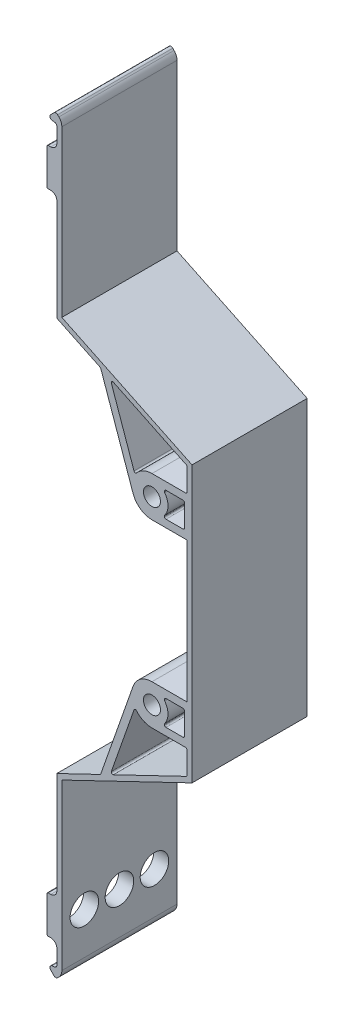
ISO-10303-21;
HEADER;
FILE_DESCRIPTION(('STEP AP214'),'2;1');
FILE_NAME('part.step','',(''),(''),'','','');
FILE_SCHEMA(('AUTOMOTIVE_DESIGN { 1 0 10303 214 1 1 1 1 }'));
ENDSEC;
DATA;
#1=APPLICATION_CONTEXT('core data for automotive mechanical design processes');
#2=APPLICATION_PROTOCOL_DEFINITION('international standard','automotive_design',2000,#1);
#3=PRODUCT_CONTEXT('',#1,'mechanical');
#4=PRODUCT('Part','Part','',(#3));
#5=PRODUCT_RELATED_PRODUCT_CATEGORY('part','',(#4));
#6=PRODUCT_DEFINITION_FORMATION('','',#4);
#7=PRODUCT_DEFINITION_CONTEXT('part definition',#1,'design');
#8=PRODUCT_DEFINITION('design','',#6,#7);
#9=PRODUCT_DEFINITION_SHAPE('','',#8);
#10=(LENGTH_UNIT() NAMED_UNIT(*) SI_UNIT(.MILLI.,.METRE.));
#11=(NAMED_UNIT(*) PLANE_ANGLE_UNIT() SI_UNIT($,.RADIAN.));
#12=(NAMED_UNIT(*) SI_UNIT($,.STERADIAN.) SOLID_ANGLE_UNIT());
#13=UNCERTAINTY_MEASURE_WITH_UNIT(LENGTH_MEASURE(1.E-05),#10,'distance_accuracy_value','');
#14=(GEOMETRIC_REPRESENTATION_CONTEXT(3) GLOBAL_UNCERTAINTY_ASSIGNED_CONTEXT((#13)) GLOBAL_UNIT_ASSIGNED_CONTEXT((#10,
#11,#12)) REPRESENTATION_CONTEXT('',''));
#15=CARTESIAN_POINT('',(0.,0.,0.));
#16=DIRECTION('',(0.,0.,1.));
#17=DIRECTION('',(1.,0.,0.));
#18=AXIS2_PLACEMENT_3D('',#15,#16,#17);
#19=CARTESIAN_POINT('',(93.9999999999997,-5.89861214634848E-13,23.));
#20=DIRECTION('',(-1.,0.,0.));
#21=DIRECTION('',(0.,-1.,0.));
#22=AXIS2_PLACEMENT_3D('',#19,#20,#21);
#23=PLANE('',#22);
#24=DIRECTION('',(0.,1.,0.));
#25=VECTOR('',#24,1.);
#26=CARTESIAN_POINT('',(93.9999999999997,-5.89861214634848E-13,0.));
#27=LINE('',#26,#25);
#28=CARTESIAN_POINT('',(94.0000000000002,69.5796236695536,0.));
#29=VERTEX_POINT('',#28);
#30=CARTESIAN_POINT('',(94.0000000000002,72.5445662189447,0.));
#31=VERTEX_POINT('',#30);
#32=EDGE_CURVE('E815',#29,#31,#27,.T.);
#33=ORIENTED_EDGE('',*,*,#32,.F.);
#34=DIRECTION('',(0.,0.,1.));
#35=VECTOR('',#34,1.);
#36=CARTESIAN_POINT('',(94.0000000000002,69.5796236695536,23.));
#37=LINE('',#36,#35);
#38=CARTESIAN_POINT('',(94.0000000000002,69.5796236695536,23.));
#39=VERTEX_POINT('',#38);
#40=EDGE_CURVE('E1144',#29,#39,#37,.T.);
#41=ORIENTED_EDGE('',*,*,#40,.T.);
#42=DIRECTION('',(0.,1.,0.));
#43=VECTOR('',#42,1.);
#44=CARTESIAN_POINT('',(93.9999999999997,-5.89861214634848E-13,23.));
#45=LINE('',#44,#43);
#46=CARTESIAN_POINT('',(94.0000000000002,72.5445662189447,23.));
#47=VERTEX_POINT('',#46);
#48=EDGE_CURVE('E709',#39,#47,#45,.T.);
#49=ORIENTED_EDGE('',*,*,#48,.T.);
#50=DIRECTION('',(0.,0.,-1.));
#51=VECTOR('',#50,1.);
#52=CARTESIAN_POINT('',(94.0000000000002,72.5445662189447,23.));
#53=LINE('',#52,#51);
#54=EDGE_CURVE('E843',#47,#31,#53,.T.);
#55=ORIENTED_EDGE('',*,*,#54,.T.);
#56=EDGE_LOOP('',(#33,#41,#49,#55));
#57=FACE_BOUND('',#56,.T.);
#58=ADVANCED_FACE('F43',(#57),#23,.T.);
#59=CARTESIAN_POINT('',(93.9999999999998,1.96620404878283E-13,23.));
#60=DIRECTION('',(1.,0.,0.));
#61=DIRECTION('',(0.,1.,0.));
#62=AXIS2_PLACEMENT_3D('',#59,#60,#61);
#63=PLANE('',#62);
#64=DIRECTION('',(0.,-1.,0.));
#65=VECTOR('',#64,1.);
#66=CARTESIAN_POINT('',(93.9999999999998,1.96620404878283E-13,0.));
#67=LINE('',#66,#65);
#68=CARTESIAN_POINT('',(93.9999999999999,-39.3712021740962,0.));
#69=VERTEX_POINT('',#68);
#70=CARTESIAN_POINT('',(94.,-59.6796236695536,0.));
#71=VERTEX_POINT('',#70);
#72=EDGE_CURVE('E764',#69,#71,#67,.T.);
#73=ORIENTED_EDGE('',*,*,#72,.T.);
#74=DIRECTION('',(0.,0.,-1.));
#75=VECTOR('',#74,1.);
#76=CARTESIAN_POINT('',(94.,-59.6796236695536,23.));
#77=LINE('',#76,#75);
#78=CARTESIAN_POINT('',(94.,-59.6796236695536,23.));
#79=VERTEX_POINT('',#78);
#80=EDGE_CURVE('E1103',#71,#79,#77,.F.);
#81=ORIENTED_EDGE('',*,*,#80,.T.);
#82=DIRECTION('',(0.,-1.,0.));
#83=VECTOR('',#82,1.);
#84=CARTESIAN_POINT('',(93.9999999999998,1.96620404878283E-13,23.));
#85=LINE('',#84,#83);
#86=CARTESIAN_POINT('',(93.9999999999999,-39.3712021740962,23.));
#87=VERTEX_POINT('',#86);
#88=EDGE_CURVE('E661',#87,#79,#85,.T.);
#89=ORIENTED_EDGE('',*,*,#88,.F.);
#90=DIRECTION('',(0.,0.,-1.));
#91=VECTOR('',#90,1.);
#92=CARTESIAN_POINT('',(93.9999999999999,-39.3712021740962,23.));
#93=LINE('',#92,#91);
#94=EDGE_CURVE('E894',#87,#69,#93,.T.);
#95=ORIENTED_EDGE('',*,*,#94,.T.);
#96=EDGE_LOOP('',(#73,#81,#89,#95));
#97=FACE_BOUND('',#96,.T.);
#98=ADVANCED_FACE('F1361',(#97),#63,.F.);
#99=CARTESIAN_POINT('',(94.,-69.5796236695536,23.));
#100=VERTEX_POINT('',#99);
#101=CARTESIAN_POINT('',(94.,-72.5445662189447,23.));
#102=VERTEX_POINT('',#101);
#103=EDGE_CURVE('E659',#100,#102,#85,.T.);
#104=ORIENTED_EDGE('',*,*,#103,.F.);
#105=DIRECTION('',(0.,0.,1.));
#106=VECTOR('',#105,1.);
#107=CARTESIAN_POINT('',(94.,-69.5796236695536,0.));
#108=LINE('',#107,#106);
#109=CARTESIAN_POINT('',(94.,-69.5796236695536,0.));
#110=VERTEX_POINT('',#109);
#111=EDGE_CURVE('E1108',#100,#110,#108,.F.);
#112=ORIENTED_EDGE('',*,*,#111,.T.);
#113=CARTESIAN_POINT('',(94.,-72.5445662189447,0.));
#114=VERTEX_POINT('',#113);
#115=EDGE_CURVE('E762',#110,#114,#67,.T.);
#116=ORIENTED_EDGE('',*,*,#115,.T.);
#117=DIRECTION('',(0.,0.,-1.));
#118=VECTOR('',#117,1.);
#119=CARTESIAN_POINT('',(94.,-72.5445662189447,23.));
#120=LINE('',#119,#118);
#121=EDGE_CURVE('E891',#102,#114,#120,.T.);
#122=ORIENTED_EDGE('',*,*,#121,.F.);
#123=EDGE_LOOP('',(#104,#112,#116,#122));
#124=FACE_BOUND('',#123,.T.);
#125=ADVANCED_FACE('F1368',(#124),#63,.F.);
#126=CARTESIAN_POINT('',(0.,0.,23.));
#127=DIRECTION('',(0.,0.,1.));
#128=DIRECTION('',(1.,0.,0.));
#129=AXIS2_PLACEMENT_3D('',#126,#127,#128);
#130=PLANE('',#129);
#131=DIRECTION('',(1.,0.,0.));
#132=VECTOR('',#131,1.);
#133=CARTESIAN_POINT('',(0.,15.5000000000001,23.));
#134=LINE('',#133,#132);
#135=CARTESIAN_POINT('',(115.8,15.5000000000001,23.));
#136=VERTEX_POINT('',#135);
#137=CARTESIAN_POINT('',(119.2,15.5000000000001,23.));
#138=VERTEX_POINT('',#137);
#139=EDGE_CURVE('E1254',#136,#138,#134,.T.);
#140=ORIENTED_EDGE('',*,*,#139,.F.);
#141=CARTESIAN_POINT('',(115.8,15.8000000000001,23.));
#142=DIRECTION('',(0.,0.,1.));
#143=DIRECTION('',(1.,0.,0.));
#144=AXIS2_PLACEMENT_3D('',#141,#142,#143);
#145=CIRCLE('',#144,0.3);
#146=CARTESIAN_POINT('',(115.5,15.8000000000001,23.));
#147=VERTEX_POINT('',#146);
#148=EDGE_CURVE('E1076',#136,#147,#145,.F.);
#149=ORIENTED_EDGE('',*,*,#148,.T.);
#150=DIRECTION('',(0.,1.,0.));
#151=VECTOR('',#150,1.);
#152=CARTESIAN_POINT('',(115.5,0.,23.));
#153=LINE('',#152,#151);
#154=CARTESIAN_POINT('',(115.5,15.9000000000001,23.));
#155=VERTEX_POINT('',#154);
#156=EDGE_CURVE('E1249',#147,#155,#153,.T.);
#157=ORIENTED_EDGE('',*,*,#156,.T.);
#158=CARTESIAN_POINT('',(115.8,15.9000000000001,23.));
#159=DIRECTION('',(0.,0.,1.));
#160=DIRECTION('',(1.,0.,0.));
#161=AXIS2_PLACEMENT_3D('',#158,#159,#160);
#162=CIRCLE('',#161,0.3);
#163=CARTESIAN_POINT('',(115.56,16.0800000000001,23.));
#164=VERTEX_POINT('',#163);
#165=EDGE_CURVE('E1060',#155,#164,#162,.F.);
#166=ORIENTED_EDGE('',*,*,#165,.T.);
#167=CARTESIAN_POINT('',(113.,18.0000000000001,23.));
#168=DIRECTION('',(0.,0.,1.));
#169=DIRECTION('',(1.,0.,0.));
#170=AXIS2_PLACEMENT_3D('',#167,#168,#169);
#171=CIRCLE('',#170,3.2);
#172=CARTESIAN_POINT('',(115.56,19.9200000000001,23.));
#173=VERTEX_POINT('',#172);
#174=EDGE_CURVE('E1246',#164,#173,#171,.T.);
#175=ORIENTED_EDGE('',*,*,#174,.T.);
#176=CARTESIAN_POINT('',(115.8,20.1000000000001,23.));
#177=DIRECTION('',(0.,0.,1.));
#178=DIRECTION('',(1.,0.,0.));
#179=AXIS2_PLACEMENT_3D('',#176,#177,#178);
#180=CIRCLE('',#179,0.3);
#181=CARTESIAN_POINT('',(115.5,20.1000000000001,23.));
#182=VERTEX_POINT('',#181);
#183=EDGE_CURVE('E1064',#173,#182,#180,.F.);
#184=ORIENTED_EDGE('',*,*,#183,.T.);
#185=CARTESIAN_POINT('',(115.5,20.2000000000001,23.));
#186=VERTEX_POINT('',#185);
#187=EDGE_CURVE('E1250',#182,#186,#153,.T.);
#188=ORIENTED_EDGE('',*,*,#187,.T.);
#189=CARTESIAN_POINT('',(115.8,20.2000000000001,23.));
#190=DIRECTION('',(0.,0.,1.));
#191=DIRECTION('',(1.,0.,0.));
#192=AXIS2_PLACEMENT_3D('',#189,#190,#191);
#193=CIRCLE('',#192,0.3);
#194=CARTESIAN_POINT('',(115.8,20.5000000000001,23.));
#195=VERTEX_POINT('',#194);
#196=EDGE_CURVE('E1068',#186,#195,#193,.F.);
#197=ORIENTED_EDGE('',*,*,#196,.T.);
#198=DIRECTION('',(1.,0.,0.));
#199=VECTOR('',#198,1.);
#200=CARTESIAN_POINT('',(0.,20.5000000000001,23.));
#201=LINE('',#200,#199);
#202=CARTESIAN_POINT('',(119.2,20.5000000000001,23.));
#203=VERTEX_POINT('',#202);
#204=EDGE_CURVE('E1253',#195,#203,#201,.T.);
#205=ORIENTED_EDGE('',*,*,#204,.T.);
#206=CARTESIAN_POINT('',(119.2,20.2000000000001,23.));
#207=DIRECTION('',(0.,0.,1.));
#208=DIRECTION('',(1.,0.,0.));
#209=AXIS2_PLACEMENT_3D('',#206,#207,#208);
#210=CIRCLE('',#209,0.3);
#211=CARTESIAN_POINT('',(119.5,20.2000000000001,23.));
#212=VERTEX_POINT('',#211);
#213=EDGE_CURVE('E1080',#203,#212,#210,.F.);
#214=ORIENTED_EDGE('',*,*,#213,.T.);
#215=DIRECTION('',(0.,1.,0.));
#216=VECTOR('',#215,1.);
#217=CARTESIAN_POINT('',(119.5,0.,23.));
#218=LINE('',#217,#216);
#219=CARTESIAN_POINT('',(119.5,15.8000000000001,23.));
#220=VERTEX_POINT('',#219);
#221=EDGE_CURVE('E1257',#220,#212,#218,.T.);
#222=ORIENTED_EDGE('',*,*,#221,.F.);
#223=CARTESIAN_POINT('',(119.2,15.8000000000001,23.));
#224=DIRECTION('',(0.,0.,1.));
#225=DIRECTION('',(1.,0.,0.));
#226=AXIS2_PLACEMENT_3D('',#223,#224,#225);
#227=CIRCLE('',#226,0.3);
#228=EDGE_CURVE('E1072',#220,#138,#227,.F.);
#229=ORIENTED_EDGE('',*,*,#228,.T.);
#230=EDGE_LOOP('',(#140,#149,#157,#166,#175,#184,#188,#197,#205,#214,#222,#229));
#231=FACE_BOUND('',#230,.T.);
#232=CARTESIAN_POINT('',(113.,18.0000000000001,23.));
#233=DIRECTION('',(0.,0.,1.));
#234=DIRECTION('',(1.,0.,0.));
#235=AXIS2_PLACEMENT_3D('',#232,#233,#234);
#236=CIRCLE('',#235,1.7);
#237=CARTESIAN_POINT('',(114.7,18.0000000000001,23.));
#238=VERTEX_POINT('',#237);
#239=EDGE_CURVE('E732',#238,#238,#236,.T.);
#240=ORIENTED_EDGE('',*,*,#239,.F.);
#241=EDGE_LOOP('',(#240));
#242=FACE_BOUND('',#241,.T.);
#243=CARTESIAN_POINT('',(113.,-18.0000000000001,23.));
#244=DIRECTION('',(0.,0.,1.));
#245=DIRECTION('',(1.,0.,0.));
#246=AXIS2_PLACEMENT_3D('',#243,#244,#245);
#247=CIRCLE('',#246,1.7);
#248=CARTESIAN_POINT('',(114.7,-18.0000000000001,23.));
#249=VERTEX_POINT('',#248);
#250=EDGE_CURVE('E729',#249,#249,#247,.F.);
#251=ORIENTED_EDGE('',*,*,#250,.T.);
#252=EDGE_LOOP('',(#251));
#253=FACE_BOUND('',#252,.T.);
#254=CARTESIAN_POINT('',(113.,18.0000000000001,23.));
#255=DIRECTION('',(0.,0.,1.));
#256=DIRECTION('',(1.,0.,0.));
#257=AXIS2_PLACEMENT_3D('',#254,#255,#256);
#258=CIRCLE('',#257,4.00000000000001);
#259=CARTESIAN_POINT('',(113.,22.0000000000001,23.));
#260=VERTEX_POINT('',#259);
#261=CARTESIAN_POINT('',(109.931540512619,20.5660390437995,23.));
#262=VERTEX_POINT('',#261);
#263=EDGE_CURVE('E624',#260,#262,#258,.T.);
#264=ORIENTED_EDGE('',*,*,#263,.T.);
#265=CARTESIAN_POINT('',(109.701406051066,20.7584919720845,23.));
#266=DIRECTION('',(0.,0.,1.));
#267=DIRECTION('',(1.,0.,0.));
#268=AXIS2_PLACEMENT_3D('',#265,#266,#267);
#269=CIRCLE('',#268,0.3);
#270=CARTESIAN_POINT('',(109.418305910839,20.6592230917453,23.));
#271=VERTEX_POINT('',#270);
#272=EDGE_CURVE('E1090',#262,#271,#269,.F.);
#273=ORIENTED_EDGE('',*,*,#272,.T.);
#274=DIRECTION('',(-0.330896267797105,0.943667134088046,0.));
#275=VECTOR('',#274,1.);
#276=CARTESIAN_POINT('',(103.888804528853,36.4285418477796,23.));
#277=LINE('',#276,#275);
#278=CARTESIAN_POINT('',(104.892488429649,33.5661840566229,23.));
#279=VERTEX_POINT('',#278);
#280=EDGE_CURVE('E717',#271,#279,#277,.T.);
#281=ORIENTED_EDGE('',*,*,#280,.T.);
#282=CARTESIAN_POINT('',(105.175588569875,33.665452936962,23.));
#283=DIRECTION('',(0.,0.,1.));
#284=DIRECTION('',(1.,0.,0.));
#285=AXIS2_PLACEMENT_3D('',#282,#283,#284);
#286=CIRCLE('',#285,0.3);
#287=CARTESIAN_POINT('',(105.305576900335,33.9358286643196,23.));
#288=VERTEX_POINT('',#287);
#289=EDGE_CURVE('E1098',#279,#288,#286,.F.);
#290=ORIENTED_EDGE('',*,*,#289,.T.);
#291=DIRECTION('',(-0.901252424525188,0.433294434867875,0.));
#292=VECTOR('',#291,1.);
#293=CARTESIAN_POINT('',(33.0226983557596,68.6872125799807,23.));
#294=LINE('',#293,#292);
#295=CARTESIAN_POINT('',(119.829988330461,26.9529385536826,23.));
#296=VERTEX_POINT('',#295);
#297=EDGE_CURVE('E714',#296,#288,#294,.T.);
#298=ORIENTED_EDGE('',*,*,#297,.F.);
#299=CARTESIAN_POINT('',(119.7,26.682562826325,23.));
#300=DIRECTION('',(0.,0.,1.));
#301=DIRECTION('',(1.,0.,0.));
#302=AXIS2_PLACEMENT_3D('',#299,#300,#301);
#303=CIRCLE('',#302,0.3);
#304=CARTESIAN_POINT('',(120.,26.682562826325,23.));
#305=VERTEX_POINT('',#304);
#306=EDGE_CURVE('E1094',#296,#305,#303,.F.);
#307=ORIENTED_EDGE('',*,*,#306,.T.);
#308=DIRECTION('',(0.,1.,0.));
#309=VECTOR('',#308,1.);
#310=CARTESIAN_POINT('',(120.,0.,23.));
#311=LINE('',#310,#309);
#312=CARTESIAN_POINT('',(120.,22.3000000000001,23.));
#313=VERTEX_POINT('',#312);
#314=EDGE_CURVE('E645',#313,#305,#311,.T.);
#315=ORIENTED_EDGE('',*,*,#314,.F.);
#316=CARTESIAN_POINT('',(119.7,22.3000000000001,23.));
#317=DIRECTION('',(0.,0.,1.));
#318=DIRECTION('',(1.,0.,0.));
#319=AXIS2_PLACEMENT_3D('',#316,#317,#318);
#320=CIRCLE('',#319,0.3);
#321=CARTESIAN_POINT('',(119.7,22.0000000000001,23.));
#322=VERTEX_POINT('',#321);
#323=EDGE_CURVE('E1086',#313,#322,#320,.F.);
#324=ORIENTED_EDGE('',*,*,#323,.T.);
#325=DIRECTION('',(1.,0.,0.));
#326=VECTOR('',#325,1.);
#327=CARTESIAN_POINT('',(0.,22.0000000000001,23.));
#328=LINE('',#327,#326);
#329=EDGE_CURVE('E726',#260,#322,#328,.T.);
#330=ORIENTED_EDGE('',*,*,#329,.F.);
#331=EDGE_LOOP('',(#264,#273,#281,#290,#298,#307,#315,#324,#330));
#332=FACE_BOUND('',#331,.T.);
#333=CARTESIAN_POINT('',(113.,-18.0000000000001,23.));
#334=DIRECTION('',(0.,0.,1.));
#335=DIRECTION('',(1.,0.,0.));
#336=AXIS2_PLACEMENT_3D('',#333,#334,#335);
#337=CIRCLE('',#336,4.00000000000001);
#338=CARTESIAN_POINT('',(113.,-22.0000000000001,23.));
#339=VERTEX_POINT('',#338);
#340=CARTESIAN_POINT('',(109.931540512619,-20.5660390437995,23.));
#341=VERTEX_POINT('',#340);
#342=EDGE_CURVE('E653',#339,#341,#337,.F.);
#343=ORIENTED_EDGE('',*,*,#342,.F.);
#344=DIRECTION('',(1.,0.,0.));
#345=VECTOR('',#344,1.);
#346=CARTESIAN_POINT('',(0.,-21.9999999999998,23.));
#347=LINE('',#346,#345);
#348=CARTESIAN_POINT('',(119.7,-22.0000000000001,23.));
#349=VERTEX_POINT('',#348);
#350=EDGE_CURVE('E718',#339,#349,#347,.T.);
#351=ORIENTED_EDGE('',*,*,#350,.T.);
#352=CARTESIAN_POINT('',(119.7,-22.3000000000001,23.));
#353=DIRECTION('',(0.,0.,1.));
#354=DIRECTION('',(1.,0.,0.));
#355=AXIS2_PLACEMENT_3D('',#352,#353,#354);
#356=CIRCLE('',#355,0.3);
#357=CARTESIAN_POINT('',(120.,-22.3000000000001,23.));
#358=VERTEX_POINT('',#357);
#359=EDGE_CURVE('E1054',#349,#358,#356,.F.);
#360=ORIENTED_EDGE('',*,*,#359,.T.);
#361=CARTESIAN_POINT('',(120.,-26.6825628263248,23.));
#362=VERTEX_POINT('',#361);
#363=EDGE_CURVE('E646',#362,#358,#311,.T.);
#364=ORIENTED_EDGE('',*,*,#363,.F.);
#365=CARTESIAN_POINT('',(119.7,-26.6825628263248,23.));
#366=DIRECTION('',(0.,0.,1.));
#367=DIRECTION('',(1.,0.,0.));
#368=AXIS2_PLACEMENT_3D('',#365,#366,#367);
#369=CIRCLE('',#368,0.3);
#370=CARTESIAN_POINT('',(119.829988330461,-26.9529385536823,23.));
#371=VERTEX_POINT('',#370);
#372=EDGE_CURVE('E1058',#362,#371,#369,.F.);
#373=ORIENTED_EDGE('',*,*,#372,.T.);
#374=DIRECTION('',(0.901252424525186,0.433294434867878,0.));
#375=VECTOR('',#374,1.);
#376=CARTESIAN_POINT('',(33.0226983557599,-68.6872125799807,23.));
#377=LINE('',#376,#375);
#378=CARTESIAN_POINT('',(105.305576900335,-33.9358286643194,23.));
#379=VERTEX_POINT('',#378);
#380=EDGE_CURVE('E660',#379,#371,#377,.T.);
#381=ORIENTED_EDGE('',*,*,#380,.F.);
#382=CARTESIAN_POINT('',(105.175588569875,-33.6654529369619,23.));
#383=DIRECTION('',(0.,0.,1.));
#384=DIRECTION('',(1.,0.,0.));
#385=AXIS2_PLACEMENT_3D('',#382,#383,#384);
#386=CIRCLE('',#385,0.3);
#387=CARTESIAN_POINT('',(104.892488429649,-33.5661840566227,23.));
#388=VERTEX_POINT('',#387);
#389=EDGE_CURVE('E1050',#379,#388,#386,.F.);
#390=ORIENTED_EDGE('',*,*,#389,.T.);
#391=DIRECTION('',(-0.330896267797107,-0.943667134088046,0.));
#392=VECTOR('',#391,1.);
#393=CARTESIAN_POINT('',(103.888804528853,-36.4285418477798,23.));
#394=LINE('',#393,#392);
#395=CARTESIAN_POINT('',(109.418305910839,-20.6592230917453,23.));
#396=VERTEX_POINT('',#395);
#397=EDGE_CURVE('E721',#396,#388,#394,.T.);
#398=ORIENTED_EDGE('',*,*,#397,.F.);
#399=CARTESIAN_POINT('',(109.701406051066,-20.7584919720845,23.));
#400=DIRECTION('',(0.,0.,1.));
#401=DIRECTION('',(1.,0.,0.));
#402=AXIS2_PLACEMENT_3D('',#399,#400,#401);
#403=CIRCLE('',#402,0.3);
#404=EDGE_CURVE('E1046',#396,#341,#403,.F.);
#405=ORIENTED_EDGE('',*,*,#404,.T.);
#406=EDGE_LOOP('',(#343,#351,#360,#364,#373,#381,#390,#398,#405));
#407=FACE_BOUND('',#406,.T.);
#408=DIRECTION('',(1.,0.,0.));
#409=VECTOR('',#408,1.);
#410=CARTESIAN_POINT('',(91.9999999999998,68.3796236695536,23.));
#411=LINE('',#410,#409);
#412=CARTESIAN_POINT('',(92.2999999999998,68.3796236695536,23.));
#413=VERTEX_POINT('',#412);
#414=CARTESIAN_POINT('',(92.8000000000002,68.3796236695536,23.));
#415=VERTEX_POINT('',#414);
#416=EDGE_CURVE('E1183',#413,#415,#411,.T.);
#417=ORIENTED_EDGE('',*,*,#416,.F.);
#418=CARTESIAN_POINT('',(92.2999999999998,68.0796236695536,23.));
#419=DIRECTION('',(0.,0.,1.));
#420=DIRECTION('',(1.,0.,0.));
#421=AXIS2_PLACEMENT_3D('',#418,#419,#420);
#422=CIRCLE('',#421,0.3);
#423=CARTESIAN_POINT('',(91.9999999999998,68.0796236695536,23.));
#424=VERTEX_POINT('',#423);
#425=EDGE_CURVE('E1165',#413,#424,#422,.T.);
#426=ORIENTED_EDGE('',*,*,#425,.T.);
#427=DIRECTION('',(0.,-1.,0.));
#428=VECTOR('',#427,1.);
#429=CARTESIAN_POINT('',(91.9999999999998,68.3796236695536,23.));
#430=LINE('',#429,#428);
#431=CARTESIAN_POINT('',(91.9999999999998,61.1796236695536,23.));
#432=VERTEX_POINT('',#431);
#433=EDGE_CURVE('E1188',#424,#432,#430,.T.);
#434=ORIENTED_EDGE('',*,*,#433,.T.);
#435=CARTESIAN_POINT('',(92.2999999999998,61.1796236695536,23.));
#436=DIRECTION('',(0.,0.,1.));
#437=DIRECTION('',(1.,0.,0.));
#438=AXIS2_PLACEMENT_3D('',#435,#436,#437);
#439=CIRCLE('',#438,0.3);
#440=CARTESIAN_POINT('',(92.2999999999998,60.8796236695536,23.));
#441=VERTEX_POINT('',#440);
#442=EDGE_CURVE('E1163',#432,#441,#439,.T.);
#443=ORIENTED_EDGE('',*,*,#442,.T.);
#444=DIRECTION('',(1.,0.,0.));
#445=VECTOR('',#444,1.);
#446=CARTESIAN_POINT('',(91.9999999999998,60.8796236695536,23.));
#447=LINE('',#446,#445);
#448=CARTESIAN_POINT('',(92.8000000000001,60.8796236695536,23.));
#449=VERTEX_POINT('',#448);
#450=EDGE_CURVE('E1192',#441,#449,#447,.T.);
#451=ORIENTED_EDGE('',*,*,#450,.T.);
#452=CARTESIAN_POINT('',(92.8000000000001,59.6796236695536,23.));
#453=DIRECTION('',(0.,0.,1.));
#454=DIRECTION('',(1.,0.,0.));
#455=AXIS2_PLACEMENT_3D('',#452,#453,#454);
#456=CIRCLE('',#455,1.2);
#457=CARTESIAN_POINT('',(94.0000000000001,59.6796236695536,23.));
#458=VERTEX_POINT('',#457);
#459=EDGE_CURVE('E1153',#449,#458,#456,.F.);
#460=ORIENTED_EDGE('',*,*,#459,.T.);
#461=CARTESIAN_POINT('',(94.,39.3712021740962,23.));
#462=VERTEX_POINT('',#461);
#463=EDGE_CURVE('E710',#462,#458,#45,.T.);
#464=ORIENTED_EDGE('',*,*,#463,.F.);
#465=CARTESIAN_POINT('',(102.628993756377,35.2226474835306,23.));
#466=VERTEX_POINT('',#465);
#467=EDGE_CURVE('E713',#466,#462,#294,.T.);
#468=ORIENTED_EDGE('',*,*,#467,.F.);
#469=CARTESIAN_POINT('',(102.499005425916,34.952271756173,23.));
#470=DIRECTION('',(0.,0.,1.));
#471=DIRECTION('',(1.,0.,0.));
#472=AXIS2_PLACEMENT_3D('',#469,#470,#471);
#473=CIRCLE('',#472,0.3);
#474=CARTESIAN_POINT('',(102.782105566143,35.0515406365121,23.));
#475=VERTEX_POINT('',#474);
#476=EDGE_CURVE('E630',#466,#475,#473,.F.);
#477=ORIENTED_EDGE('',*,*,#476,.T.);
#478=DIRECTION('',(-0.330896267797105,0.943667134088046,0.));
#479=VECTOR('',#478,1.);
#480=CARTESIAN_POINT('',(102.473303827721,35.9321974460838,23.));
#481=LINE('',#480,#479);
#482=CARTESIAN_POINT('',(109.225331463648,16.6764149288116,23.));
#483=VERTEX_POINT('',#482);
#484=EDGE_CURVE('E607',#483,#475,#481,.T.);
#485=ORIENTED_EDGE('',*,*,#484,.F.);
#486=CARTESIAN_POINT('',(113.,14.0000000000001,23.));
#487=VERTEX_POINT('',#486);
#488=EDGE_CURVE('E617',#483,#487,#258,.T.);
#489=ORIENTED_EDGE('',*,*,#488,.T.);
#490=DIRECTION('',(1.,0.,0.));
#491=VECTOR('',#490,1.);
#492=CARTESIAN_POINT('',(0.,14.,23.));
#493=LINE('',#492,#491);
#494=CARTESIAN_POINT('',(120.,14.0000000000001,23.));
#495=VERTEX_POINT('',#494);
#496=EDGE_CURVE('E622',#487,#495,#493,.T.);
#497=ORIENTED_EDGE('',*,*,#496,.T.);
#498=CARTESIAN_POINT('',(120.,-14.0000000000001,23.));
#499=VERTEX_POINT('',#498);
#500=EDGE_CURVE('E641',#499,#495,#311,.T.);
#501=ORIENTED_EDGE('',*,*,#500,.F.);
#502=DIRECTION('',(1.,0.,0.));
#503=VECTOR('',#502,1.);
#504=CARTESIAN_POINT('',(0.,-13.9999999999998,23.));
#505=LINE('',#504,#503);
#506=CARTESIAN_POINT('',(113.,-14.0000000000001,23.));
#507=VERTEX_POINT('',#506);
#508=EDGE_CURVE('E644',#507,#499,#505,.T.);
#509=ORIENTED_EDGE('',*,*,#508,.F.);
#510=CARTESIAN_POINT('',(109.225331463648,-16.6764149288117,23.));
#511=VERTEX_POINT('',#510);
#512=EDGE_CURVE('E649',#511,#507,#337,.F.);
#513=ORIENTED_EDGE('',*,*,#512,.F.);
#514=DIRECTION('',(-0.330896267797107,-0.943667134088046,0.));
#515=VECTOR('',#514,1.);
#516=CARTESIAN_POINT('',(102.473303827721,-35.932197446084,23.));
#517=LINE('',#516,#515);
#518=CARTESIAN_POINT('',(102.782105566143,-35.0515406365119,23.));
#519=VERTEX_POINT('',#518);
#520=EDGE_CURVE('E652',#511,#519,#517,.T.);
#521=ORIENTED_EDGE('',*,*,#520,.T.);
#522=CARTESIAN_POINT('',(102.499005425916,-34.9522717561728,23.));
#523=DIRECTION('',(0.,0.,1.));
#524=DIRECTION('',(1.,0.,0.));
#525=AXIS2_PLACEMENT_3D('',#522,#523,#524);
#526=CIRCLE('',#525,0.3);
#527=CARTESIAN_POINT('',(102.628993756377,-35.2226474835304,23.));
#528=VERTEX_POINT('',#527);
#529=EDGE_CURVE('E1015',#519,#528,#526,.F.);
#530=ORIENTED_EDGE('',*,*,#529,.T.);
#531=EDGE_CURVE('E656',#87,#528,#377,.T.);
#532=ORIENTED_EDGE('',*,*,#531,.F.);
#533=ORIENTED_EDGE('',*,*,#88,.T.);
#534=CARTESIAN_POINT('',(92.8,-59.6796236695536,23.));
#535=DIRECTION('',(0.,0.,1.));
#536=DIRECTION('',(1.,0.,0.));
#537=AXIS2_PLACEMENT_3D('',#534,#535,#536);
#538=CIRCLE('',#537,1.2);
#539=CARTESIAN_POINT('',(92.8,-60.8796236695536,23.));
#540=VERTEX_POINT('',#539);
#541=EDGE_CURVE('E1112',#79,#540,#538,.F.);
#542=ORIENTED_EDGE('',*,*,#541,.T.);
#543=DIRECTION('',(1.,0.,0.));
#544=VECTOR('',#543,1.);
#545=CARTESIAN_POINT('',(91.9999999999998,-60.8796236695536,23.));
#546=LINE('',#545,#544);
#547=CARTESIAN_POINT('',(92.2999999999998,-60.8796236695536,23.));
#548=VERTEX_POINT('',#547);
#549=EDGE_CURVE('E1219',#548,#540,#546,.T.);
#550=ORIENTED_EDGE('',*,*,#549,.F.);
#551=CARTESIAN_POINT('',(92.2999999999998,-61.1796236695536,23.));
#552=DIRECTION('',(0.,0.,1.));
#553=DIRECTION('',(1.,0.,0.));
#554=AXIS2_PLACEMENT_3D('',#551,#552,#553);
#555=CIRCLE('',#554,0.3);
#556=CARTESIAN_POINT('',(91.9999999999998,-61.1796236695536,23.));
#557=VERTEX_POINT('',#556);
#558=EDGE_CURVE('E1134',#548,#557,#555,.T.);
#559=ORIENTED_EDGE('',*,*,#558,.T.);
#560=DIRECTION('',(0.,1.,0.));
#561=VECTOR('',#560,1.);
#562=CARTESIAN_POINT('',(91.9999999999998,-68.3796236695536,23.));
#563=LINE('',#562,#561);
#564=CARTESIAN_POINT('',(91.9999999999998,-68.0796236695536,23.));
#565=VERTEX_POINT('',#564);
#566=EDGE_CURVE('E1207',#565,#557,#563,.T.);
#567=ORIENTED_EDGE('',*,*,#566,.F.);
#568=CARTESIAN_POINT('',(92.2999999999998,-68.0796236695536,23.));
#569=DIRECTION('',(0.,0.,1.));
#570=DIRECTION('',(1.,0.,0.));
#571=AXIS2_PLACEMENT_3D('',#568,#569,#570);
#572=CIRCLE('',#571,0.3);
#573=CARTESIAN_POINT('',(92.2999999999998,-68.3796236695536,23.));
#574=VERTEX_POINT('',#573);
#575=EDGE_CURVE('E1132',#565,#574,#572,.T.);
#576=ORIENTED_EDGE('',*,*,#575,.T.);
#577=DIRECTION('',(1.,0.,0.));
#578=VECTOR('',#577,1.);
#579=CARTESIAN_POINT('',(91.9999999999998,-68.3796236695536,23.));
#580=LINE('',#579,#578);
#581=CARTESIAN_POINT('',(92.8,-68.3796236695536,23.));
#582=VERTEX_POINT('',#581);
#583=EDGE_CURVE('E1213',#574,#582,#580,.T.);
#584=ORIENTED_EDGE('',*,*,#583,.T.);
#585=CARTESIAN_POINT('',(92.8,-69.5796236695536,23.));
#586=DIRECTION('',(0.,0.,1.));
#587=DIRECTION('',(1.,0.,0.));
#588=AXIS2_PLACEMENT_3D('',#585,#586,#587);
#589=CIRCLE('',#588,1.2);
#590=EDGE_CURVE('E1115',#582,#100,#589,.F.);
#591=ORIENTED_EDGE('',*,*,#590,.T.);
#592=ORIENTED_EDGE('',*,*,#103,.T.);
#593=CARTESIAN_POINT('',(93.5,-72.5445662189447,23.));
#594=DIRECTION('',(0.,0.,1.));
#595=DIRECTION('',(1.,0.,0.));
#596=AXIS2_PLACEMENT_3D('',#593,#594,#595);
#597=CIRCLE('',#596,0.499999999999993);
#598=CARTESIAN_POINT('',(93.5609346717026,-73.0408392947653,23.));
#599=VERTEX_POINT('',#598);
#600=EDGE_CURVE('E664',#102,#599,#597,.F.);
#601=ORIENTED_EDGE('',*,*,#600,.T.);
#602=DIRECTION('',(-0.992546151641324,-0.121869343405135,0.));
#603=VECTOR('',#602,1.);
#604=CARTESIAN_POINT('',(10.2246689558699,-83.2732460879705,23.));
#605=LINE('',#604,#603);
#606=CARTESIAN_POINT('',(93.0646615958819,-73.1017739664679,23.));
#607=VERTEX_POINT('',#606);
#608=EDGE_CURVE('E666',#599,#607,#605,.T.);
#609=ORIENTED_EDGE('',*,*,#608,.T.);
#610=CARTESIAN_POINT('',(93.1255962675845,-73.5980470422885,23.));
#611=DIRECTION('',(0.,0.,1.));
#612=DIRECTION('',(1.,0.,0.));
#613=AXIS2_PLACEMENT_3D('',#610,#611,#612);
#614=CIRCLE('',#613,0.500000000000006);
#615=CARTESIAN_POINT('',(92.7720428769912,-73.9516004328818,23.));
#616=VERTEX_POINT('',#615);
#617=EDGE_CURVE('E668',#607,#616,#614,.T.);
#618=ORIENTED_EDGE('',*,*,#617,.T.);
#619=DIRECTION('',(-0.707106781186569,0.707106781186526,0.));
#620=VECTOR('',#619,1.);
#621=CARTESIAN_POINT('',(9.41022122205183,9.41022122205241,23.));
#622=LINE('',#621,#620);
#623=CARTESIAN_POINT('',(93.4500661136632,-74.6296236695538,23.));
#624=VERTEX_POINT('',#623);
#625=EDGE_CURVE('E670',#624,#616,#622,.T.);
#626=ORIENTED_EDGE('',*,*,#625,.F.);
#627=CARTESIAN_POINT('',(93.8036195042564,-74.2760702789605,23.));
#628=DIRECTION('',(0.,0.,1.));
#629=DIRECTION('',(1.,0.,0.));
#630=AXIS2_PLACEMENT_3D('',#627,#628,#629);
#631=CIRCLE('',#630,0.499999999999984);
#632=CARTESIAN_POINT('',(94.1571728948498,-74.6296236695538,23.));
#633=VERTEX_POINT('',#632);
#634=EDGE_CURVE('E673',#633,#624,#631,.F.);
#635=ORIENTED_EDGE('',*,*,#634,.F.);
#636=DIRECTION('',(-0.707106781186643,-0.707106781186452,0.));
#637=VECTOR('',#636,1.);
#638=CARTESIAN_POINT('',(84.3933982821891,-84.3933982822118,23.));
#639=LINE('',#638,#637);
#640=CARTESIAN_POINT('',(94.4142135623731,-74.3725830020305,23.));
#641=VERTEX_POINT('',#640);
#642=EDGE_CURVE('E676',#641,#633,#639,.T.);
#643=ORIENTED_EDGE('',*,*,#642,.F.);
#644=CARTESIAN_POINT('',(93.,-72.9583694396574,23.));
#645=DIRECTION('',(0.,0.,1.));
#646=DIRECTION('',(1.,0.,0.));
#647=AXIS2_PLACEMENT_3D('',#644,#645,#646);
#648=CIRCLE('',#647,1.99999999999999);
#649=CARTESIAN_POINT('',(95.,-72.9583694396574,23.));
#650=VERTEX_POINT('',#649);
#651=EDGE_CURVE('E679',#641,#650,#648,.T.);
#652=ORIENTED_EDGE('',*,*,#651,.T.);
#653=DIRECTION('',(0.,1.,0.));
#654=VECTOR('',#653,1.);
#655=CARTESIAN_POINT('',(95.0000000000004,-5.20021719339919E-13,23.));
#656=LINE('',#655,#654);
#657=CARTESIAN_POINT('',(95.0000000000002,-39.9999999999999,23.));
#658=VERTEX_POINT('',#657);
#659=EDGE_CURVE('E681',#650,#658,#656,.T.);
#660=ORIENTED_EDGE('',*,*,#659,.T.);
#661=DIRECTION('',(0.901252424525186,0.433294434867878,0.));
#662=VECTOR('',#661,1.);
#663=CARTESIAN_POINT('',(33.4559927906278,-69.5884650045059,23.));
#664=LINE('',#663,#662);
#665=CARTESIAN_POINT('',(121.,-27.4999999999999,23.));
#666=VERTEX_POINT('',#665);
#667=EDGE_CURVE('E683',#658,#666,#664,.T.);
#668=ORIENTED_EDGE('',*,*,#667,.T.);
#669=DIRECTION('',(0.,1.,0.));
#670=VECTOR('',#669,1.);
#671=CARTESIAN_POINT('',(121.,0.,23.));
#672=LINE('',#671,#670);
#673=CARTESIAN_POINT('',(121.,27.5000000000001,23.));
#674=VERTEX_POINT('',#673);
#675=EDGE_CURVE('E685',#666,#674,#672,.T.);
#676=ORIENTED_EDGE('',*,*,#675,.T.);
#677=DIRECTION('',(-0.901252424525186,0.433294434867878,0.));
#678=VECTOR('',#677,1.);
#679=CARTESIAN_POINT('',(33.4559927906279,69.588465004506,23.));
#680=LINE('',#679,#678);
#681=CARTESIAN_POINT('',(95.0000000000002,40.0000000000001,23.));
#682=VERTEX_POINT('',#681);
#683=EDGE_CURVE('E687',#674,#682,#680,.T.);
#684=ORIENTED_EDGE('',*,*,#683,.T.);
#685=DIRECTION('',(0.,1.,0.));
#686=VECTOR('',#685,1.);
#687=CARTESIAN_POINT('',(95.0000000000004,5.20021719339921E-13,23.));
#688=LINE('',#687,#686);
#689=CARTESIAN_POINT('',(95.,72.9583694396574,23.));
#690=VERTEX_POINT('',#689);
#691=EDGE_CURVE('E689',#682,#690,#688,.T.);
#692=ORIENTED_EDGE('',*,*,#691,.T.);
#693=CARTESIAN_POINT('',(93.0000000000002,72.9583694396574,23.));
#694=DIRECTION('',(0.,0.,1.));
#695=DIRECTION('',(1.,0.,0.));
#696=AXIS2_PLACEMENT_3D('',#693,#694,#695);
#697=CIRCLE('',#696,1.9999999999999);
#698=CARTESIAN_POINT('',(94.4142135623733,74.3725830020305,23.));
#699=VERTEX_POINT('',#698);
#700=EDGE_CURVE('E691',#699,#690,#697,.F.);
#701=ORIENTED_EDGE('',*,*,#700,.F.);
#702=DIRECTION('',(-0.707106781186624,0.707106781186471,0.));
#703=VECTOR('',#702,1.);
#704=CARTESIAN_POINT('',(84.3933982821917,84.3933982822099,23.));
#705=LINE('',#704,#703);
#706=CARTESIAN_POINT('',(94.1571728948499,74.6296236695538,23.));
#707=VERTEX_POINT('',#706);
#708=EDGE_CURVE('E694',#699,#707,#705,.T.);
#709=ORIENTED_EDGE('',*,*,#708,.T.);
#710=CARTESIAN_POINT('',(93.8036195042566,74.2760702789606,23.));
#711=DIRECTION('',(0.,0.,1.));
#712=DIRECTION('',(1.,0.,0.));
#713=AXIS2_PLACEMENT_3D('',#710,#711,#712);
#714=CIRCLE('',#713,0.499999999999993);
#715=CARTESIAN_POINT('',(93.4500661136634,74.6296236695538,23.));
#716=VERTEX_POINT('',#715);
#717=EDGE_CURVE('E696',#707,#716,#714,.T.);
#718=ORIENTED_EDGE('',*,*,#717,.T.);
#719=DIRECTION('',(-0.707106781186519,-0.707106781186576,0.));
#720=VECTOR('',#719,1.);
#721=CARTESIAN_POINT('',(9.41022122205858,-9.41022122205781,23.));
#722=LINE('',#721,#720);
#723=CARTESIAN_POINT('',(92.7720428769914,73.9516004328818,23.));
#724=VERTEX_POINT('',#723);
#725=EDGE_CURVE('E698',#716,#724,#722,.T.);
#726=ORIENTED_EDGE('',*,*,#725,.T.);
#727=CARTESIAN_POINT('',(93.1255962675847,73.5980470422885,23.));
#728=DIRECTION('',(0.,0.,1.));
#729=DIRECTION('',(1.,0.,0.));
#730=AXIS2_PLACEMENT_3D('',#727,#728,#729);
#731=CIRCLE('',#730,0.499999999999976);
#732=CARTESIAN_POINT('',(93.0646615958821,73.1017739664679,23.));
#733=VERTEX_POINT('',#732);
#734=EDGE_CURVE('E700',#733,#724,#731,.F.);
#735=ORIENTED_EDGE('',*,*,#734,.F.);
#736=DIRECTION('',(-0.992546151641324,0.121869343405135,0.));
#737=VECTOR('',#736,1.);
#738=CARTESIAN_POINT('',(10.2246689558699,83.2732460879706,23.));
#739=LINE('',#738,#737);
#740=CARTESIAN_POINT('',(93.5609346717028,73.0408392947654,23.));
#741=VERTEX_POINT('',#740);
#742=EDGE_CURVE('E703',#741,#733,#739,.T.);
#743=ORIENTED_EDGE('',*,*,#742,.F.);
#744=CARTESIAN_POINT('',(93.5000000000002,72.5445662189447,23.));
#745=DIRECTION('',(0.,0.,1.));
#746=DIRECTION('',(1.,0.,0.));
#747=AXIS2_PLACEMENT_3D('',#744,#745,#746);
#748=CIRCLE('',#747,0.500000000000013);
#749=EDGE_CURVE('E706',#47,#741,#748,.T.);
#750=ORIENTED_EDGE('',*,*,#749,.F.);
#751=ORIENTED_EDGE('',*,*,#48,.F.);
#752=CARTESIAN_POINT('',(92.8000000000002,69.5796236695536,23.));
#753=DIRECTION('',(0.,0.,1.));
#754=DIRECTION('',(1.,0.,0.));
#755=AXIS2_PLACEMENT_3D('',#752,#753,#754);
#756=CIRCLE('',#755,1.2);
#757=EDGE_CURVE('E1155',#39,#415,#756,.F.);
#758=ORIENTED_EDGE('',*,*,#757,.T.);
#759=EDGE_LOOP('',(#417,#426,#434,#443,#451,#460,#464,#468,#477,#485,#489,#497,#501,#509,#513,
#521,#530,#532,#533,#542,#550,#559,#567,#576,#584,#591,#592,#601,#609,#618,#626,#635,#643,#652,
#660,#668,#676,#684,#692,#701,#709,#718,#726,#735,#743,#750,#751,#758));
#760=FACE_BOUND('',#759,.T.);
#761=DIRECTION('',(0.,-1.,0.));
#762=VECTOR('',#761,1.);
#763=CARTESIAN_POINT('',(115.5,3.20576898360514E-13,23.));
#764=LINE('',#763,#762);
#765=CARTESIAN_POINT('',(115.5,-15.7999999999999,23.));
#766=VERTEX_POINT('',#765);
#767=CARTESIAN_POINT('',(115.5,-15.8999999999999,23.));
#768=VERTEX_POINT('',#767);
#769=EDGE_CURVE('E1225',#766,#768,#764,.T.);
#770=ORIENTED_EDGE('',*,*,#769,.F.);
#771=CARTESIAN_POINT('',(115.8,-15.7999999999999,23.));
#772=DIRECTION('',(0.,0.,1.));
#773=DIRECTION('',(1.,0.,0.));
#774=AXIS2_PLACEMENT_3D('',#771,#772,#773);
#775=CIRCLE('',#774,0.3);
#776=CARTESIAN_POINT('',(115.8,-15.4999999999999,23.));
#777=VERTEX_POINT('',#776);
#778=EDGE_CURVE('E1036',#766,#777,#775,.F.);
#779=ORIENTED_EDGE('',*,*,#778,.T.);
#780=DIRECTION('',(1.,0.,0.));
#781=VECTOR('',#780,1.);
#782=CARTESIAN_POINT('',(0.,-15.5,23.));
#783=LINE('',#782,#781);
#784=CARTESIAN_POINT('',(119.2,-15.4999999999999,23.));
#785=VERTEX_POINT('',#784);
#786=EDGE_CURVE('E1268',#777,#785,#783,.T.);
#787=ORIENTED_EDGE('',*,*,#786,.T.);
#788=CARTESIAN_POINT('',(119.2,-15.7999999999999,23.));
#789=DIRECTION('',(0.,0.,1.));
#790=DIRECTION('',(1.,0.,0.));
#791=AXIS2_PLACEMENT_3D('',#788,#789,#790);
#792=CIRCLE('',#791,0.3);
#793=CARTESIAN_POINT('',(119.5,-15.7999999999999,23.));
#794=VERTEX_POINT('',#793);
#795=EDGE_CURVE('E1020',#785,#794,#792,.F.);
#796=ORIENTED_EDGE('',*,*,#795,.T.);
#797=DIRECTION('',(0.,-1.,0.));
#798=VECTOR('',#797,1.);
#799=CARTESIAN_POINT('',(119.5,3.31679128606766E-13,23.));
#800=LINE('',#799,#798);
#801=CARTESIAN_POINT('',(119.5,-20.1999999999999,23.));
#802=VERTEX_POINT('',#801);
#803=EDGE_CURVE('E1289',#794,#802,#800,.T.);
#804=ORIENTED_EDGE('',*,*,#803,.T.);
#805=CARTESIAN_POINT('',(119.2,-20.1999999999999,23.));
#806=DIRECTION('',(0.,0.,1.));
#807=DIRECTION('',(1.,0.,0.));
#808=AXIS2_PLACEMENT_3D('',#805,#806,#807);
#809=CIRCLE('',#808,0.3);
#810=CARTESIAN_POINT('',(119.2,-20.4999999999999,23.));
#811=VERTEX_POINT('',#810);
#812=EDGE_CURVE('E1040',#802,#811,#809,.F.);
#813=ORIENTED_EDGE('',*,*,#812,.T.);
#814=DIRECTION('',(1.,0.,0.));
#815=VECTOR('',#814,1.);
#816=CARTESIAN_POINT('',(0.,-20.5000000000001,23.));
#817=LINE('',#816,#815);
#818=CARTESIAN_POINT('',(115.8,-20.4999999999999,23.));
#819=VERTEX_POINT('',#818);
#820=EDGE_CURVE('E1286',#819,#811,#817,.T.);
#821=ORIENTED_EDGE('',*,*,#820,.F.);
#822=CARTESIAN_POINT('',(115.8,-20.1999999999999,23.));
#823=DIRECTION('',(0.,0.,1.));
#824=DIRECTION('',(1.,0.,0.));
#825=AXIS2_PLACEMENT_3D('',#822,#823,#824);
#826=CIRCLE('',#825,0.3);
#827=CARTESIAN_POINT('',(115.5,-20.1999999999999,23.));
#828=VERTEX_POINT('',#827);
#829=EDGE_CURVE('E1024',#819,#828,#826,.F.);
#830=ORIENTED_EDGE('',*,*,#829,.T.);
#831=CARTESIAN_POINT('',(115.5,-20.0999999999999,23.));
#832=VERTEX_POINT('',#831);
#833=EDGE_CURVE('E1283',#832,#828,#764,.T.);
#834=ORIENTED_EDGE('',*,*,#833,.F.);
#835=CARTESIAN_POINT('',(115.8,-20.0999999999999,23.));
#836=DIRECTION('',(0.,0.,1.));
#837=DIRECTION('',(1.,0.,0.));
#838=AXIS2_PLACEMENT_3D('',#835,#836,#837);
#839=CIRCLE('',#838,0.3);
#840=CARTESIAN_POINT('',(115.56,-19.9199999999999,23.));
#841=VERTEX_POINT('',#840);
#842=EDGE_CURVE('E1028',#832,#841,#839,.F.);
#843=ORIENTED_EDGE('',*,*,#842,.T.);
#844=CARTESIAN_POINT('',(113.,-17.9999999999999,23.));
#845=DIRECTION('',(0.,0.,1.));
#846=DIRECTION('',(1.,0.,0.));
#847=AXIS2_PLACEMENT_3D('',#844,#845,#846);
#848=CIRCLE('',#847,3.20000000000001);
#849=CARTESIAN_POINT('',(115.56,-16.0799999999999,23.));
#850=VERTEX_POINT('',#849);
#851=EDGE_CURVE('E1282',#850,#841,#848,.F.);
#852=ORIENTED_EDGE('',*,*,#851,.F.);
#853=CARTESIAN_POINT('',(115.8,-15.8999999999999,23.));
#854=DIRECTION('',(0.,0.,1.));
#855=DIRECTION('',(1.,0.,0.));
#856=AXIS2_PLACEMENT_3D('',#853,#854,#855);
#857=CIRCLE('',#856,0.3);
#858=EDGE_CURVE('E1032',#850,#768,#857,.F.);
#859=ORIENTED_EDGE('',*,*,#858,.T.);
#860=EDGE_LOOP('',(#770,#779,#787,#796,#804,#813,#821,#830,#834,#843,#852,#859));
#861=FACE_BOUND('',#860,.T.);
#862=ADVANCED_FACE('F626',(#231,#242,#253,#332,#407,#760,#861),#130,.T.);
#863=CARTESIAN_POINT('',(0.,0.,0.));
#864=DIRECTION('',(0.,0.,1.));
#865=DIRECTION('',(1.,0.,0.));
#866=AXIS2_PLACEMENT_3D('',#863,#864,#865);
#867=PLANE('',#866);
#868=CARTESIAN_POINT('',(113.,18.0000000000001,0.));
#869=DIRECTION('',(0.,0.,1.));
#870=DIRECTION('',(1.,0.,0.));
#871=AXIS2_PLACEMENT_3D('',#868,#869,#870);
#872=CIRCLE('',#871,3.2);
#873=CARTESIAN_POINT('',(115.56,19.9200000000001,0.));
#874=VERTEX_POINT('',#873);
#875=CARTESIAN_POINT('',(115.56,16.0800000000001,0.));
#876=VERTEX_POINT('',#875);
#877=EDGE_CURVE('E738',#874,#876,#872,.F.);
#878=ORIENTED_EDGE('',*,*,#877,.T.);
#879=CARTESIAN_POINT('',(115.8,15.9000000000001,0.));
#880=DIRECTION('',(0.,0.,1.));
#881=DIRECTION('',(1.,0.,0.));
#882=AXIS2_PLACEMENT_3D('',#879,#880,#881);
#883=CIRCLE('',#882,0.3);
#884=CARTESIAN_POINT('',(115.5,15.9000000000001,0.));
#885=VERTEX_POINT('',#884);
#886=EDGE_CURVE('E1062',#876,#885,#883,.T.);
#887=ORIENTED_EDGE('',*,*,#886,.T.);
#888=DIRECTION('',(0.,-1.,0.));
#889=VECTOR('',#888,1.);
#890=CARTESIAN_POINT('',(115.5,0.,0.));
#891=LINE('',#890,#889);
#892=CARTESIAN_POINT('',(115.5,15.8000000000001,0.));
#893=VERTEX_POINT('',#892);
#894=EDGE_CURVE('E1235',#885,#893,#891,.T.);
#895=ORIENTED_EDGE('',*,*,#894,.T.);
#896=CARTESIAN_POINT('',(115.8,15.8000000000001,0.));
#897=DIRECTION('',(0.,0.,1.));
#898=DIRECTION('',(1.,0.,0.));
#899=AXIS2_PLACEMENT_3D('',#896,#897,#898);
#900=CIRCLE('',#899,0.3);
#901=CARTESIAN_POINT('',(115.8,15.5000000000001,0.));
#902=VERTEX_POINT('',#901);
#903=EDGE_CURVE('E1078',#893,#902,#900,.T.);
#904=ORIENTED_EDGE('',*,*,#903,.T.);
#905=DIRECTION('',(-1.,0.,0.));
#906=VECTOR('',#905,1.);
#907=CARTESIAN_POINT('',(0.,15.5000000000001,0.));
#908=LINE('',#907,#906);
#909=CARTESIAN_POINT('',(119.2,15.5000000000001,0.));
#910=VERTEX_POINT('',#909);
#911=EDGE_CURVE('E1231',#910,#902,#908,.T.);
#912=ORIENTED_EDGE('',*,*,#911,.F.);
#913=CARTESIAN_POINT('',(119.2,15.8000000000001,0.));
#914=DIRECTION('',(0.,0.,1.));
#915=DIRECTION('',(1.,0.,0.));
#916=AXIS2_PLACEMENT_3D('',#913,#914,#915);
#917=CIRCLE('',#916,0.3);
#918=CARTESIAN_POINT('',(119.5,15.8000000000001,0.));
#919=VERTEX_POINT('',#918);
#920=EDGE_CURVE('E1074',#910,#919,#917,.T.);
#921=ORIENTED_EDGE('',*,*,#920,.T.);
#922=DIRECTION('',(0.,-1.,0.));
#923=VECTOR('',#922,1.);
#924=CARTESIAN_POINT('',(119.5,0.,0.));
#925=LINE('',#924,#923);
#926=CARTESIAN_POINT('',(119.5,20.2000000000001,0.));
#927=VERTEX_POINT('',#926);
#928=EDGE_CURVE('E1234',#927,#919,#925,.T.);
#929=ORIENTED_EDGE('',*,*,#928,.F.);
#930=CARTESIAN_POINT('',(119.2,20.2000000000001,0.));
#931=DIRECTION('',(0.,0.,1.));
#932=DIRECTION('',(1.,0.,0.));
#933=AXIS2_PLACEMENT_3D('',#930,#931,#932);
#934=CIRCLE('',#933,0.3);
#935=CARTESIAN_POINT('',(119.2,20.5000000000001,0.));
#936=VERTEX_POINT('',#935);
#937=EDGE_CURVE('E1082',#927,#936,#934,.T.);
#938=ORIENTED_EDGE('',*,*,#937,.T.);
#939=DIRECTION('',(-1.,0.,0.));
#940=VECTOR('',#939,1.);
#941=CARTESIAN_POINT('',(0.,20.5000000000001,0.));
#942=LINE('',#941,#940);
#943=CARTESIAN_POINT('',(115.8,20.5000000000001,0.));
#944=VERTEX_POINT('',#943);
#945=EDGE_CURVE('E1238',#936,#944,#942,.T.);
#946=ORIENTED_EDGE('',*,*,#945,.T.);
#947=CARTESIAN_POINT('',(115.8,20.2000000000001,0.));
#948=DIRECTION('',(0.,0.,1.));
#949=DIRECTION('',(1.,0.,0.));
#950=AXIS2_PLACEMENT_3D('',#947,#948,#949);
#951=CIRCLE('',#950,0.3);
#952=CARTESIAN_POINT('',(115.5,20.2000000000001,0.));
#953=VERTEX_POINT('',#952);
#954=EDGE_CURVE('E1070',#944,#953,#951,.T.);
#955=ORIENTED_EDGE('',*,*,#954,.T.);
#956=DIRECTION('',(0.,-1.,0.));
#957=VECTOR('',#956,1.);
#958=CARTESIAN_POINT('',(115.5,0.,0.));
#959=LINE('',#958,#957);
#960=CARTESIAN_POINT('',(115.5,20.1000000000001,0.));
#961=VERTEX_POINT('',#960);
#962=EDGE_CURVE('E1241',#953,#961,#959,.T.);
#963=ORIENTED_EDGE('',*,*,#962,.T.);
#964=CARTESIAN_POINT('',(115.8,20.1000000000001,0.));
#965=DIRECTION('',(0.,0.,1.));
#966=DIRECTION('',(1.,0.,0.));
#967=AXIS2_PLACEMENT_3D('',#964,#965,#966);
#968=CIRCLE('',#967,0.3);
#969=EDGE_CURVE('E1066',#961,#874,#968,.T.);
#970=ORIENTED_EDGE('',*,*,#969,.T.);
#971=EDGE_LOOP('',(#878,#887,#895,#904,#912,#921,#929,#938,#946,#955,#963,#970));
#972=FACE_BOUND('',#971,.T.);
#973=DIRECTION('',(0.,1.,0.));
#974=VECTOR('',#973,1.);
#975=CARTESIAN_POINT('',(91.9999999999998,68.3796236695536,0.));
#976=LINE('',#975,#974);
#977=CARTESIAN_POINT('',(91.9999999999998,61.1796236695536,0.));
#978=VERTEX_POINT('',#977);
#979=CARTESIAN_POINT('',(91.9999999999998,68.0796236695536,0.));
#980=VERTEX_POINT('',#979);
#981=EDGE_CURVE('E1176',#978,#980,#976,.T.);
#982=ORIENTED_EDGE('',*,*,#981,.T.);
#983=CARTESIAN_POINT('',(92.2999999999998,68.0796236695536,0.));
#984=DIRECTION('',(0.,0.,1.));
#985=DIRECTION('',(1.,0.,0.));
#986=AXIS2_PLACEMENT_3D('',#983,#984,#985);
#987=CIRCLE('',#986,0.3);
#988=CARTESIAN_POINT('',(92.2999999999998,68.3796236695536,0.));
#989=VERTEX_POINT('',#988);
#990=EDGE_CURVE('E51',#980,#989,#987,.F.);
#991=ORIENTED_EDGE('',*,*,#990,.T.);
#992=DIRECTION('',(1.,0.,0.));
#993=VECTOR('',#992,1.);
#994=CARTESIAN_POINT('',(91.9999999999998,68.3796236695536,0.));
#995=LINE('',#994,#993);
#996=CARTESIAN_POINT('',(92.8000000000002,68.3796236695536,0.));
#997=VERTEX_POINT('',#996);
#998=EDGE_CURVE('E1175',#989,#997,#995,.T.);
#999=ORIENTED_EDGE('',*,*,#998,.T.);
#1000=CARTESIAN_POINT('',(92.8000000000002,69.5796236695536,0.));
#1001=DIRECTION('',(0.,0.,1.));
#1002=DIRECTION('',(1.,0.,0.));
#1003=AXIS2_PLACEMENT_3D('',#1000,#1001,#1002);
#1004=CIRCLE('',#1003,1.2);
#1005=EDGE_CURVE('E1158',#997,#29,#1004,.T.);
#1006=ORIENTED_EDGE('',*,*,#1005,.T.);
#1007=ORIENTED_EDGE('',*,*,#32,.T.);
#1008=CARTESIAN_POINT('',(93.5000000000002,72.5445662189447,0.));
#1009=DIRECTION('',(0.,0.,1.));
#1010=DIRECTION('',(1.,0.,0.));
#1011=AXIS2_PLACEMENT_3D('',#1008,#1009,#1010);
#1012=CIRCLE('',#1011,0.500000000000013);
#1013=CARTESIAN_POINT('',(93.5609346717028,73.0408392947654,0.));
#1014=VERTEX_POINT('',#1013);
#1015=EDGE_CURVE('E812',#31,#1014,#1012,.T.);
#1016=ORIENTED_EDGE('',*,*,#1015,.T.);
#1017=DIRECTION('',(-0.992546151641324,0.121869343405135,0.));
#1018=VECTOR('',#1017,1.);
#1019=CARTESIAN_POINT('',(10.2246689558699,83.2732460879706,0.));
#1020=LINE('',#1019,#1018);
#1021=CARTESIAN_POINT('',(93.0646615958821,73.1017739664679,0.));
#1022=VERTEX_POINT('',#1021);
#1023=EDGE_CURVE('E809',#1014,#1022,#1020,.T.);
#1024=ORIENTED_EDGE('',*,*,#1023,.T.);
#1025=CARTESIAN_POINT('',(93.1255962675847,73.5980470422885,0.));
#1026=DIRECTION('',(0.,0.,1.));
#1027=DIRECTION('',(1.,0.,0.));
#1028=AXIS2_PLACEMENT_3D('',#1025,#1026,#1027);
#1029=CIRCLE('',#1028,0.499999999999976);
#1030=CARTESIAN_POINT('',(92.7720428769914,73.9516004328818,0.));
#1031=VERTEX_POINT('',#1030);
#1032=EDGE_CURVE('E806',#1022,#1031,#1029,.F.);
#1033=ORIENTED_EDGE('',*,*,#1032,.T.);
#1034=DIRECTION('',(-0.707106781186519,-0.707106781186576,0.));
#1035=VECTOR('',#1034,1.);
#1036=CARTESIAN_POINT('',(9.41022122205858,-9.41022122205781,0.));
#1037=LINE('',#1036,#1035);
#1038=CARTESIAN_POINT('',(93.4500661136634,74.6296236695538,0.));
#1039=VERTEX_POINT('',#1038);
#1040=EDGE_CURVE('E803',#1039,#1031,#1037,.T.);
#1041=ORIENTED_EDGE('',*,*,#1040,.F.);
#1042=CARTESIAN_POINT('',(93.8036195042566,74.2760702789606,0.));
#1043=DIRECTION('',(0.,0.,1.));
#1044=DIRECTION('',(1.,0.,0.));
#1045=AXIS2_PLACEMENT_3D('',#1042,#1043,#1044);
#1046=CIRCLE('',#1045,0.499999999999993);
#1047=CARTESIAN_POINT('',(94.1571728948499,74.6296236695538,0.));
#1048=VERTEX_POINT('',#1047);
#1049=EDGE_CURVE('E801',#1048,#1039,#1046,.T.);
#1050=ORIENTED_EDGE('',*,*,#1049,.F.);
#1051=DIRECTION('',(-0.707106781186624,0.707106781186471,0.));
#1052=VECTOR('',#1051,1.);
#1053=CARTESIAN_POINT('',(84.3933982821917,84.3933982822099,0.));
#1054=LINE('',#1053,#1052);
#1055=CARTESIAN_POINT('',(94.4142135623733,74.3725830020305,0.));
#1056=VERTEX_POINT('',#1055);
#1057=EDGE_CURVE('E799',#1056,#1048,#1054,.T.);
#1058=ORIENTED_EDGE('',*,*,#1057,.F.);
#1059=CARTESIAN_POINT('',(93.0000000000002,72.9583694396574,0.));
#1060=DIRECTION('',(0.,0.,1.));
#1061=DIRECTION('',(1.,0.,0.));
#1062=AXIS2_PLACEMENT_3D('',#1059,#1060,#1061);
#1063=CIRCLE('',#1062,1.9999999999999);
#1064=CARTESIAN_POINT('',(95.,72.9583694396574,0.));
#1065=VERTEX_POINT('',#1064);
#1066=EDGE_CURVE('E796',#1056,#1065,#1063,.F.);
#1067=ORIENTED_EDGE('',*,*,#1066,.T.);
#1068=DIRECTION('',(0.,1.,0.));
#1069=VECTOR('',#1068,1.);
#1070=CARTESIAN_POINT('',(95.0000000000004,5.20021719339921E-13,0.));
#1071=LINE('',#1070,#1069);
#1072=CARTESIAN_POINT('',(95.0000000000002,40.0000000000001,0.));
#1073=VERTEX_POINT('',#1072);
#1074=EDGE_CURVE('E793',#1073,#1065,#1071,.T.);
#1075=ORIENTED_EDGE('',*,*,#1074,.F.);
#1076=DIRECTION('',(-0.901252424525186,0.433294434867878,0.));
#1077=VECTOR('',#1076,1.);
#1078=CARTESIAN_POINT('',(33.4559927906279,69.588465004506,0.));
#1079=LINE('',#1078,#1077);
#1080=CARTESIAN_POINT('',(121.,27.5000000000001,0.));
#1081=VERTEX_POINT('',#1080);
#1082=EDGE_CURVE('E791',#1081,#1073,#1079,.T.);
#1083=ORIENTED_EDGE('',*,*,#1082,.F.);
#1084=DIRECTION('',(0.,1.,0.));
#1085=VECTOR('',#1084,1.);
#1086=CARTESIAN_POINT('',(121.,0.,0.));
#1087=LINE('',#1086,#1085);
#1088=CARTESIAN_POINT('',(121.,-27.4999999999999,0.));
#1089=VERTEX_POINT('',#1088);
#1090=EDGE_CURVE('E789',#1089,#1081,#1087,.T.);
#1091=ORIENTED_EDGE('',*,*,#1090,.F.);
#1092=DIRECTION('',(0.901252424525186,0.433294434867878,0.));
#1093=VECTOR('',#1092,1.);
#1094=CARTESIAN_POINT('',(33.4559927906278,-69.5884650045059,0.));
#1095=LINE('',#1094,#1093);
#1096=CARTESIAN_POINT('',(95.0000000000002,-39.9999999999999,0.));
#1097=VERTEX_POINT('',#1096);
#1098=EDGE_CURVE('E787',#1097,#1089,#1095,.T.);
#1099=ORIENTED_EDGE('',*,*,#1098,.F.);
#1100=DIRECTION('',(0.,1.,0.));
#1101=VECTOR('',#1100,1.);
#1102=CARTESIAN_POINT('',(95.0000000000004,-5.20021719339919E-13,0.));
#1103=LINE('',#1102,#1101);
#1104=CARTESIAN_POINT('',(95.,-72.9583694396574,0.));
#1105=VERTEX_POINT('',#1104);
#1106=EDGE_CURVE('E785',#1105,#1097,#1103,.T.);
#1107=ORIENTED_EDGE('',*,*,#1106,.F.);
#1108=CARTESIAN_POINT('',(93.,-72.9583694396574,0.));
#1109=DIRECTION('',(0.,0.,1.));
#1110=DIRECTION('',(1.,0.,0.));
#1111=AXIS2_PLACEMENT_3D('',#1108,#1109,#1110);
#1112=CIRCLE('',#1111,1.99999999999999);
#1113=CARTESIAN_POINT('',(94.4142135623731,-74.3725830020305,0.));
#1114=VERTEX_POINT('',#1113);
#1115=EDGE_CURVE('E783',#1114,#1105,#1112,.T.);
#1116=ORIENTED_EDGE('',*,*,#1115,.F.);
#1117=DIRECTION('',(-0.707106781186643,-0.707106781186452,0.));
#1118=VECTOR('',#1117,1.);
#1119=CARTESIAN_POINT('',(84.3933982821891,-84.3933982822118,0.));
#1120=LINE('',#1119,#1118);
#1121=CARTESIAN_POINT('',(94.1571728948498,-74.6296236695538,0.));
#1122=VERTEX_POINT('',#1121);
#1123=EDGE_CURVE('E780',#1114,#1122,#1120,.T.);
#1124=ORIENTED_EDGE('',*,*,#1123,.T.);
#1125=CARTESIAN_POINT('',(93.8036195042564,-74.2760702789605,0.));
#1126=DIRECTION('',(0.,0.,1.));
#1127=DIRECTION('',(1.,0.,0.));
#1128=AXIS2_PLACEMENT_3D('',#1125,#1126,#1127);
#1129=CIRCLE('',#1128,0.499999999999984);
#1130=CARTESIAN_POINT('',(93.4500661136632,-74.6296236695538,0.));
#1131=VERTEX_POINT('',#1130);
#1132=EDGE_CURVE('E777',#1122,#1131,#1129,.F.);
#1133=ORIENTED_EDGE('',*,*,#1132,.T.);
#1134=DIRECTION('',(-0.707106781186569,0.707106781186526,0.));
#1135=VECTOR('',#1134,1.);
#1136=CARTESIAN_POINT('',(9.41022122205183,9.41022122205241,0.));
#1137=LINE('',#1136,#1135);
#1138=CARTESIAN_POINT('',(92.7720428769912,-73.9516004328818,0.));
#1139=VERTEX_POINT('',#1138);
#1140=EDGE_CURVE('E774',#1131,#1139,#1137,.T.);
#1141=ORIENTED_EDGE('',*,*,#1140,.T.);
#1142=CARTESIAN_POINT('',(93.1255962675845,-73.5980470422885,0.));
#1143=DIRECTION('',(0.,0.,1.));
#1144=DIRECTION('',(1.,0.,0.));
#1145=AXIS2_PLACEMENT_3D('',#1142,#1143,#1144);
#1146=CIRCLE('',#1145,0.500000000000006);
#1147=CARTESIAN_POINT('',(93.0646615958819,-73.1017739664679,0.));
#1148=VERTEX_POINT('',#1147);
#1149=EDGE_CURVE('E771',#1148,#1139,#1146,.T.);
#1150=ORIENTED_EDGE('',*,*,#1149,.F.);
#1151=DIRECTION('',(-0.992546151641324,-0.121869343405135,0.));
#1152=VECTOR('',#1151,1.);
#1153=CARTESIAN_POINT('',(10.2246689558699,-83.2732460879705,0.));
#1154=LINE('',#1153,#1152);
#1155=CARTESIAN_POINT('',(93.5609346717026,-73.0408392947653,0.));
#1156=VERTEX_POINT('',#1155);
#1157=EDGE_CURVE('E769',#1156,#1148,#1154,.T.);
#1158=ORIENTED_EDGE('',*,*,#1157,.F.);
#1159=CARTESIAN_POINT('',(93.5,-72.5445662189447,0.));
#1160=DIRECTION('',(0.,0.,1.));
#1161=DIRECTION('',(1.,0.,0.));
#1162=AXIS2_PLACEMENT_3D('',#1159,#1160,#1161);
#1163=CIRCLE('',#1162,0.499999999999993);
#1164=EDGE_CURVE('E767',#114,#1156,#1163,.F.);
#1165=ORIENTED_EDGE('',*,*,#1164,.F.);
#1166=ORIENTED_EDGE('',*,*,#115,.F.);
#1167=CARTESIAN_POINT('',(92.8,-69.5796236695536,0.));
#1168=DIRECTION('',(0.,0.,1.));
#1169=DIRECTION('',(1.,0.,0.));
#1170=AXIS2_PLACEMENT_3D('',#1167,#1168,#1169);
#1171=CIRCLE('',#1170,1.2);
#1172=CARTESIAN_POINT('',(92.8,-68.3796236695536,0.));
#1173=VERTEX_POINT('',#1172);
#1174=EDGE_CURVE('E1117',#110,#1173,#1171,.T.);
#1175=ORIENTED_EDGE('',*,*,#1174,.T.);
#1176=DIRECTION('',(1.,0.,0.));
#1177=VECTOR('',#1176,1.);
#1178=CARTESIAN_POINT('',(91.9999999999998,-68.3796236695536,0.));
#1179=LINE('',#1178,#1177);
#1180=CARTESIAN_POINT('',(92.2999999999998,-68.3796236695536,0.));
#1181=VERTEX_POINT('',#1180);
#1182=EDGE_CURVE('E1215',#1181,#1173,#1179,.T.);
#1183=ORIENTED_EDGE('',*,*,#1182,.F.);
#1184=CARTESIAN_POINT('',(92.2999999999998,-68.0796236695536,0.));
#1185=DIRECTION('',(0.,0.,1.));
#1186=DIRECTION('',(1.,0.,0.));
#1187=AXIS2_PLACEMENT_3D('',#1184,#1185,#1186);
#1188=CIRCLE('',#1187,0.3);
#1189=CARTESIAN_POINT('',(91.9999999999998,-68.0796236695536,0.));
#1190=VERTEX_POINT('',#1189);
#1191=EDGE_CURVE('E1126',#1181,#1190,#1188,.F.);
#1192=ORIENTED_EDGE('',*,*,#1191,.T.);
#1193=DIRECTION('',(0.,-1.,0.));
#1194=VECTOR('',#1193,1.);
#1195=CARTESIAN_POINT('',(91.9999999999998,-68.3796236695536,0.));
#1196=LINE('',#1195,#1194);
#1197=CARTESIAN_POINT('',(91.9999999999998,-61.1796236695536,0.));
#1198=VERTEX_POINT('',#1197);
#1199=EDGE_CURVE('E1210',#1198,#1190,#1196,.T.);
#1200=ORIENTED_EDGE('',*,*,#1199,.F.);
#1201=CARTESIAN_POINT('',(92.2999999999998,-61.1796236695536,0.));
#1202=DIRECTION('',(0.,0.,1.));
#1203=DIRECTION('',(1.,0.,0.));
#1204=AXIS2_PLACEMENT_3D('',#1201,#1202,#1203);
#1205=CIRCLE('',#1204,0.3);
#1206=CARTESIAN_POINT('',(92.2999999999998,-60.8796236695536,0.));
#1207=VERTEX_POINT('',#1206);
#1208=EDGE_CURVE('E1128',#1198,#1207,#1205,.F.);
#1209=ORIENTED_EDGE('',*,*,#1208,.T.);
#1210=DIRECTION('',(1.,0.,0.));
#1211=VECTOR('',#1210,1.);
#1212=CARTESIAN_POINT('',(91.9999999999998,-60.8796236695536,0.));
#1213=LINE('',#1212,#1211);
#1214=CARTESIAN_POINT('',(92.8,-60.8796236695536,0.));
#1215=VERTEX_POINT('',#1214);
#1216=EDGE_CURVE('E1217',#1207,#1215,#1213,.T.);
#1217=ORIENTED_EDGE('',*,*,#1216,.T.);
#1218=CARTESIAN_POINT('',(92.8,-59.6796236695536,0.));
#1219=DIRECTION('',(0.,0.,1.));
#1220=DIRECTION('',(1.,0.,0.));
#1221=AXIS2_PLACEMENT_3D('',#1218,#1219,#1220);
#1222=CIRCLE('',#1221,1.2);
#1223=EDGE_CURVE('E1110',#1215,#71,#1222,.T.);
#1224=ORIENTED_EDGE('',*,*,#1223,.T.);
#1225=ORIENTED_EDGE('',*,*,#72,.F.);
#1226=DIRECTION('',(0.901252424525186,0.433294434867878,0.));
#1227=VECTOR('',#1226,1.);
#1228=CARTESIAN_POINT('',(33.0226983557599,-68.6872125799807,0.));
#1229=LINE('',#1228,#1227);
#1230=CARTESIAN_POINT('',(102.628993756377,-35.2226474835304,0.));
#1231=VERTEX_POINT('',#1230);
#1232=EDGE_CURVE('E759',#69,#1231,#1229,.T.);
#1233=ORIENTED_EDGE('',*,*,#1232,.T.);
#1234=CARTESIAN_POINT('',(102.499005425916,-34.9522717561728,0.));
#1235=DIRECTION('',(0.,0.,1.));
#1236=DIRECTION('',(1.,0.,0.));
#1237=AXIS2_PLACEMENT_3D('',#1234,#1235,#1236);
#1238=CIRCLE('',#1237,0.3);
#1239=CARTESIAN_POINT('',(102.782105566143,-35.0515406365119,0.));
#1240=VERTEX_POINT('',#1239);
#1241=EDGE_CURVE('E1013',#1231,#1240,#1238,.T.);
#1242=ORIENTED_EDGE('',*,*,#1241,.T.);
#1243=DIRECTION('',(-0.330896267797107,-0.943667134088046,0.));
#1244=VECTOR('',#1243,1.);
#1245=CARTESIAN_POINT('',(102.473303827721,-35.932197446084,0.));
#1246=LINE('',#1245,#1244);
#1247=CARTESIAN_POINT('',(109.225331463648,-16.6764149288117,0.));
#1248=VERTEX_POINT('',#1247);
#1249=EDGE_CURVE('E755',#1248,#1240,#1246,.T.);
#1250=ORIENTED_EDGE('',*,*,#1249,.F.);
#1251=CARTESIAN_POINT('',(113.,-18.0000000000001,0.));
#1252=DIRECTION('',(0.,0.,1.));
#1253=DIRECTION('',(1.,0.,0.));
#1254=AXIS2_PLACEMENT_3D('',#1251,#1252,#1253);
#1255=CIRCLE('',#1254,4.00000000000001);
#1256=CARTESIAN_POINT('',(113.,-14.0000000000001,0.));
#1257=VERTEX_POINT('',#1256);
#1258=EDGE_CURVE('E752',#1248,#1257,#1255,.F.);
#1259=ORIENTED_EDGE('',*,*,#1258,.T.);
#1260=DIRECTION('',(1.,0.,0.));
#1261=VECTOR('',#1260,1.);
#1262=CARTESIAN_POINT('',(0.,-13.9999999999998,0.));
#1263=LINE('',#1262,#1261);
#1264=CARTESIAN_POINT('',(120.,-14.0000000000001,0.));
#1265=VERTEX_POINT('',#1264);
#1266=EDGE_CURVE('E747',#1257,#1265,#1263,.T.);
#1267=ORIENTED_EDGE('',*,*,#1266,.T.);
#1268=DIRECTION('',(0.,1.,0.));
#1269=VECTOR('',#1268,1.);
#1270=CARTESIAN_POINT('',(120.,0.,0.));
#1271=LINE('',#1270,#1269);
#1272=CARTESIAN_POINT('',(120.,14.0000000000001,0.));
#1273=VERTEX_POINT('',#1272);
#1274=EDGE_CURVE('E744',#1265,#1273,#1271,.T.);
#1275=ORIENTED_EDGE('',*,*,#1274,.T.);
#1276=DIRECTION('',(1.,0.,0.));
#1277=VECTOR('',#1276,1.);
#1278=CARTESIAN_POINT('',(0.,14.,0.));
#1279=LINE('',#1278,#1277);
#1280=CARTESIAN_POINT('',(113.,14.0000000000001,0.));
#1281=VERTEX_POINT('',#1280);
#1282=EDGE_CURVE('E740',#1281,#1273,#1279,.T.);
#1283=ORIENTED_EDGE('',*,*,#1282,.F.);
#1284=CARTESIAN_POINT('',(113.,18.0000000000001,0.));
#1285=DIRECTION('',(0.,0.,1.));
#1286=DIRECTION('',(1.,0.,0.));
#1287=AXIS2_PLACEMENT_3D('',#1284,#1285,#1286);
#1288=CIRCLE('',#1287,4.00000000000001);
#1289=CARTESIAN_POINT('',(109.225331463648,16.6764149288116,0.));
#1290=VERTEX_POINT('',#1289);
#1291=EDGE_CURVE('E737',#1290,#1281,#1288,.T.);
#1292=ORIENTED_EDGE('',*,*,#1291,.F.);
#1293=DIRECTION('',(-0.330896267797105,0.943667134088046,0.));
#1294=VECTOR('',#1293,1.);
#1295=CARTESIAN_POINT('',(102.473303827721,35.9321974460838,0.));
#1296=LINE('',#1295,#1294);
#1297=CARTESIAN_POINT('',(102.782105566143,35.0515406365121,0.));
#1298=VERTEX_POINT('',#1297);
#1299=EDGE_CURVE('E610',#1290,#1298,#1296,.T.);
#1300=ORIENTED_EDGE('',*,*,#1299,.T.);
#1301=CARTESIAN_POINT('',(102.499005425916,34.952271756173,0.));
#1302=DIRECTION('',(0.,0.,1.));
#1303=DIRECTION('',(1.,0.,0.));
#1304=AXIS2_PLACEMENT_3D('',#1301,#1302,#1303);
#1305=CIRCLE('',#1304,0.3);
#1306=CARTESIAN_POINT('',(102.628993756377,35.2226474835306,0.));
#1307=VERTEX_POINT('',#1306);
#1308=EDGE_CURVE('E1017',#1298,#1307,#1305,.T.);
#1309=ORIENTED_EDGE('',*,*,#1308,.T.);
#1310=DIRECTION('',(-0.901252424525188,0.433294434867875,0.));
#1311=VECTOR('',#1310,1.);
#1312=CARTESIAN_POINT('',(33.0226983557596,68.6872125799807,0.));
#1313=LINE('',#1312,#1311);
#1314=CARTESIAN_POINT('',(94.,39.3712021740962,0.));
#1315=VERTEX_POINT('',#1314);
#1316=EDGE_CURVE('E819',#1307,#1315,#1313,.T.);
#1317=ORIENTED_EDGE('',*,*,#1316,.T.);
#1318=CARTESIAN_POINT('',(94.0000000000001,59.6796236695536,0.));
#1319=VERTEX_POINT('',#1318);
#1320=EDGE_CURVE('E816',#1315,#1319,#27,.T.);
#1321=ORIENTED_EDGE('',*,*,#1320,.T.);
#1322=CARTESIAN_POINT('',(92.8000000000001,59.6796236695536,0.));
#1323=DIRECTION('',(0.,0.,1.));
#1324=DIRECTION('',(1.,0.,0.));
#1325=AXIS2_PLACEMENT_3D('',#1322,#1323,#1324);
#1326=CIRCLE('',#1325,1.2);
#1327=CARTESIAN_POINT('',(92.8000000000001,60.8796236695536,0.));
#1328=VERTEX_POINT('',#1327);
#1329=EDGE_CURVE('E1150',#1319,#1328,#1326,.T.);
#1330=ORIENTED_EDGE('',*,*,#1329,.T.);
#1331=DIRECTION('',(1.,0.,0.));
#1332=VECTOR('',#1331,1.);
#1333=CARTESIAN_POINT('',(91.9999999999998,60.8796236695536,0.));
#1334=LINE('',#1333,#1332);
#1335=CARTESIAN_POINT('',(92.2999999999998,60.8796236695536,0.));
#1336=VERTEX_POINT('',#1335);
#1337=EDGE_CURVE('E1184',#1336,#1328,#1334,.T.);
#1338=ORIENTED_EDGE('',*,*,#1337,.F.);
#1339=CARTESIAN_POINT('',(92.2999999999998,61.1796236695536,0.));
#1340=DIRECTION('',(0.,0.,1.));
#1341=DIRECTION('',(1.,0.,0.));
#1342=AXIS2_PLACEMENT_3D('',#1339,#1340,#1341);
#1343=CIRCLE('',#1342,0.3);
#1344=EDGE_CURVE('E58',#1336,#978,#1343,.F.);
#1345=ORIENTED_EDGE('',*,*,#1344,.T.);
#1346=EDGE_LOOP('',(#982,#991,#999,#1006,#1007,#1016,#1024,#1033,#1041,#1050,#1058,#1067,#1075,
#1083,#1091,#1099,#1107,#1116,#1124,#1133,#1141,#1150,#1158,#1165,#1166,#1175,#1183,#1192,#1200,
#1209,#1217,#1224,#1225,#1233,#1242,#1250,#1259,#1267,#1275,#1283,#1292,#1300,#1309,#1317,#1321,
#1330,#1338,#1345));
#1347=FACE_BOUND('',#1346,.T.);
#1348=CARTESIAN_POINT('',(113.,-22.0000000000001,0.));
#1349=VERTEX_POINT('',#1348);
#1350=CARTESIAN_POINT('',(109.931540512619,-20.5660390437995,0.));
#1351=VERTEX_POINT('',#1350);
#1352=EDGE_CURVE('E756',#1349,#1351,#1255,.F.);
#1353=ORIENTED_EDGE('',*,*,#1352,.T.);
#1354=CARTESIAN_POINT('',(109.701406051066,-20.7584919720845,0.));
#1355=DIRECTION('',(0.,0.,1.));
#1356=DIRECTION('',(1.,0.,0.));
#1357=AXIS2_PLACEMENT_3D('',#1354,#1355,#1356);
#1358=CIRCLE('',#1357,0.3);
#1359=CARTESIAN_POINT('',(109.418305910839,-20.6592230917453,0.));
#1360=VERTEX_POINT('',#1359);
#1361=EDGE_CURVE('E1044',#1351,#1360,#1358,.T.);
#1362=ORIENTED_EDGE('',*,*,#1361,.T.);
#1363=DIRECTION('',(-0.330896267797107,-0.943667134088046,0.));
#1364=VECTOR('',#1363,1.);
#1365=CARTESIAN_POINT('',(103.888804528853,-36.4285418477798,0.));
#1366=LINE('',#1365,#1364);
#1367=CARTESIAN_POINT('',(104.892488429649,-33.5661840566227,0.));
#1368=VERTEX_POINT('',#1367);
#1369=EDGE_CURVE('E827',#1360,#1368,#1366,.T.);
#1370=ORIENTED_EDGE('',*,*,#1369,.T.);
#1371=CARTESIAN_POINT('',(105.175588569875,-33.6654529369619,0.));
#1372=DIRECTION('',(0.,0.,1.));
#1373=DIRECTION('',(1.,0.,0.));
#1374=AXIS2_PLACEMENT_3D('',#1371,#1372,#1373);
#1375=CIRCLE('',#1374,0.3);
#1376=CARTESIAN_POINT('',(105.305576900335,-33.9358286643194,0.));
#1377=VERTEX_POINT('',#1376);
#1378=EDGE_CURVE('E1048',#1368,#1377,#1375,.T.);
#1379=ORIENTED_EDGE('',*,*,#1378,.T.);
#1380=CARTESIAN_POINT('',(119.829988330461,-26.9529385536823,0.));
#1381=VERTEX_POINT('',#1380);
#1382=EDGE_CURVE('E763',#1377,#1381,#1229,.T.);
#1383=ORIENTED_EDGE('',*,*,#1382,.T.);
#1384=CARTESIAN_POINT('',(119.7,-26.6825628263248,0.));
#1385=DIRECTION('',(0.,0.,1.));
#1386=DIRECTION('',(1.,0.,0.));
#1387=AXIS2_PLACEMENT_3D('',#1384,#1385,#1386);
#1388=CIRCLE('',#1387,0.3);
#1389=CARTESIAN_POINT('',(120.,-26.6825628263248,0.));
#1390=VERTEX_POINT('',#1389);
#1391=EDGE_CURVE('E1056',#1381,#1390,#1388,.T.);
#1392=ORIENTED_EDGE('',*,*,#1391,.T.);
#1393=CARTESIAN_POINT('',(120.,-22.3000000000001,0.));
#1394=VERTEX_POINT('',#1393);
#1395=EDGE_CURVE('E749',#1390,#1394,#1271,.T.);
#1396=ORIENTED_EDGE('',*,*,#1395,.T.);
#1397=CARTESIAN_POINT('',(119.7,-22.3000000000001,0.));
#1398=DIRECTION('',(0.,0.,1.));
#1399=DIRECTION('',(1.,0.,0.));
#1400=AXIS2_PLACEMENT_3D('',#1397,#1398,#1399);
#1401=CIRCLE('',#1400,0.3);
#1402=CARTESIAN_POINT('',(119.7,-22.0000000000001,0.));
#1403=VERTEX_POINT('',#1402);
#1404=EDGE_CURVE('E1052',#1394,#1403,#1401,.T.);
#1405=ORIENTED_EDGE('',*,*,#1404,.T.);
#1406=DIRECTION('',(1.,0.,0.));
#1407=VECTOR('',#1406,1.);
#1408=CARTESIAN_POINT('',(0.,-21.9999999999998,0.));
#1409=LINE('',#1408,#1407);
#1410=EDGE_CURVE('E824',#1349,#1403,#1409,.T.);
#1411=ORIENTED_EDGE('',*,*,#1410,.F.);
#1412=EDGE_LOOP('',(#1353,#1362,#1370,#1379,#1383,#1392,#1396,#1405,#1411));
#1413=FACE_BOUND('',#1412,.T.);
#1414=CARTESIAN_POINT('',(113.,22.0000000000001,0.));
#1415=VERTEX_POINT('',#1414);
#1416=CARTESIAN_POINT('',(109.931540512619,20.5660390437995,0.));
#1417=VERTEX_POINT('',#1416);
#1418=EDGE_CURVE('E741',#1415,#1417,#1288,.T.);
#1419=ORIENTED_EDGE('',*,*,#1418,.F.);
#1420=DIRECTION('',(1.,0.,0.));
#1421=VECTOR('',#1420,1.);
#1422=CARTESIAN_POINT('',(0.,22.0000000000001,0.));
#1423=LINE('',#1422,#1421);
#1424=CARTESIAN_POINT('',(119.7,22.0000000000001,0.));
#1425=VERTEX_POINT('',#1424);
#1426=EDGE_CURVE('E832',#1415,#1425,#1423,.T.);
#1427=ORIENTED_EDGE('',*,*,#1426,.T.);
#1428=CARTESIAN_POINT('',(119.7,22.3000000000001,0.));
#1429=DIRECTION('',(0.,0.,1.));
#1430=DIRECTION('',(1.,0.,0.));
#1431=AXIS2_PLACEMENT_3D('',#1428,#1429,#1430);
#1432=CIRCLE('',#1431,0.3);
#1433=CARTESIAN_POINT('',(120.,22.3000000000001,0.));
#1434=VERTEX_POINT('',#1433);
#1435=EDGE_CURVE('E1084',#1425,#1434,#1432,.T.);
#1436=ORIENTED_EDGE('',*,*,#1435,.T.);
#1437=CARTESIAN_POINT('',(120.,26.682562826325,0.));
#1438=VERTEX_POINT('',#1437);
#1439=EDGE_CURVE('E748',#1434,#1438,#1271,.T.);
#1440=ORIENTED_EDGE('',*,*,#1439,.T.);
#1441=CARTESIAN_POINT('',(119.7,26.682562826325,0.));
#1442=DIRECTION('',(0.,0.,1.));
#1443=DIRECTION('',(1.,0.,0.));
#1444=AXIS2_PLACEMENT_3D('',#1441,#1442,#1443);
#1445=CIRCLE('',#1444,0.3);
#1446=CARTESIAN_POINT('',(119.829988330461,26.9529385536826,0.));
#1447=VERTEX_POINT('',#1446);
#1448=EDGE_CURVE('E1092',#1438,#1447,#1445,.T.);
#1449=ORIENTED_EDGE('',*,*,#1448,.T.);
#1450=CARTESIAN_POINT('',(105.305576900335,33.9358286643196,0.));
#1451=VERTEX_POINT('',#1450);
#1452=EDGE_CURVE('E820',#1447,#1451,#1313,.T.);
#1453=ORIENTED_EDGE('',*,*,#1452,.T.);
#1454=CARTESIAN_POINT('',(105.175588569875,33.665452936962,0.));
#1455=DIRECTION('',(0.,0.,1.));
#1456=DIRECTION('',(1.,0.,0.));
#1457=AXIS2_PLACEMENT_3D('',#1454,#1455,#1456);
#1458=CIRCLE('',#1457,0.3);
#1459=CARTESIAN_POINT('',(104.892488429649,33.5661840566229,0.));
#1460=VERTEX_POINT('',#1459);
#1461=EDGE_CURVE('E1096',#1451,#1460,#1458,.T.);
#1462=ORIENTED_EDGE('',*,*,#1461,.T.);
#1463=DIRECTION('',(-0.330896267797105,0.943667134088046,0.));
#1464=VECTOR('',#1463,1.);
#1465=CARTESIAN_POINT('',(103.888804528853,36.4285418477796,0.));
#1466=LINE('',#1465,#1464);
#1467=CARTESIAN_POINT('',(109.418305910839,20.6592230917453,0.));
#1468=VERTEX_POINT('',#1467);
#1469=EDGE_CURVE('E823',#1468,#1460,#1466,.T.);
#1470=ORIENTED_EDGE('',*,*,#1469,.F.);
#1471=CARTESIAN_POINT('',(109.701406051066,20.7584919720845,0.));
#1472=DIRECTION('',(0.,0.,1.));
#1473=DIRECTION('',(1.,0.,0.));
#1474=AXIS2_PLACEMENT_3D('',#1471,#1472,#1473);
#1475=CIRCLE('',#1474,0.3);
#1476=EDGE_CURVE('E1088',#1468,#1417,#1475,.T.);
#1477=ORIENTED_EDGE('',*,*,#1476,.T.);
#1478=EDGE_LOOP('',(#1419,#1427,#1436,#1440,#1449,#1453,#1462,#1470,#1477));
#1479=FACE_BOUND('',#1478,.T.);
#1480=CARTESIAN_POINT('',(113.,-18.0000000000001,0.));
#1481=DIRECTION('',(0.,0.,1.));
#1482=DIRECTION('',(1.,0.,0.));
#1483=AXIS2_PLACEMENT_3D('',#1480,#1481,#1482);
#1484=CIRCLE('',#1483,1.7);
#1485=CARTESIAN_POINT('',(114.7,-18.0000000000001,0.));
#1486=VERTEX_POINT('',#1485);
#1487=EDGE_CURVE('E634',#1486,#1486,#1484,.F.);
#1488=ORIENTED_EDGE('',*,*,#1487,.F.);
#1489=EDGE_LOOP('',(#1488));
#1490=FACE_BOUND('',#1489,.T.);
#1491=CARTESIAN_POINT('',(113.,18.0000000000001,0.));
#1492=DIRECTION('',(0.,0.,1.));
#1493=DIRECTION('',(1.,0.,0.));
#1494=AXIS2_PLACEMENT_3D('',#1491,#1492,#1493);
#1495=CIRCLE('',#1494,1.7);
#1496=CARTESIAN_POINT('',(114.7,18.0000000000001,0.));
#1497=VERTEX_POINT('',#1496);
#1498=EDGE_CURVE('E631',#1497,#1497,#1495,.T.);
#1499=ORIENTED_EDGE('',*,*,#1498,.T.);
#1500=EDGE_LOOP('',(#1499));
#1501=FACE_BOUND('',#1500,.T.);
#1502=DIRECTION('',(0.,1.,0.));
#1503=VECTOR('',#1502,1.);
#1504=CARTESIAN_POINT('',(119.5,3.31679128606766E-13,0.));
#1505=LINE('',#1504,#1503);
#1506=CARTESIAN_POINT('',(119.5,-20.1999999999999,0.));
#1507=VERTEX_POINT('',#1506);
#1508=CARTESIAN_POINT('',(119.5,-15.7999999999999,0.));
#1509=VERTEX_POINT('',#1508);
#1510=EDGE_CURVE('E1271',#1507,#1509,#1505,.T.);
#1511=ORIENTED_EDGE('',*,*,#1510,.T.);
#1512=CARTESIAN_POINT('',(119.2,-15.7999999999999,0.));
#1513=DIRECTION('',(0.,0.,1.));
#1514=DIRECTION('',(1.,0.,0.));
#1515=AXIS2_PLACEMENT_3D('',#1512,#1513,#1514);
#1516=CIRCLE('',#1515,0.3);
#1517=CARTESIAN_POINT('',(119.2,-15.4999999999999,0.));
#1518=VERTEX_POINT('',#1517);
#1519=EDGE_CURVE('E1022',#1509,#1518,#1516,.T.);
#1520=ORIENTED_EDGE('',*,*,#1519,.T.);
#1521=DIRECTION('',(-1.,0.,0.));
#1522=VECTOR('',#1521,1.);
#1523=CARTESIAN_POINT('',(0.,-15.5,0.));
#1524=LINE('',#1523,#1522);
#1525=CARTESIAN_POINT('',(115.8,-15.4999999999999,0.));
#1526=VERTEX_POINT('',#1525);
#1527=EDGE_CURVE('E1274',#1518,#1526,#1524,.T.);
#1528=ORIENTED_EDGE('',*,*,#1527,.T.);
#1529=CARTESIAN_POINT('',(115.8,-15.7999999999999,0.));
#1530=DIRECTION('',(0.,0.,1.));
#1531=DIRECTION('',(1.,0.,0.));
#1532=AXIS2_PLACEMENT_3D('',#1529,#1530,#1531);
#1533=CIRCLE('',#1532,0.3);
#1534=CARTESIAN_POINT('',(115.5,-15.7999999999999,0.));
#1535=VERTEX_POINT('',#1534);
#1536=EDGE_CURVE('E1038',#1526,#1535,#1533,.T.);
#1537=ORIENTED_EDGE('',*,*,#1536,.T.);
#1538=DIRECTION('',(0.,1.,0.));
#1539=VECTOR('',#1538,1.);
#1540=CARTESIAN_POINT('',(115.5,3.20576898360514E-13,0.));
#1541=LINE('',#1540,#1539);
#1542=CARTESIAN_POINT('',(115.5,-15.8999999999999,0.));
#1543=VERTEX_POINT('',#1542);
#1544=EDGE_CURVE('E1277',#1543,#1535,#1541,.T.);
#1545=ORIENTED_EDGE('',*,*,#1544,.F.);
#1546=CARTESIAN_POINT('',(115.8,-15.8999999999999,0.));
#1547=DIRECTION('',(0.,0.,1.));
#1548=DIRECTION('',(1.,0.,0.));
#1549=AXIS2_PLACEMENT_3D('',#1546,#1547,#1548);
#1550=CIRCLE('',#1549,0.3);
#1551=CARTESIAN_POINT('',(115.56,-16.0799999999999,0.));
#1552=VERTEX_POINT('',#1551);
#1553=EDGE_CURVE('E1034',#1543,#1552,#1550,.T.);
#1554=ORIENTED_EDGE('',*,*,#1553,.T.);
#1555=CARTESIAN_POINT('',(113.,-17.9999999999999,0.));
#1556=DIRECTION('',(0.,0.,1.));
#1557=DIRECTION('',(1.,0.,0.));
#1558=AXIS2_PLACEMENT_3D('',#1555,#1556,#1557);
#1559=CIRCLE('',#1558,3.20000000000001);
#1560=CARTESIAN_POINT('',(115.56,-19.9199999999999,0.));
#1561=VERTEX_POINT('',#1560);
#1562=EDGE_CURVE('E637',#1561,#1552,#1559,.T.);
#1563=ORIENTED_EDGE('',*,*,#1562,.F.);
#1564=CARTESIAN_POINT('',(115.8,-20.0999999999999,0.));
#1565=DIRECTION('',(0.,0.,1.));
#1566=DIRECTION('',(1.,0.,0.));
#1567=AXIS2_PLACEMENT_3D('',#1564,#1565,#1566);
#1568=CIRCLE('',#1567,0.3);
#1569=CARTESIAN_POINT('',(115.5,-20.0999999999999,0.));
#1570=VERTEX_POINT('',#1569);
#1571=EDGE_CURVE('E1030',#1561,#1570,#1568,.T.);
#1572=ORIENTED_EDGE('',*,*,#1571,.T.);
#1573=DIRECTION('',(0.,1.,0.));
#1574=VECTOR('',#1573,1.);
#1575=CARTESIAN_POINT('',(115.5,3.20576898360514E-13,0.));
#1576=LINE('',#1575,#1574);
#1577=CARTESIAN_POINT('',(115.5,-20.1999999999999,0.));
#1578=VERTEX_POINT('',#1577);
#1579=EDGE_CURVE('E1264',#1578,#1570,#1576,.T.);
#1580=ORIENTED_EDGE('',*,*,#1579,.F.);
#1581=CARTESIAN_POINT('',(115.8,-20.1999999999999,0.));
#1582=DIRECTION('',(0.,0.,1.));
#1583=DIRECTION('',(1.,0.,0.));
#1584=AXIS2_PLACEMENT_3D('',#1581,#1582,#1583);
#1585=CIRCLE('',#1584,0.3);
#1586=CARTESIAN_POINT('',(115.8,-20.4999999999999,0.));
#1587=VERTEX_POINT('',#1586);
#1588=EDGE_CURVE('E1026',#1578,#1587,#1585,.T.);
#1589=ORIENTED_EDGE('',*,*,#1588,.T.);
#1590=DIRECTION('',(-1.,0.,0.));
#1591=VECTOR('',#1590,1.);
#1592=CARTESIAN_POINT('',(0.,-20.5000000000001,0.));
#1593=LINE('',#1592,#1591);
#1594=CARTESIAN_POINT('',(119.2,-20.4999999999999,0.));
#1595=VERTEX_POINT('',#1594);
#1596=EDGE_CURVE('E1267',#1595,#1587,#1593,.T.);
#1597=ORIENTED_EDGE('',*,*,#1596,.F.);
#1598=CARTESIAN_POINT('',(119.2,-20.1999999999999,0.));
#1599=DIRECTION('',(0.,0.,1.));
#1600=DIRECTION('',(1.,0.,0.));
#1601=AXIS2_PLACEMENT_3D('',#1598,#1599,#1600);
#1602=CIRCLE('',#1601,0.3);
#1603=EDGE_CURVE('E1042',#1595,#1507,#1602,.T.);
#1604=ORIENTED_EDGE('',*,*,#1603,.T.);
#1605=EDGE_LOOP('',(#1511,#1520,#1528,#1537,#1545,#1554,#1563,#1572,#1580,#1589,#1597,#1604));
#1606=FACE_BOUND('',#1605,.T.);
#1607=ADVANCED_FACE('F1173',(#972,#1347,#1413,#1479,#1490,#1501,#1606),#867,.F.);
#1608=CARTESIAN_POINT('',(113.,18.0000000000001,23.));
#1609=DIRECTION('',(0.,0.,-1.));
#1610=DIRECTION('',(-1.,0.,0.));
#1611=AXIS2_PLACEMENT_3D('',#1608,#1609,#1610);
#1612=CYLINDRICAL_SURFACE('',#1611,4.00000000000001);
#1613=ORIENTED_EDGE('',*,*,#1418,.T.);
#1614=DIRECTION('',(0.,0.,-1.));
#1615=VECTOR('',#1614,1.);
#1616=CARTESIAN_POINT('',(109.931540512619,20.5660390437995,23.));
#1617=LINE('',#1616,#1615);
#1618=EDGE_CURVE('E1006',#1417,#262,#1617,.F.);
#1619=ORIENTED_EDGE('',*,*,#1618,.T.);
#1620=ORIENTED_EDGE('',*,*,#263,.F.);
#1621=DIRECTION('',(0.,0.,-1.));
#1622=VECTOR('',#1621,1.);
#1623=CARTESIAN_POINT('',(113.,22.0000000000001,23.));
#1624=LINE('',#1623,#1622);
#1625=EDGE_CURVE('E837',#260,#1415,#1624,.T.);
#1626=ORIENTED_EDGE('',*,*,#1625,.T.);
#1627=EDGE_LOOP('',(#1613,#1619,#1620,#1626));
#1628=FACE_BOUND('',#1627,.T.);
#1629=ADVANCED_FACE('F1456',(#1628),#1612,.T.);
#1630=CARTESIAN_POINT('',(103.888804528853,36.4285418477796,23.));
#1631=DIRECTION('',(-0.943667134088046,-0.330896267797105,0.));
#1632=DIRECTION('',(0.330896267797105,-0.943667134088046,0.));
#1633=AXIS2_PLACEMENT_3D('',#1630,#1631,#1632);
#1634=PLANE('',#1633);
#1635=ORIENTED_EDGE('',*,*,#280,.F.);
#1636=DIRECTION('',(0.,0.,1.));
#1637=VECTOR('',#1636,1.);
#1638=CARTESIAN_POINT('',(109.418305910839,20.6592230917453,0.));
#1639=LINE('',#1638,#1637);
#1640=EDGE_CURVE('E1003',#271,#1468,#1639,.F.);
#1641=ORIENTED_EDGE('',*,*,#1640,.T.);
#1642=ORIENTED_EDGE('',*,*,#1469,.T.);
#1643=DIRECTION('',(0.,0.,-1.));
#1644=VECTOR('',#1643,1.);
#1645=CARTESIAN_POINT('',(104.892488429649,33.5661840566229,23.));
#1646=LINE('',#1645,#1644);
#1647=EDGE_CURVE('E1001',#1460,#279,#1646,.F.);
#1648=ORIENTED_EDGE('',*,*,#1647,.T.);
#1649=EDGE_LOOP('',(#1635,#1641,#1642,#1648));
#1650=FACE_BOUND('',#1649,.T.);
#1651=ADVANCED_FACE('F1465',(#1650),#1634,.F.);
#1652=CARTESIAN_POINT('',(33.0226983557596,68.6872125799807,23.));
#1653=DIRECTION('',(-0.433294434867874,-0.901252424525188,0.));
#1654=DIRECTION('',(0.901252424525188,-0.433294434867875,0.));
#1655=AXIS2_PLACEMENT_3D('',#1652,#1653,#1654);
#1656=PLANE('',#1655);
#1657=ORIENTED_EDGE('',*,*,#1452,.F.);
#1658=DIRECTION('',(0.,0.,-1.));
#1659=VECTOR('',#1658,1.);
#1660=CARTESIAN_POINT('',(119.829988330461,26.9529385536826,23.));
#1661=LINE('',#1660,#1659);
#1662=EDGE_CURVE('E1011',#1447,#296,#1661,.F.);
#1663=ORIENTED_EDGE('',*,*,#1662,.T.);
#1664=ORIENTED_EDGE('',*,*,#297,.T.);
#1665=DIRECTION('',(0.,0.,-1.));
#1666=VECTOR('',#1665,1.);
#1667=CARTESIAN_POINT('',(105.305576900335,33.9358286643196,23.));
#1668=LINE('',#1667,#1666);
#1669=EDGE_CURVE('E1008',#288,#1451,#1668,.T.);
#1670=ORIENTED_EDGE('',*,*,#1669,.T.);
#1671=EDGE_LOOP('',(#1657,#1663,#1664,#1670));
#1672=FACE_BOUND('',#1671,.T.);
#1673=ADVANCED_FACE('F1472',(#1672),#1656,.T.);
#1674=CARTESIAN_POINT('',(120.,0.,23.));
#1675=DIRECTION('',(-1.,0.,0.));
#1676=DIRECTION('',(0.,0.,1.));
#1677=AXIS2_PLACEMENT_3D('',#1674,#1675,#1676);
#1678=PLANE('',#1677);
#1679=ORIENTED_EDGE('',*,*,#1439,.F.);
#1680=DIRECTION('',(0.,0.,-1.));
#1681=VECTOR('',#1680,1.);
#1682=CARTESIAN_POINT('',(120.,22.3000000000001,23.));
#1683=LINE('',#1682,#1681);
#1684=EDGE_CURVE('E999',#1434,#313,#1683,.F.);
#1685=ORIENTED_EDGE('',*,*,#1684,.T.);
#1686=ORIENTED_EDGE('',*,*,#314,.T.);
#1687=DIRECTION('',(0.,0.,-1.));
#1688=VECTOR('',#1687,1.);
#1689=CARTESIAN_POINT('',(120.,26.682562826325,0.));
#1690=LINE('',#1689,#1688);
#1691=EDGE_CURVE('E996',#305,#1438,#1690,.T.);
#1692=ORIENTED_EDGE('',*,*,#1691,.T.);
#1693=EDGE_LOOP('',(#1679,#1685,#1686,#1692));
#1694=FACE_BOUND('',#1693,.T.);
#1695=ADVANCED_FACE('F1440',(#1694),#1678,.T.);
#1696=CARTESIAN_POINT('',(113.,-18.0000000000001,23.));
#1697=DIRECTION('',(0.,0.,-1.));
#1698=DIRECTION('',(-1.,0.,0.));
#1699=AXIS2_PLACEMENT_3D('',#1696,#1697,#1698);
#1700=CYLINDRICAL_SURFACE('',#1699,4.00000000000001);
#1701=ORIENTED_EDGE('',*,*,#342,.T.);
#1702=DIRECTION('',(0.,0.,-1.));
#1703=VECTOR('',#1702,1.);
#1704=CARTESIAN_POINT('',(109.931540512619,-20.5660390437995,23.));
#1705=LINE('',#1704,#1703);
#1706=EDGE_CURVE('E943',#341,#1351,#1705,.T.);
#1707=ORIENTED_EDGE('',*,*,#1706,.T.);
#1708=ORIENTED_EDGE('',*,*,#1352,.F.);
#1709=DIRECTION('',(0.,0.,-1.));
#1710=VECTOR('',#1709,1.);
#1711=CARTESIAN_POINT('',(113.,-22.0000000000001,23.));
#1712=LINE('',#1711,#1710);
#1713=EDGE_CURVE('E613',#339,#1349,#1712,.T.);
#1714=ORIENTED_EDGE('',*,*,#1713,.F.);
#1715=EDGE_LOOP('',(#1701,#1707,#1708,#1714));
#1716=FACE_BOUND('',#1715,.T.);
#1717=ADVANCED_FACE('F1404',(#1716),#1700,.T.);
#1718=CARTESIAN_POINT('',(0.,-21.9999999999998,23.));
#1719=DIRECTION('',(0.,1.,0.));
#1720=DIRECTION('',(-1.,0.,0.));
#1721=AXIS2_PLACEMENT_3D('',#1718,#1719,#1720);
#1722=PLANE('',#1721);
#1723=ORIENTED_EDGE('',*,*,#1410,.T.);
#1724=DIRECTION('',(0.,0.,-1.));
#1725=VECTOR('',#1724,1.);
#1726=CARTESIAN_POINT('',(119.7,-22.0000000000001,23.));
#1727=LINE('',#1726,#1725);
#1728=EDGE_CURVE('E961',#1403,#349,#1727,.F.);
#1729=ORIENTED_EDGE('',*,*,#1728,.T.);
#1730=ORIENTED_EDGE('',*,*,#350,.F.);
#1731=ORIENTED_EDGE('',*,*,#1713,.T.);
#1732=EDGE_LOOP('',(#1723,#1729,#1730,#1731));
#1733=FACE_BOUND('',#1732,.T.);
#1734=ADVANCED_FACE('F1609',(#1733),#1722,.F.);
#1735=ORIENTED_EDGE('',*,*,#363,.T.);
#1736=DIRECTION('',(0.,0.,-1.));
#1737=VECTOR('',#1736,1.);
#1738=CARTESIAN_POINT('',(120.,-22.3000000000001,23.));
#1739=LINE('',#1738,#1737);
#1740=EDGE_CURVE('E958',#358,#1394,#1739,.T.);
#1741=ORIENTED_EDGE('',*,*,#1740,.T.);
#1742=ORIENTED_EDGE('',*,*,#1395,.F.);
#1743=DIRECTION('',(0.,0.,-1.));
#1744=VECTOR('',#1743,1.);
#1745=CARTESIAN_POINT('',(120.,-26.6825628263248,23.));
#1746=LINE('',#1745,#1744);
#1747=EDGE_CURVE('E956',#1390,#362,#1746,.F.);
#1748=ORIENTED_EDGE('',*,*,#1747,.T.);
#1749=EDGE_LOOP('',(#1735,#1741,#1742,#1748));
#1750=FACE_BOUND('',#1749,.T.);
#1751=ADVANCED_FACE('F1597',(#1750),#1678,.T.);
#1752=CARTESIAN_POINT('',(33.0226983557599,-68.6872125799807,23.));
#1753=DIRECTION('',(-0.433294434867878,0.901252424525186,0.));
#1754=DIRECTION('',(-0.901252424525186,-0.433294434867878,0.));
#1755=AXIS2_PLACEMENT_3D('',#1752,#1753,#1754);
#1756=PLANE('',#1755);
#1757=ORIENTED_EDGE('',*,*,#1382,.F.);
#1758=DIRECTION('',(0.,0.,-1.));
#1759=VECTOR('',#1758,1.);
#1760=CARTESIAN_POINT('',(105.305576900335,-33.9358286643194,23.));
#1761=LINE('',#1760,#1759);
#1762=EDGE_CURVE('E954',#1377,#379,#1761,.F.);
#1763=ORIENTED_EDGE('',*,*,#1762,.T.);
#1764=ORIENTED_EDGE('',*,*,#380,.T.);
#1765=DIRECTION('',(0.,0.,-1.));
#1766=VECTOR('',#1765,1.);
#1767=CARTESIAN_POINT('',(119.829988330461,-26.9529385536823,0.));
#1768=LINE('',#1767,#1766);
#1769=EDGE_CURVE('E951',#371,#1381,#1768,.T.);
#1770=ORIENTED_EDGE('',*,*,#1769,.T.);
#1771=EDGE_LOOP('',(#1757,#1763,#1764,#1770));
#1772=FACE_BOUND('',#1771,.T.);
#1773=ADVANCED_FACE('F1427',(#1772),#1756,.T.);
#1774=CARTESIAN_POINT('',(102.473303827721,35.9321974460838,23.));
#1775=DIRECTION('',(-0.943667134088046,-0.330896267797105,0.));
#1776=DIRECTION('',(0.330896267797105,-0.943667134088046,0.));
#1777=AXIS2_PLACEMENT_3D('',#1774,#1775,#1776);
#1778=PLANE('',#1777);
#1779=ORIENTED_EDGE('',*,*,#484,.T.);
#1780=DIRECTION('',(0.,0.,-1.));
#1781=VECTOR('',#1780,1.);
#1782=CARTESIAN_POINT('',(102.782105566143,35.0515406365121,0.));
#1783=LINE('',#1782,#1781);
#1784=EDGE_CURVE('E909',#475,#1298,#1783,.T.);
#1785=ORIENTED_EDGE('',*,*,#1784,.T.);
#1786=ORIENTED_EDGE('',*,*,#1299,.F.);
#1787=DIRECTION('',(0.,0.,-1.));
#1788=VECTOR('',#1787,1.);
#1789=CARTESIAN_POINT('',(109.225331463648,16.6764149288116,23.));
#1790=LINE('',#1789,#1788);
#1791=EDGE_CURVE('E602',#483,#1290,#1790,.T.);
#1792=ORIENTED_EDGE('',*,*,#1791,.F.);
#1793=EDGE_LOOP('',(#1779,#1785,#1786,#1792));
#1794=FACE_BOUND('',#1793,.T.);
#1795=ADVANCED_FACE('F604',(#1794),#1778,.T.);
#1796=ORIENTED_EDGE('',*,*,#1291,.T.);
#1797=DIRECTION('',(0.,0.,-1.));
#1798=VECTOR('',#1797,1.);
#1799=CARTESIAN_POINT('',(113.,14.0000000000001,23.));
#1800=LINE('',#1799,#1798);
#1801=EDGE_CURVE('E614',#487,#1281,#1800,.T.);
#1802=ORIENTED_EDGE('',*,*,#1801,.F.);
#1803=ORIENTED_EDGE('',*,*,#488,.F.);
#1804=ORIENTED_EDGE('',*,*,#1791,.T.);
#1805=EDGE_LOOP('',(#1796,#1802,#1803,#1804));
#1806=FACE_BOUND('',#1805,.T.);
#1807=ADVANCED_FACE('F618',(#1806),#1612,.T.);
#1808=CARTESIAN_POINT('',(0.,14.,23.));
#1809=DIRECTION('',(0.,1.,0.));
#1810=DIRECTION('',(-1.,0.,0.));
#1811=AXIS2_PLACEMENT_3D('',#1808,#1809,#1810);
#1812=PLANE('',#1811);
#1813=ORIENTED_EDGE('',*,*,#1282,.T.);
#1814=DIRECTION('',(0.,0.,-1.));
#1815=VECTOR('',#1814,1.);
#1816=CARTESIAN_POINT('',(120.,14.0000000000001,23.));
#1817=LINE('',#1816,#1815);
#1818=EDGE_CURVE('E902',#495,#1273,#1817,.T.);
#1819=ORIENTED_EDGE('',*,*,#1818,.F.);
#1820=ORIENTED_EDGE('',*,*,#496,.F.);
#1821=ORIENTED_EDGE('',*,*,#1801,.T.);
#1822=EDGE_LOOP('',(#1813,#1819,#1820,#1821));
#1823=FACE_BOUND('',#1822,.T.);
#1824=ADVANCED_FACE('F1796',(#1823),#1812,.F.);
#1825=ORIENTED_EDGE('',*,*,#1274,.F.);
#1826=DIRECTION('',(0.,0.,-1.));
#1827=VECTOR('',#1826,1.);
#1828=CARTESIAN_POINT('',(120.,-14.0000000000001,23.));
#1829=LINE('',#1828,#1827);
#1830=EDGE_CURVE('E900',#499,#1265,#1829,.T.);
#1831=ORIENTED_EDGE('',*,*,#1830,.F.);
#1832=ORIENTED_EDGE('',*,*,#500,.T.);
#1833=ORIENTED_EDGE('',*,*,#1818,.T.);
#1834=EDGE_LOOP('',(#1825,#1831,#1832,#1833));
#1835=FACE_BOUND('',#1834,.T.);
#1836=ADVANCED_FACE('F1596',(#1835),#1678,.T.);
#1837=CARTESIAN_POINT('',(0.,-13.9999999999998,23.));
#1838=DIRECTION('',(0.,1.,0.));
#1839=DIRECTION('',(-1.,0.,0.));
#1840=AXIS2_PLACEMENT_3D('',#1837,#1838,#1839);
#1841=PLANE('',#1840);
#1842=ORIENTED_EDGE('',*,*,#1266,.F.);
#1843=DIRECTION('',(0.,0.,-1.));
#1844=VECTOR('',#1843,1.);
#1845=CARTESIAN_POINT('',(113.,-14.0000000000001,23.));
#1846=LINE('',#1845,#1844);
#1847=EDGE_CURVE('E898',#507,#1257,#1846,.T.);
#1848=ORIENTED_EDGE('',*,*,#1847,.F.);
#1849=ORIENTED_EDGE('',*,*,#508,.T.);
#1850=ORIENTED_EDGE('',*,*,#1830,.T.);
#1851=EDGE_LOOP('',(#1842,#1848,#1849,#1850));
#1852=FACE_BOUND('',#1851,.T.);
#1853=ADVANCED_FACE('F1618',(#1852),#1841,.T.);
#1854=ORIENTED_EDGE('',*,*,#1258,.F.);
#1855=DIRECTION('',(0.,0.,-1.));
#1856=VECTOR('',#1855,1.);
#1857=CARTESIAN_POINT('',(109.225331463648,-16.6764149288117,23.));
#1858=LINE('',#1857,#1856);
#1859=EDGE_CURVE('E896',#511,#1248,#1858,.T.);
#1860=ORIENTED_EDGE('',*,*,#1859,.F.);
#1861=ORIENTED_EDGE('',*,*,#512,.T.);
#1862=ORIENTED_EDGE('',*,*,#1847,.T.);
#1863=EDGE_LOOP('',(#1854,#1860,#1861,#1862));
#1864=FACE_BOUND('',#1863,.T.);
#1865=ADVANCED_FACE('F1613',(#1864),#1700,.T.);
#1866=CARTESIAN_POINT('',(102.473303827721,-35.932197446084,23.));
#1867=DIRECTION('',(0.943667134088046,-0.330896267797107,0.));
#1868=DIRECTION('',(0.330896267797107,0.943667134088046,0.));
#1869=AXIS2_PLACEMENT_3D('',#1866,#1867,#1868);
#1870=PLANE('',#1869);
#1871=ORIENTED_EDGE('',*,*,#1249,.T.);
#1872=DIRECTION('',(0.,0.,-1.));
#1873=VECTOR('',#1872,1.);
#1874=CARTESIAN_POINT('',(102.782105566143,-35.0515406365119,23.));
#1875=LINE('',#1874,#1873);
#1876=EDGE_CURVE('E907',#1240,#519,#1875,.F.);
#1877=ORIENTED_EDGE('',*,*,#1876,.T.);
#1878=ORIENTED_EDGE('',*,*,#520,.F.);
#1879=ORIENTED_EDGE('',*,*,#1859,.T.);
#1880=EDGE_LOOP('',(#1871,#1877,#1878,#1879));
#1881=FACE_BOUND('',#1880,.T.);
#1882=ADVANCED_FACE('F1617',(#1881),#1870,.F.);
#1883=ORIENTED_EDGE('',*,*,#531,.T.);
#1884=DIRECTION('',(0.,0.,-1.));
#1885=VECTOR('',#1884,1.);
#1886=CARTESIAN_POINT('',(102.628993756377,-35.2226474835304,23.));
#1887=LINE('',#1886,#1885);
#1888=EDGE_CURVE('E839',#528,#1231,#1887,.T.);
#1889=ORIENTED_EDGE('',*,*,#1888,.T.);
#1890=ORIENTED_EDGE('',*,*,#1232,.F.);
#1891=ORIENTED_EDGE('',*,*,#94,.F.);
#1892=EDGE_LOOP('',(#1883,#1889,#1890,#1891));
#1893=FACE_BOUND('',#1892,.T.);
#1894=ADVANCED_FACE('F1608',(#1893),#1756,.T.);
#1895=CARTESIAN_POINT('',(93.5,-72.5445662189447,23.));
#1896=DIRECTION('',(0.,0.,-1.));
#1897=DIRECTION('',(-1.,0.,0.));
#1898=AXIS2_PLACEMENT_3D('',#1895,#1896,#1897);
#1899=CYLINDRICAL_SURFACE('',#1898,0.499999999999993);
#1900=ORIENTED_EDGE('',*,*,#1164,.T.);
#1901=DIRECTION('',(0.,0.,-1.));
#1902=VECTOR('',#1901,1.);
#1903=CARTESIAN_POINT('',(93.5609346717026,-73.0408392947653,23.));
#1904=LINE('',#1903,#1902);
#1905=EDGE_CURVE('E888',#599,#1156,#1904,.T.);
#1906=ORIENTED_EDGE('',*,*,#1905,.F.);
#1907=ORIENTED_EDGE('',*,*,#600,.F.);
#1908=ORIENTED_EDGE('',*,*,#121,.T.);
#1909=EDGE_LOOP('',(#1900,#1906,#1907,#1908));
#1910=FACE_BOUND('',#1909,.T.);
#1911=ADVANCED_FACE('F1672',(#1910),#1899,.F.);
#1912=CARTESIAN_POINT('',(10.2246689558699,-83.2732460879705,23.));
#1913=DIRECTION('',(0.121869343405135,-0.992546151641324,0.));
#1914=DIRECTION('',(0.992546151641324,0.121869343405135,0.));
#1915=AXIS2_PLACEMENT_3D('',#1912,#1913,#1914);
#1916=PLANE('',#1915);
#1917=ORIENTED_EDGE('',*,*,#1157,.T.);
#1918=DIRECTION('',(0.,0.,-1.));
#1919=VECTOR('',#1918,1.);
#1920=CARTESIAN_POINT('',(93.0646615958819,-73.1017739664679,23.));
#1921=LINE('',#1920,#1919);
#1922=EDGE_CURVE('E885',#607,#1148,#1921,.T.);
#1923=ORIENTED_EDGE('',*,*,#1922,.F.);
#1924=ORIENTED_EDGE('',*,*,#608,.F.);
#1925=ORIENTED_EDGE('',*,*,#1905,.T.);
#1926=EDGE_LOOP('',(#1917,#1923,#1924,#1925));
#1927=FACE_BOUND('',#1926,.T.);
#1928=ADVANCED_FACE('F1679',(#1927),#1916,.F.);
#1929=CARTESIAN_POINT('',(93.1255962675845,-73.5980470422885,23.));
#1930=DIRECTION('',(0.,0.,-1.));
#1931=DIRECTION('',(-1.,0.,0.));
#1932=AXIS2_PLACEMENT_3D('',#1929,#1930,#1931);
#1933=CYLINDRICAL_SURFACE('',#1932,0.500000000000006);
#1934=ORIENTED_EDGE('',*,*,#1149,.T.);
#1935=DIRECTION('',(0.,0.,-1.));
#1936=VECTOR('',#1935,1.);
#1937=CARTESIAN_POINT('',(92.7720428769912,-73.9516004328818,23.));
#1938=LINE('',#1937,#1936);
#1939=EDGE_CURVE('E883',#616,#1139,#1938,.T.);
#1940=ORIENTED_EDGE('',*,*,#1939,.F.);
#1941=ORIENTED_EDGE('',*,*,#617,.F.);
#1942=ORIENTED_EDGE('',*,*,#1922,.T.);
#1943=EDGE_LOOP('',(#1934,#1940,#1941,#1942));
#1944=FACE_BOUND('',#1943,.T.);
#1945=ADVANCED_FACE('F1683',(#1944),#1933,.T.);
#1946=CARTESIAN_POINT('',(9.41022122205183,9.41022122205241,23.));
#1947=DIRECTION('',(-0.707106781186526,-0.707106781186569,0.));
#1948=DIRECTION('',(0.707106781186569,-0.707106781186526,0.));
#1949=AXIS2_PLACEMENT_3D('',#1946,#1947,#1948);
#1950=PLANE('',#1949);
#1951=ORIENTED_EDGE('',*,*,#1140,.F.);
#1952=DIRECTION('',(0.,0.,-1.));
#1953=VECTOR('',#1952,1.);
#1954=CARTESIAN_POINT('',(93.4500661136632,-74.6296236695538,23.));
#1955=LINE('',#1954,#1953);
#1956=EDGE_CURVE('E881',#624,#1131,#1955,.T.);
#1957=ORIENTED_EDGE('',*,*,#1956,.F.);
#1958=ORIENTED_EDGE('',*,*,#625,.T.);
#1959=ORIENTED_EDGE('',*,*,#1939,.T.);
#1960=EDGE_LOOP('',(#1951,#1957,#1958,#1959));
#1961=FACE_BOUND('',#1960,.T.);
#1962=ADVANCED_FACE('F1686',(#1961),#1950,.T.);
#1963=CARTESIAN_POINT('',(93.8036195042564,-74.2760702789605,23.));
#1964=DIRECTION('',(0.,0.,-1.));
#1965=DIRECTION('',(-1.,0.,0.));
#1966=AXIS2_PLACEMENT_3D('',#1963,#1964,#1965);
#1967=CYLINDRICAL_SURFACE('',#1966,0.499999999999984);
#1968=ORIENTED_EDGE('',*,*,#1132,.F.);
#1969=DIRECTION('',(0.,0.,-1.));
#1970=VECTOR('',#1969,1.);
#1971=CARTESIAN_POINT('',(94.1571728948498,-74.6296236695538,23.));
#1972=LINE('',#1971,#1970);
#1973=EDGE_CURVE('E879',#633,#1122,#1972,.T.);
#1974=ORIENTED_EDGE('',*,*,#1973,.F.);
#1975=ORIENTED_EDGE('',*,*,#634,.T.);
#1976=ORIENTED_EDGE('',*,*,#1956,.T.);
#1977=EDGE_LOOP('',(#1968,#1974,#1975,#1976));
#1978=FACE_BOUND('',#1977,.T.);
#1979=ADVANCED_FACE('F1691',(#1978),#1967,.T.);
#1980=CARTESIAN_POINT('',(84.3933982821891,-84.3933982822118,23.));
#1981=DIRECTION('',(0.707106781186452,-0.707106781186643,0.));
#1982=DIRECTION('',(0.707106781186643,0.707106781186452,0.));
#1983=AXIS2_PLACEMENT_3D('',#1980,#1981,#1982);
#1984=PLANE('',#1983);
#1985=ORIENTED_EDGE('',*,*,#1123,.F.);
#1986=DIRECTION('',(0.,0.,-1.));
#1987=VECTOR('',#1986,1.);
#1988=CARTESIAN_POINT('',(94.4142135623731,-74.3725830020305,23.));
#1989=LINE('',#1988,#1987);
#1990=EDGE_CURVE('E877',#641,#1114,#1989,.T.);
#1991=ORIENTED_EDGE('',*,*,#1990,.F.);
#1992=ORIENTED_EDGE('',*,*,#642,.T.);
#1993=ORIENTED_EDGE('',*,*,#1973,.T.);
#1994=EDGE_LOOP('',(#1985,#1991,#1992,#1993));
#1995=FACE_BOUND('',#1994,.T.);
#1996=ADVANCED_FACE('F1694',(#1995),#1984,.T.);
#1997=CARTESIAN_POINT('',(93.,-72.9583694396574,23.));
#1998=DIRECTION('',(0.,0.,-1.));
#1999=DIRECTION('',(-1.,0.,0.));
#2000=AXIS2_PLACEMENT_3D('',#1997,#1998,#1999);
#2001=CYLINDRICAL_SURFACE('',#2000,1.99999999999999);
#2002=ORIENTED_EDGE('',*,*,#1115,.T.);
#2003=DIRECTION('',(0.,0.,-1.));
#2004=VECTOR('',#2003,1.);
#2005=CARTESIAN_POINT('',(95.,-72.9583694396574,23.));
#2006=LINE('',#2005,#2004);
#2007=EDGE_CURVE('E874',#650,#1105,#2006,.T.);
#2008=ORIENTED_EDGE('',*,*,#2007,.F.);
#2009=ORIENTED_EDGE('',*,*,#651,.F.);
#2010=ORIENTED_EDGE('',*,*,#1990,.T.);
#2011=EDGE_LOOP('',(#2002,#2008,#2009,#2010));
#2012=FACE_BOUND('',#2011,.T.);
#2013=ADVANCED_FACE('F1700',(#2012),#2001,.T.);
#2014=CARTESIAN_POINT('',(95.0000000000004,-5.20021719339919E-13,23.));
#2015=DIRECTION('',(-1.,0.,0.));
#2016=DIRECTION('',(0.,-1.,0.));
#2017=AXIS2_PLACEMENT_3D('',#2014,#2015,#2016);
#2018=PLANE('',#2017);
#2019=CARTESIAN_POINT('',(95.0000000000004,-64.6296236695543,4.49999999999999));
#2020=DIRECTION('',(1.,0.,0.));
#2021=DIRECTION('',(0.,0.,-1.));
#2022=AXIS2_PLACEMENT_3D('',#2019,#2020,#2021);
#2023=CIRCLE('',#2022,2.85000000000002);
#2024=CARTESIAN_POINT('',(95.0000000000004,-64.6296236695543,1.64999999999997));
#2025=VERTEX_POINT('',#2024);
#2026=EDGE_CURVE('E1222',#2025,#2025,#2023,.T.);
#2027=ORIENTED_EDGE('',*,*,#2026,.F.);
#2028=EDGE_LOOP('',(#2027));
#2029=FACE_BOUND('',#2028,.T.);
#2030=CARTESIAN_POINT('',(95.0000000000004,-64.6296236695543,11.5));
#2031=DIRECTION('',(1.,0.,0.));
#2032=DIRECTION('',(0.,0.,-1.));
#2033=AXIS2_PLACEMENT_3D('',#2030,#2031,#2032);
#2034=CIRCLE('',#2033,2.85);
#2035=CARTESIAN_POINT('',(95.0000000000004,-64.6296236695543,8.64999999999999));
#2036=VERTEX_POINT('',#2035);
#2037=EDGE_CURVE('E1226',#2036,#2036,#2034,.T.);
#2038=ORIENTED_EDGE('',*,*,#2037,.F.);
#2039=EDGE_LOOP('',(#2038));
#2040=FACE_BOUND('',#2039,.T.);
#2041=CARTESIAN_POINT('',(95.0000000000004,-64.6296236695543,18.5));
#2042=DIRECTION('',(1.,0.,0.));
#2043=DIRECTION('',(0.,0.,1.));
#2044=AXIS2_PLACEMENT_3D('',#2041,#2042,#2043);
#2045=CIRCLE('',#2044,2.85000000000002);
#2046=CARTESIAN_POINT('',(95.0000000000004,-64.6296236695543,21.35));
#2047=VERTEX_POINT('',#2046);
#2048=EDGE_CURVE('E1221',#2047,#2047,#2045,.T.);
#2049=ORIENTED_EDGE('',*,*,#2048,.F.);
#2050=EDGE_LOOP('',(#2049));
#2051=FACE_BOUND('',#2050,.T.);
#2052=ORIENTED_EDGE('',*,*,#1106,.T.);
#2053=DIRECTION('',(0.,0.,-1.));
#2054=VECTOR('',#2053,1.);
#2055=CARTESIAN_POINT('',(95.0000000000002,-39.9999999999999,23.));
#2056=LINE('',#2055,#2054);
#2057=EDGE_CURVE('E871',#658,#1097,#2056,.T.);
#2058=ORIENTED_EDGE('',*,*,#2057,.F.);
#2059=ORIENTED_EDGE('',*,*,#659,.F.);
#2060=ORIENTED_EDGE('',*,*,#2007,.T.);
#2061=EDGE_LOOP('',(#2052,#2058,#2059,#2060));
#2062=FACE_BOUND('',#2061,.T.);
#2063=ADVANCED_FACE('F1704',(#2029,#2040,#2051,#2062),#2018,.F.);
#2064=CARTESIAN_POINT('',(33.4559927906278,-69.5884650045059,23.));
#2065=DIRECTION('',(-0.433294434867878,0.901252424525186,0.));
#2066=DIRECTION('',(-0.901252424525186,-0.433294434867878,0.));
#2067=AXIS2_PLACEMENT_3D('',#2064,#2065,#2066);
#2068=PLANE('',#2067);
#2069=ORIENTED_EDGE('',*,*,#1098,.T.);
#2070=DIRECTION('',(0.,0.,-1.));
#2071=VECTOR('',#2070,1.);
#2072=CARTESIAN_POINT('',(121.,-27.4999999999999,23.));
#2073=LINE('',#2072,#2071);
#2074=EDGE_CURVE('E868',#666,#1089,#2073,.T.);
#2075=ORIENTED_EDGE('',*,*,#2074,.F.);
#2076=ORIENTED_EDGE('',*,*,#667,.F.);
#2077=ORIENTED_EDGE('',*,*,#2057,.T.);
#2078=EDGE_LOOP('',(#2069,#2075,#2076,#2077));
#2079=FACE_BOUND('',#2078,.T.);
#2080=ADVANCED_FACE('F1709',(#2079),#2068,.F.);
#2081=CARTESIAN_POINT('',(121.,0.,23.));
#2082=DIRECTION('',(-1.,0.,0.));
#2083=DIRECTION('',(0.,0.,1.));
#2084=AXIS2_PLACEMENT_3D('',#2081,#2082,#2083);
#2085=PLANE('',#2084);
#2086=ORIENTED_EDGE('',*,*,#1090,.T.);
#2087=DIRECTION('',(0.,0.,-1.));
#2088=VECTOR('',#2087,1.);
#2089=CARTESIAN_POINT('',(121.,27.5000000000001,23.));
#2090=LINE('',#2089,#2088);
#2091=EDGE_CURVE('E865',#674,#1081,#2090,.T.);
#2092=ORIENTED_EDGE('',*,*,#2091,.F.);
#2093=ORIENTED_EDGE('',*,*,#675,.F.);
#2094=ORIENTED_EDGE('',*,*,#2074,.T.);
#2095=EDGE_LOOP('',(#2086,#2092,#2093,#2094));
#2096=FACE_BOUND('',#2095,.T.);
#2097=ADVANCED_FACE('F1715',(#2096),#2085,.F.);
#2098=CARTESIAN_POINT('',(33.4559927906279,69.588465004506,23.));
#2099=DIRECTION('',(-0.433294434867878,-0.901252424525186,0.));
#2100=DIRECTION('',(0.901252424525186,-0.433294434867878,0.));
#2101=AXIS2_PLACEMENT_3D('',#2098,#2099,#2100);
#2102=PLANE('',#2101);
#2103=ORIENTED_EDGE('',*,*,#1082,.T.);
#2104=DIRECTION('',(0.,0.,-1.));
#2105=VECTOR('',#2104,1.);
#2106=CARTESIAN_POINT('',(95.0000000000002,40.0000000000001,23.));
#2107=LINE('',#2106,#2105);
#2108=EDGE_CURVE('E862',#682,#1073,#2107,.T.);
#2109=ORIENTED_EDGE('',*,*,#2108,.F.);
#2110=ORIENTED_EDGE('',*,*,#683,.F.);
#2111=ORIENTED_EDGE('',*,*,#2091,.T.);
#2112=EDGE_LOOP('',(#2103,#2109,#2110,#2111));
#2113=FACE_BOUND('',#2112,.T.);
#2114=ADVANCED_FACE('F1719',(#2113),#2102,.F.);
#2115=CARTESIAN_POINT('',(95.0000000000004,5.20021719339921E-13,23.));
#2116=DIRECTION('',(-1.,0.,0.));
#2117=DIRECTION('',(0.,-1.,0.));
#2118=AXIS2_PLACEMENT_3D('',#2115,#2116,#2117);
#2119=PLANE('',#2118);
#2120=ORIENTED_EDGE('',*,*,#1074,.T.);
#2121=DIRECTION('',(0.,0.,-1.));
#2122=VECTOR('',#2121,1.);
#2123=CARTESIAN_POINT('',(95.,72.9583694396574,23.));
#2124=LINE('',#2123,#2122);
#2125=EDGE_CURVE('E860',#690,#1065,#2124,.T.);
#2126=ORIENTED_EDGE('',*,*,#2125,.F.);
#2127=ORIENTED_EDGE('',*,*,#691,.F.);
#2128=ORIENTED_EDGE('',*,*,#2108,.T.);
#2129=EDGE_LOOP('',(#2120,#2126,#2127,#2128));
#2130=FACE_BOUND('',#2129,.T.);
#2131=ADVANCED_FACE('F1724',(#2130),#2119,.F.);
#2132=CARTESIAN_POINT('',(93.0000000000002,72.9583694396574,23.));
#2133=DIRECTION('',(0.,0.,-1.));
#2134=DIRECTION('',(-1.,0.,0.));
#2135=AXIS2_PLACEMENT_3D('',#2132,#2133,#2134);
#2136=CYLINDRICAL_SURFACE('',#2135,1.9999999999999);
#2137=ORIENTED_EDGE('',*,*,#1066,.F.);
#2138=DIRECTION('',(0.,0.,-1.));
#2139=VECTOR('',#2138,1.);
#2140=CARTESIAN_POINT('',(94.4142135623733,74.3725830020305,23.));
#2141=LINE('',#2140,#2139);
#2142=EDGE_CURVE('E858',#699,#1056,#2141,.T.);
#2143=ORIENTED_EDGE('',*,*,#2142,.F.);
#2144=ORIENTED_EDGE('',*,*,#700,.T.);
#2145=ORIENTED_EDGE('',*,*,#2125,.T.);
#2146=EDGE_LOOP('',(#2137,#2143,#2144,#2145));
#2147=FACE_BOUND('',#2146,.T.);
#2148=ADVANCED_FACE('F1730',(#2147),#2136,.T.);
#2149=CARTESIAN_POINT('',(84.3933982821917,84.3933982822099,23.));
#2150=DIRECTION('',(-0.707106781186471,-0.707106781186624,0.));
#2151=DIRECTION('',(0.707106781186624,-0.707106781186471,0.));
#2152=AXIS2_PLACEMENT_3D('',#2149,#2150,#2151);
#2153=PLANE('',#2152);
#2154=ORIENTED_EDGE('',*,*,#1057,.T.);
#2155=DIRECTION('',(0.,0.,-1.));
#2156=VECTOR('',#2155,1.);
#2157=CARTESIAN_POINT('',(94.1571728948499,74.6296236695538,23.));
#2158=LINE('',#2157,#2156);
#2159=EDGE_CURVE('E855',#707,#1048,#2158,.T.);
#2160=ORIENTED_EDGE('',*,*,#2159,.F.);
#2161=ORIENTED_EDGE('',*,*,#708,.F.);
#2162=ORIENTED_EDGE('',*,*,#2142,.T.);
#2163=EDGE_LOOP('',(#2154,#2160,#2161,#2162));
#2164=FACE_BOUND('',#2163,.T.);
#2165=ADVANCED_FACE('F1733',(#2164),#2153,.F.);
#2166=CARTESIAN_POINT('',(93.8036195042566,74.2760702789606,23.));
#2167=DIRECTION('',(0.,0.,-1.));
#2168=DIRECTION('',(-1.,0.,0.));
#2169=AXIS2_PLACEMENT_3D('',#2166,#2167,#2168);
#2170=CYLINDRICAL_SURFACE('',#2169,0.499999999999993);
#2171=ORIENTED_EDGE('',*,*,#1049,.T.);
#2172=DIRECTION('',(0.,0.,-1.));
#2173=VECTOR('',#2172,1.);
#2174=CARTESIAN_POINT('',(93.4500661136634,74.6296236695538,23.));
#2175=LINE('',#2174,#2173);
#2176=EDGE_CURVE('E852',#716,#1039,#2175,.T.);
#2177=ORIENTED_EDGE('',*,*,#2176,.F.);
#2178=ORIENTED_EDGE('',*,*,#717,.F.);
#2179=ORIENTED_EDGE('',*,*,#2159,.T.);
#2180=EDGE_LOOP('',(#2171,#2177,#2178,#2179));
#2181=FACE_BOUND('',#2180,.T.);
#2182=ADVANCED_FACE('F1738',(#2181),#2170,.T.);
#2183=CARTESIAN_POINT('',(9.41022122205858,-9.41022122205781,23.));
#2184=DIRECTION('',(0.707106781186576,-0.707106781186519,0.));
#2185=DIRECTION('',(0.707106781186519,0.707106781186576,0.));
#2186=AXIS2_PLACEMENT_3D('',#2183,#2184,#2185);
#2187=PLANE('',#2186);
#2188=ORIENTED_EDGE('',*,*,#1040,.T.);
#2189=DIRECTION('',(0.,0.,-1.));
#2190=VECTOR('',#2189,1.);
#2191=CARTESIAN_POINT('',(92.7720428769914,73.9516004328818,23.));
#2192=LINE('',#2191,#2190);
#2193=EDGE_CURVE('E850',#724,#1031,#2192,.T.);
#2194=ORIENTED_EDGE('',*,*,#2193,.F.);
#2195=ORIENTED_EDGE('',*,*,#725,.F.);
#2196=ORIENTED_EDGE('',*,*,#2176,.T.);
#2197=EDGE_LOOP('',(#2188,#2194,#2195,#2196));
#2198=FACE_BOUND('',#2197,.T.);
#2199=ADVANCED_FACE('F1744',(#2198),#2187,.F.);
#2200=CARTESIAN_POINT('',(93.1255962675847,73.5980470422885,23.));
#2201=DIRECTION('',(0.,0.,-1.));
#2202=DIRECTION('',(-1.,0.,0.));
#2203=AXIS2_PLACEMENT_3D('',#2200,#2201,#2202);
#2204=CYLINDRICAL_SURFACE('',#2203,0.499999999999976);
#2205=ORIENTED_EDGE('',*,*,#1032,.F.);
#2206=DIRECTION('',(0.,0.,-1.));
#2207=VECTOR('',#2206,1.);
#2208=CARTESIAN_POINT('',(93.0646615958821,73.1017739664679,23.));
#2209=LINE('',#2208,#2207);
#2210=EDGE_CURVE('E848',#733,#1022,#2209,.T.);
#2211=ORIENTED_EDGE('',*,*,#2210,.F.);
#2212=ORIENTED_EDGE('',*,*,#734,.T.);
#2213=ORIENTED_EDGE('',*,*,#2193,.T.);
#2214=EDGE_LOOP('',(#2205,#2211,#2212,#2213));
#2215=FACE_BOUND('',#2214,.T.);
#2216=ADVANCED_FACE('F1748',(#2215),#2204,.T.);
#2217=CARTESIAN_POINT('',(10.2246689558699,83.2732460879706,23.));
#2218=DIRECTION('',(-0.121869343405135,-0.992546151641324,0.));
#2219=DIRECTION('',(0.992546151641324,-0.121869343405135,0.));
#2220=AXIS2_PLACEMENT_3D('',#2217,#2218,#2219);
#2221=PLANE('',#2220);
#2222=ORIENTED_EDGE('',*,*,#1023,.F.);
#2223=DIRECTION('',(0.,0.,-1.));
#2224=VECTOR('',#2223,1.);
#2225=CARTESIAN_POINT('',(93.5609346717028,73.0408392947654,23.));
#2226=LINE('',#2225,#2224);
#2227=EDGE_CURVE('E846',#741,#1014,#2226,.T.);
#2228=ORIENTED_EDGE('',*,*,#2227,.F.);
#2229=ORIENTED_EDGE('',*,*,#742,.T.);
#2230=ORIENTED_EDGE('',*,*,#2210,.T.);
#2231=EDGE_LOOP('',(#2222,#2228,#2229,#2230));
#2232=FACE_BOUND('',#2231,.T.);
#2233=ADVANCED_FACE('F1385',(#2232),#2221,.T.);
#2234=CARTESIAN_POINT('',(93.5000000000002,72.5445662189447,23.));
#2235=DIRECTION('',(0.,0.,-1.));
#2236=DIRECTION('',(-1.,0.,0.));
#2237=AXIS2_PLACEMENT_3D('',#2234,#2235,#2236);
#2238=CYLINDRICAL_SURFACE('',#2237,0.500000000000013);
#2239=ORIENTED_EDGE('',*,*,#1015,.F.);
#2240=ORIENTED_EDGE('',*,*,#54,.F.);
#2241=ORIENTED_EDGE('',*,*,#749,.T.);
#2242=ORIENTED_EDGE('',*,*,#2227,.T.);
#2243=EDGE_LOOP('',(#2239,#2240,#2241,#2242));
#2244=FACE_BOUND('',#2243,.T.);
#2245=ADVANCED_FACE('F1376',(#2244),#2238,.F.);
#2246=ORIENTED_EDGE('',*,*,#463,.T.);
#2247=DIRECTION('',(0.,0.,-1.));
#2248=VECTOR('',#2247,1.);
#2249=CARTESIAN_POINT('',(94.0000000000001,59.6796236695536,0.));
#2250=LINE('',#2249,#2248);
#2251=EDGE_CURVE('E1138',#458,#1319,#2250,.T.);
#2252=ORIENTED_EDGE('',*,*,#2251,.T.);
#2253=ORIENTED_EDGE('',*,*,#1320,.F.);
#2254=DIRECTION('',(0.,0.,-1.));
#2255=VECTOR('',#2254,1.);
#2256=CARTESIAN_POINT('',(94.,39.3712021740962,23.));
#2257=LINE('',#2256,#2255);
#2258=EDGE_CURVE('E735',#462,#1315,#2257,.T.);
#2259=ORIENTED_EDGE('',*,*,#2258,.F.);
#2260=EDGE_LOOP('',(#2246,#2252,#2253,#2259));
#2261=FACE_BOUND('',#2260,.T.);
#2262=ADVANCED_FACE('F1364',(#2261),#23,.T.);
#2263=CARTESIAN_POINT('',(113.,-18.0000000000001,23.));
#2264=DIRECTION('',(0.,0.,-1.));
#2265=DIRECTION('',(-1.,0.,0.));
#2266=AXIS2_PLACEMENT_3D('',#2263,#2264,#2265);
#2267=CYLINDRICAL_SURFACE('',#2266,1.7);
#2268=ORIENTED_EDGE('',*,*,#250,.F.);
#2269=EDGE_LOOP('',(#2268));
#2270=FACE_BOUND('',#2269,.T.);
#2271=ORIENTED_EDGE('',*,*,#1487,.T.);
#2272=EDGE_LOOP('',(#2271));
#2273=FACE_BOUND('',#2272,.T.);
#2274=ADVANCED_FACE('F1375',(#2270,#2273),#2267,.F.);
#2275=CARTESIAN_POINT('',(0.,22.0000000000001,23.));
#2276=DIRECTION('',(0.,1.,0.));
#2277=DIRECTION('',(0.,0.,1.));
#2278=AXIS2_PLACEMENT_3D('',#2275,#2276,#2277);
#2279=PLANE('',#2278);
#2280=ORIENTED_EDGE('',*,*,#329,.T.);
#2281=DIRECTION('',(0.,0.,-1.));
#2282=VECTOR('',#2281,1.);
#2283=CARTESIAN_POINT('',(119.7,22.0000000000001,0.));
#2284=LINE('',#2283,#2282);
#2285=EDGE_CURVE('E993',#322,#1425,#2284,.T.);
#2286=ORIENTED_EDGE('',*,*,#2285,.T.);
#2287=ORIENTED_EDGE('',*,*,#1426,.F.);
#2288=ORIENTED_EDGE('',*,*,#1625,.F.);
#2289=EDGE_LOOP('',(#2280,#2286,#2287,#2288));
#2290=FACE_BOUND('',#2289,.T.);
#2291=ADVANCED_FACE('F1382',(#2290),#2279,.T.);
#2292=CARTESIAN_POINT('',(103.888804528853,-36.4285418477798,23.));
#2293=DIRECTION('',(0.943667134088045,-0.330896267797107,0.));
#2294=DIRECTION('',(0.330896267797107,0.943667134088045,0.));
#2295=AXIS2_PLACEMENT_3D('',#2292,#2293,#2294);
#2296=PLANE('',#2295);
#2297=ORIENTED_EDGE('',*,*,#1369,.F.);
#2298=DIRECTION('',(0.,0.,1.));
#2299=VECTOR('',#2298,1.);
#2300=CARTESIAN_POINT('',(109.418305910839,-20.6592230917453,23.));
#2301=LINE('',#2300,#2299);
#2302=EDGE_CURVE('E949',#1360,#396,#2301,.T.);
#2303=ORIENTED_EDGE('',*,*,#2302,.T.);
#2304=ORIENTED_EDGE('',*,*,#397,.T.);
#2305=DIRECTION('',(0.,0.,-1.));
#2306=VECTOR('',#2305,1.);
#2307=CARTESIAN_POINT('',(104.892488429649,-33.5661840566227,0.));
#2308=LINE('',#2307,#2306);
#2309=EDGE_CURVE('E946',#388,#1368,#2308,.T.);
#2310=ORIENTED_EDGE('',*,*,#2309,.T.);
#2311=EDGE_LOOP('',(#2297,#2303,#2304,#2310));
#2312=FACE_BOUND('',#2311,.T.);
#2313=ADVANCED_FACE('F1417',(#2312),#2296,.T.);
#2314=ORIENTED_EDGE('',*,*,#1316,.F.);
#2315=DIRECTION('',(0.,0.,-1.));
#2316=VECTOR('',#2315,1.);
#2317=CARTESIAN_POINT('',(102.628993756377,35.2226474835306,23.));
#2318=LINE('',#2317,#2316);
#2319=EDGE_CURVE('E911',#1307,#466,#2318,.F.);
#2320=ORIENTED_EDGE('',*,*,#2319,.T.);
#2321=ORIENTED_EDGE('',*,*,#467,.T.);
#2322=ORIENTED_EDGE('',*,*,#2258,.T.);
#2323=EDGE_LOOP('',(#2314,#2320,#2321,#2322));
#2324=FACE_BOUND('',#2323,.T.);
#2325=ADVANCED_FACE('F1399',(#2324),#1656,.T.);
#2326=CARTESIAN_POINT('',(113.,18.0000000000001,23.));
#2327=DIRECTION('',(0.,0.,-1.));
#2328=DIRECTION('',(-1.,0.,0.));
#2329=AXIS2_PLACEMENT_3D('',#2326,#2327,#2328);
#2330=CYLINDRICAL_SURFACE('',#2329,1.7);
#2331=ORIENTED_EDGE('',*,*,#239,.T.);
#2332=EDGE_LOOP('',(#2331));
#2333=FACE_BOUND('',#2332,.T.);
#2334=ORIENTED_EDGE('',*,*,#1498,.F.);
#2335=EDGE_LOOP('',(#2334));
#2336=FACE_BOUND('',#2335,.T.);
#2337=ADVANCED_FACE('F1588',(#2333,#2336),#2330,.F.);
#2338=CARTESIAN_POINT('',(115.5,3.20576898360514E-13,-6.40312423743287));
#2339=DIRECTION('',(-1.,0.,0.));
#2340=DIRECTION('',(0.,-1.,0.));
#2341=AXIS2_PLACEMENT_3D('',#2338,#2339,#2340);
#2342=PLANE('',#2341);
#2343=ORIENTED_EDGE('',*,*,#769,.T.);
#2344=DIRECTION('',(0.,0.,-1.));
#2345=VECTOR('',#2344,1.);
#2346=CARTESIAN_POINT('',(115.5,-15.8999999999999,0.));
#2347=LINE('',#2346,#2345);
#2348=EDGE_CURVE('E941',#768,#1543,#2347,.T.);
#2349=ORIENTED_EDGE('',*,*,#2348,.T.);
#2350=ORIENTED_EDGE('',*,*,#1544,.T.);
#2351=DIRECTION('',(0.,0.,1.));
#2352=VECTOR('',#2351,1.);
#2353=CARTESIAN_POINT('',(115.5,-15.7999999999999,-6.40312423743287));
#2354=LINE('',#2353,#2352);
#2355=EDGE_CURVE('E938',#1535,#766,#2354,.T.);
#2356=ORIENTED_EDGE('',*,*,#2355,.T.);
#2357=EDGE_LOOP('',(#2343,#2349,#2350,#2356));
#2358=FACE_BOUND('',#2357,.T.);
#2359=ADVANCED_FACE('F1308',(#2358),#2342,.F.);
#2360=CARTESIAN_POINT('',(0.,-15.5,-6.40312423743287));
#2361=DIRECTION('',(0.,-1.,0.));
#2362=DIRECTION('',(1.,0.,0.));
#2363=AXIS2_PLACEMENT_3D('',#2360,#2361,#2362);
#2364=PLANE('',#2363);
#2365=ORIENTED_EDGE('',*,*,#1527,.F.);
#2366=DIRECTION('',(0.,0.,1.));
#2367=VECTOR('',#2366,1.);
#2368=CARTESIAN_POINT('',(119.2,-15.4999999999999,23.));
#2369=LINE('',#2368,#2367);
#2370=EDGE_CURVE('E915',#1518,#785,#2369,.T.);
#2371=ORIENTED_EDGE('',*,*,#2370,.T.);
#2372=ORIENTED_EDGE('',*,*,#786,.F.);
#2373=DIRECTION('',(0.,0.,1.));
#2374=VECTOR('',#2373,1.);
#2375=CARTESIAN_POINT('',(115.8,-15.4999999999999,-6.40312423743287));
#2376=LINE('',#2375,#2374);
#2377=EDGE_CURVE('E913',#777,#1526,#2376,.F.);
#2378=ORIENTED_EDGE('',*,*,#2377,.T.);
#2379=EDGE_LOOP('',(#2365,#2371,#2372,#2378));
#2380=FACE_BOUND('',#2379,.T.);
#2381=ADVANCED_FACE('F1298',(#2380),#2364,.T.);
#2382=CARTESIAN_POINT('',(119.5,3.31679128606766E-13,-6.40312423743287));
#2383=DIRECTION('',(-1.,0.,0.));
#2384=DIRECTION('',(0.,-1.,0.));
#2385=AXIS2_PLACEMENT_3D('',#2382,#2383,#2384);
#2386=PLANE('',#2385);
#2387=ORIENTED_EDGE('',*,*,#803,.F.);
#2388=DIRECTION('',(0.,0.,1.));
#2389=VECTOR('',#2388,1.);
#2390=CARTESIAN_POINT('',(119.5,-15.7999999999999,0.));
#2391=LINE('',#2390,#2389);
#2392=EDGE_CURVE('E921',#794,#1509,#2391,.F.);
#2393=ORIENTED_EDGE('',*,*,#2392,.T.);
#2394=ORIENTED_EDGE('',*,*,#1510,.F.);
#2395=DIRECTION('',(0.,0.,1.));
#2396=VECTOR('',#2395,1.);
#2397=CARTESIAN_POINT('',(119.5,-20.1999999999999,-6.40312423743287));
#2398=LINE('',#2397,#2396);
#2399=EDGE_CURVE('E918',#1507,#802,#2398,.T.);
#2400=ORIENTED_EDGE('',*,*,#2399,.T.);
#2401=EDGE_LOOP('',(#2387,#2393,#2394,#2400));
#2402=FACE_BOUND('',#2401,.T.);
#2403=ADVANCED_FACE('F1345',(#2402),#2386,.T.);
#2404=CARTESIAN_POINT('',(0.,-20.5000000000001,-6.40312423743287));
#2405=DIRECTION('',(0.,-1.,0.));
#2406=DIRECTION('',(1.,0.,0.));
#2407=AXIS2_PLACEMENT_3D('',#2404,#2405,#2406);
#2408=PLANE('',#2407);
#2409=ORIENTED_EDGE('',*,*,#1596,.T.);
#2410=DIRECTION('',(0.,0.,1.));
#2411=VECTOR('',#2410,1.);
#2412=CARTESIAN_POINT('',(115.8,-20.4999999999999,23.));
#2413=LINE('',#2412,#2411);
#2414=EDGE_CURVE('E925',#1587,#819,#2413,.T.);
#2415=ORIENTED_EDGE('',*,*,#2414,.T.);
#2416=ORIENTED_EDGE('',*,*,#820,.T.);
#2417=DIRECTION('',(0.,0.,1.));
#2418=VECTOR('',#2417,1.);
#2419=CARTESIAN_POINT('',(119.2,-20.4999999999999,-6.40312423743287));
#2420=LINE('',#2419,#2418);
#2421=EDGE_CURVE('E923',#811,#1595,#2420,.F.);
#2422=ORIENTED_EDGE('',*,*,#2421,.T.);
#2423=EDGE_LOOP('',(#2409,#2415,#2416,#2422));
#2424=FACE_BOUND('',#2423,.T.);
#2425=ADVANCED_FACE('F1336',(#2424),#2408,.F.);
#2426=ORIENTED_EDGE('',*,*,#833,.T.);
#2427=DIRECTION('',(0.,0.,1.));
#2428=VECTOR('',#2427,1.);
#2429=CARTESIAN_POINT('',(115.5,-20.1999999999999,0.));
#2430=LINE('',#2429,#2428);
#2431=EDGE_CURVE('E931',#828,#1578,#2430,.F.);
#2432=ORIENTED_EDGE('',*,*,#2431,.T.);
#2433=ORIENTED_EDGE('',*,*,#1579,.T.);
#2434=DIRECTION('',(0.,0.,-1.));
#2435=VECTOR('',#2434,1.);
#2436=CARTESIAN_POINT('',(115.5,-20.0999999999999,23.));
#2437=LINE('',#2436,#2435);
#2438=EDGE_CURVE('E928',#1570,#832,#2437,.F.);
#2439=ORIENTED_EDGE('',*,*,#2438,.T.);
#2440=EDGE_LOOP('',(#2426,#2432,#2433,#2439));
#2441=FACE_BOUND('',#2440,.T.);
#2442=ADVANCED_FACE('F1327',(#2441),#2342,.F.);
#2443=CARTESIAN_POINT('',(113.,-17.9999999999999,-6.40312423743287));
#2444=DIRECTION('',(0.,0.,1.));
#2445=DIRECTION('',(1.,0.,0.));
#2446=AXIS2_PLACEMENT_3D('',#2443,#2444,#2445);
#2447=CYLINDRICAL_SURFACE('',#2446,3.20000000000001);
#2448=ORIENTED_EDGE('',*,*,#851,.T.);
#2449=DIRECTION('',(0.,0.,1.));
#2450=VECTOR('',#2449,1.);
#2451=CARTESIAN_POINT('',(115.56,-19.9199999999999,-6.40312423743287));
#2452=LINE('',#2451,#2450);
#2453=EDGE_CURVE('E936',#841,#1561,#2452,.F.);
#2454=ORIENTED_EDGE('',*,*,#2453,.T.);
#2455=ORIENTED_EDGE('',*,*,#1562,.T.);
#2456=DIRECTION('',(0.,0.,1.));
#2457=VECTOR('',#2456,1.);
#2458=CARTESIAN_POINT('',(115.56,-16.0799999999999,-6.40312423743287));
#2459=LINE('',#2458,#2457);
#2460=EDGE_CURVE('E933',#1552,#850,#2459,.T.);
#2461=ORIENTED_EDGE('',*,*,#2460,.T.);
#2462=EDGE_LOOP('',(#2448,#2454,#2455,#2461));
#2463=FACE_BOUND('',#2462,.T.);
#2464=ADVANCED_FACE('F1317',(#2463),#2447,.T.);
#2465=CARTESIAN_POINT('',(115.5,0.,-6.40312423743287));
#2466=DIRECTION('',(1.,0.,0.));
#2467=DIRECTION('',(0.,0.,-1.));
#2468=AXIS2_PLACEMENT_3D('',#2465,#2466,#2467);
#2469=PLANE('',#2468);
#2470=ORIENTED_EDGE('',*,*,#894,.F.);
#2471=DIRECTION('',(0.,0.,-1.));
#2472=VECTOR('',#2471,1.);
#2473=CARTESIAN_POINT('',(115.5,15.9000000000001,23.));
#2474=LINE('',#2473,#2472);
#2475=EDGE_CURVE('E965',#885,#155,#2474,.F.);
#2476=ORIENTED_EDGE('',*,*,#2475,.T.);
#2477=ORIENTED_EDGE('',*,*,#156,.F.);
#2478=DIRECTION('',(0.,0.,1.));
#2479=VECTOR('',#2478,1.);
#2480=CARTESIAN_POINT('',(115.5,15.8000000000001,-6.40312423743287));
#2481=LINE('',#2480,#2479);
#2482=EDGE_CURVE('E963',#147,#893,#2481,.F.);
#2483=ORIENTED_EDGE('',*,*,#2482,.T.);
#2484=EDGE_LOOP('',(#2470,#2476,#2477,#2483));
#2485=FACE_BOUND('',#2484,.T.);
#2486=ADVANCED_FACE('F1557',(#2485),#2469,.T.);
#2487=CARTESIAN_POINT('',(0.,15.5000000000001,-6.40312423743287));
#2488=DIRECTION('',(0.,-1.,0.));
#2489=DIRECTION('',(0.,0.,-1.));
#2490=AXIS2_PLACEMENT_3D('',#2487,#2488,#2489);
#2491=PLANE('',#2490);
#2492=ORIENTED_EDGE('',*,*,#139,.T.);
#2493=DIRECTION('',(0.,0.,1.));
#2494=VECTOR('',#2493,1.);
#2495=CARTESIAN_POINT('',(119.2,15.5000000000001,0.));
#2496=LINE('',#2495,#2494);
#2497=EDGE_CURVE('E991',#138,#910,#2496,.F.);
#2498=ORIENTED_EDGE('',*,*,#2497,.T.);
#2499=ORIENTED_EDGE('',*,*,#911,.T.);
#2500=DIRECTION('',(0.,0.,1.));
#2501=VECTOR('',#2500,1.);
#2502=CARTESIAN_POINT('',(115.8,15.5000000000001,-6.40312423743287));
#2503=LINE('',#2502,#2501);
#2504=EDGE_CURVE('E988',#902,#136,#2503,.T.);
#2505=ORIENTED_EDGE('',*,*,#2504,.T.);
#2506=EDGE_LOOP('',(#2492,#2498,#2499,#2505));
#2507=FACE_BOUND('',#2506,.T.);
#2508=ADVANCED_FACE('F1564',(#2507),#2491,.F.);
#2509=CARTESIAN_POINT('',(119.5,0.,-6.40312423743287));
#2510=DIRECTION('',(1.,0.,0.));
#2511=DIRECTION('',(0.,0.,-1.));
#2512=AXIS2_PLACEMENT_3D('',#2509,#2510,#2511);
#2513=PLANE('',#2512);
#2514=ORIENTED_EDGE('',*,*,#928,.T.);
#2515=DIRECTION('',(0.,0.,1.));
#2516=VECTOR('',#2515,1.);
#2517=CARTESIAN_POINT('',(119.5,15.8000000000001,23.));
#2518=LINE('',#2517,#2516);
#2519=EDGE_CURVE('E985',#919,#220,#2518,.T.);
#2520=ORIENTED_EDGE('',*,*,#2519,.T.);
#2521=ORIENTED_EDGE('',*,*,#221,.T.);
#2522=DIRECTION('',(0.,0.,1.));
#2523=VECTOR('',#2522,1.);
#2524=CARTESIAN_POINT('',(119.5,20.2000000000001,-6.40312423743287));
#2525=LINE('',#2524,#2523);
#2526=EDGE_CURVE('E983',#212,#927,#2525,.F.);
#2527=ORIENTED_EDGE('',*,*,#2526,.T.);
#2528=EDGE_LOOP('',(#2514,#2520,#2521,#2527));
#2529=FACE_BOUND('',#2528,.T.);
#2530=ADVANCED_FACE('F1560',(#2529),#2513,.F.);
#2531=CARTESIAN_POINT('',(0.,20.5000000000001,-6.40312423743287));
#2532=DIRECTION('',(0.,-1.,0.));
#2533=DIRECTION('',(0.,0.,-1.));
#2534=AXIS2_PLACEMENT_3D('',#2531,#2532,#2533);
#2535=PLANE('',#2534);
#2536=ORIENTED_EDGE('',*,*,#204,.F.);
#2537=DIRECTION('',(0.,0.,1.));
#2538=VECTOR('',#2537,1.);
#2539=CARTESIAN_POINT('',(115.8,20.5000000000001,0.));
#2540=LINE('',#2539,#2538);
#2541=EDGE_CURVE('E981',#195,#944,#2540,.F.);
#2542=ORIENTED_EDGE('',*,*,#2541,.T.);
#2543=ORIENTED_EDGE('',*,*,#945,.F.);
#2544=DIRECTION('',(0.,0.,1.));
#2545=VECTOR('',#2544,1.);
#2546=CARTESIAN_POINT('',(119.2,20.5000000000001,-6.40312423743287));
#2547=LINE('',#2546,#2545);
#2548=EDGE_CURVE('E978',#936,#203,#2547,.T.);
#2549=ORIENTED_EDGE('',*,*,#2548,.T.);
#2550=EDGE_LOOP('',(#2536,#2542,#2543,#2549));
#2551=FACE_BOUND('',#2550,.T.);
#2552=ADVANCED_FACE('F1555',(#2551),#2535,.T.);
#2553=ORIENTED_EDGE('',*,*,#187,.F.);
#2554=DIRECTION('',(0.,0.,-1.));
#2555=VECTOR('',#2554,1.);
#2556=CARTESIAN_POINT('',(115.5,20.1000000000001,0.));
#2557=LINE('',#2556,#2555);
#2558=EDGE_CURVE('E976',#182,#961,#2557,.T.);
#2559=ORIENTED_EDGE('',*,*,#2558,.T.);
#2560=ORIENTED_EDGE('',*,*,#962,.F.);
#2561=DIRECTION('',(0.,0.,1.));
#2562=VECTOR('',#2561,1.);
#2563=CARTESIAN_POINT('',(115.5,20.2000000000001,23.));
#2564=LINE('',#2563,#2562);
#2565=EDGE_CURVE('E973',#953,#186,#2564,.T.);
#2566=ORIENTED_EDGE('',*,*,#2565,.T.);
#2567=EDGE_LOOP('',(#2553,#2559,#2560,#2566));
#2568=FACE_BOUND('',#2567,.T.);
#2569=ADVANCED_FACE('F1551',(#2568),#2469,.T.);
#2570=CARTESIAN_POINT('',(113.,18.0000000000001,-6.40312423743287));
#2571=DIRECTION('',(0.,0.,1.));
#2572=DIRECTION('',(1.,0.,0.));
#2573=AXIS2_PLACEMENT_3D('',#2570,#2571,#2572);
#2574=CYLINDRICAL_SURFACE('',#2573,3.2);
#2575=ORIENTED_EDGE('',*,*,#174,.F.);
#2576=DIRECTION('',(0.,0.,1.));
#2577=VECTOR('',#2576,1.);
#2578=CARTESIAN_POINT('',(115.56,16.0800000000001,-6.40312423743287));
#2579=LINE('',#2578,#2577);
#2580=EDGE_CURVE('E971',#164,#876,#2579,.F.);
#2581=ORIENTED_EDGE('',*,*,#2580,.T.);
#2582=ORIENTED_EDGE('',*,*,#877,.F.);
#2583=DIRECTION('',(0.,0.,1.));
#2584=VECTOR('',#2583,1.);
#2585=CARTESIAN_POINT('',(115.56,19.9200000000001,-6.40312423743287));
#2586=LINE('',#2585,#2584);
#2587=EDGE_CURVE('E968',#874,#173,#2586,.T.);
#2588=ORIENTED_EDGE('',*,*,#2587,.T.);
#2589=EDGE_LOOP('',(#2575,#2581,#2582,#2588));
#2590=FACE_BOUND('',#2589,.T.);
#2591=ADVANCED_FACE('F1554',(#2590),#2574,.T.);
#2592=CARTESIAN_POINT('',(102.499005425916,-34.9522717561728,23.));
#2593=DIRECTION('',(0.,0.,-1.));
#2594=DIRECTION('',(-1.,0.,0.));
#2595=AXIS2_PLACEMENT_3D('',#2592,#2593,#2594);
#2596=CYLINDRICAL_SURFACE('',#2595,0.3);
#2597=ORIENTED_EDGE('',*,*,#529,.F.);
#2598=ORIENTED_EDGE('',*,*,#1876,.F.);
#2599=ORIENTED_EDGE('',*,*,#1241,.F.);
#2600=ORIENTED_EDGE('',*,*,#1888,.F.);
#2601=EDGE_LOOP('',(#2597,#2598,#2599,#2600));
#2602=FACE_BOUND('',#2601,.T.);
#2603=ADVANCED_FACE('F1357',(#2602),#2596,.F.);
#2604=CARTESIAN_POINT('',(102.499005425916,34.952271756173,23.));
#2605=DIRECTION('',(0.,0.,1.));
#2606=DIRECTION('',(1.,0.,0.));
#2607=AXIS2_PLACEMENT_3D('',#2604,#2605,#2606);
#2608=CYLINDRICAL_SURFACE('',#2607,0.3);
#2609=ORIENTED_EDGE('',*,*,#476,.F.);
#2610=ORIENTED_EDGE('',*,*,#2319,.F.);
#2611=ORIENTED_EDGE('',*,*,#1308,.F.);
#2612=ORIENTED_EDGE('',*,*,#1784,.F.);
#2613=EDGE_LOOP('',(#2609,#2610,#2611,#2612));
#2614=FACE_BOUND('',#2613,.T.);
#2615=ADVANCED_FACE('F1350',(#2614),#2608,.F.);
#2616=CARTESIAN_POINT('',(119.2,-15.7999999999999,-6.40312423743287));
#2617=DIRECTION('',(0.,0.,-1.));
#2618=DIRECTION('',(-1.,0.,0.));
#2619=AXIS2_PLACEMENT_3D('',#2616,#2617,#2618);
#2620=CYLINDRICAL_SURFACE('',#2619,0.3);
#2621=ORIENTED_EDGE('',*,*,#1519,.F.);
#2622=ORIENTED_EDGE('',*,*,#2392,.F.);
#2623=ORIENTED_EDGE('',*,*,#795,.F.);
#2624=ORIENTED_EDGE('',*,*,#2370,.F.);
#2625=EDGE_LOOP('',(#2621,#2622,#2623,#2624));
#2626=FACE_BOUND('',#2625,.T.);
#2627=ADVANCED_FACE('F1348',(#2626),#2620,.F.);
#2628=CARTESIAN_POINT('',(115.8,-20.1999999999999,-6.40312423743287));
#2629=DIRECTION('',(0.,0.,-1.));
#2630=DIRECTION('',(-1.,0.,0.));
#2631=AXIS2_PLACEMENT_3D('',#2628,#2629,#2630);
#2632=CYLINDRICAL_SURFACE('',#2631,0.3);
#2633=ORIENTED_EDGE('',*,*,#1588,.F.);
#2634=ORIENTED_EDGE('',*,*,#2431,.F.);
#2635=ORIENTED_EDGE('',*,*,#829,.F.);
#2636=ORIENTED_EDGE('',*,*,#2414,.F.);
#2637=EDGE_LOOP('',(#2633,#2634,#2635,#2636));
#2638=FACE_BOUND('',#2637,.T.);
#2639=ADVANCED_FACE('F1331',(#2638),#2632,.F.);
#2640=CARTESIAN_POINT('',(115.8,-20.0999999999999,-6.40312423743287));
#2641=DIRECTION('',(0.,0.,1.));
#2642=DIRECTION('',(1.,0.,0.));
#2643=AXIS2_PLACEMENT_3D('',#2640,#2641,#2642);
#2644=CYLINDRICAL_SURFACE('',#2643,0.3);
#2645=ORIENTED_EDGE('',*,*,#1571,.F.);
#2646=ORIENTED_EDGE('',*,*,#2453,.F.);
#2647=ORIENTED_EDGE('',*,*,#842,.F.);
#2648=ORIENTED_EDGE('',*,*,#2438,.F.);
#2649=EDGE_LOOP('',(#2645,#2646,#2647,#2648));
#2650=FACE_BOUND('',#2649,.T.);
#2651=ADVANCED_FACE('F1321',(#2650),#2644,.F.);
#2652=CARTESIAN_POINT('',(115.8,-15.8999999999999,-6.40312423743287));
#2653=DIRECTION('',(0.,0.,1.));
#2654=DIRECTION('',(1.,0.,0.));
#2655=AXIS2_PLACEMENT_3D('',#2652,#2653,#2654);
#2656=CYLINDRICAL_SURFACE('',#2655,0.3);
#2657=ORIENTED_EDGE('',*,*,#1553,.F.);
#2658=ORIENTED_EDGE('',*,*,#2348,.F.);
#2659=ORIENTED_EDGE('',*,*,#858,.F.);
#2660=ORIENTED_EDGE('',*,*,#2460,.F.);
#2661=EDGE_LOOP('',(#2657,#2658,#2659,#2660));
#2662=FACE_BOUND('',#2661,.T.);
#2663=ADVANCED_FACE('F1311',(#2662),#2656,.F.);
#2664=CARTESIAN_POINT('',(115.8,-15.7999999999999,-6.40312423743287));
#2665=DIRECTION('',(0.,0.,1.));
#2666=DIRECTION('',(1.,0.,0.));
#2667=AXIS2_PLACEMENT_3D('',#2664,#2665,#2666);
#2668=CYLINDRICAL_SURFACE('',#2667,0.3);
#2669=ORIENTED_EDGE('',*,*,#1536,.F.);
#2670=ORIENTED_EDGE('',*,*,#2377,.F.);
#2671=ORIENTED_EDGE('',*,*,#778,.F.);
#2672=ORIENTED_EDGE('',*,*,#2355,.F.);
#2673=EDGE_LOOP('',(#2669,#2670,#2671,#2672));
#2674=FACE_BOUND('',#2673,.T.);
#2675=ADVANCED_FACE('F1302',(#2674),#2668,.F.);
#2676=CARTESIAN_POINT('',(119.2,-20.1999999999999,-6.40312423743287));
#2677=DIRECTION('',(0.,0.,1.));
#2678=DIRECTION('',(1.,0.,0.));
#2679=AXIS2_PLACEMENT_3D('',#2676,#2677,#2678);
#2680=CYLINDRICAL_SURFACE('',#2679,0.3);
#2681=ORIENTED_EDGE('',*,*,#1603,.F.);
#2682=ORIENTED_EDGE('',*,*,#2421,.F.);
#2683=ORIENTED_EDGE('',*,*,#812,.F.);
#2684=ORIENTED_EDGE('',*,*,#2399,.F.);
#2685=EDGE_LOOP('',(#2681,#2682,#2683,#2684));
#2686=FACE_BOUND('',#2685,.T.);
#2687=ADVANCED_FACE('F1340',(#2686),#2680,.F.);
#2688=CARTESIAN_POINT('',(109.701406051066,-20.7584919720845,23.));
#2689=DIRECTION('',(0.,0.,-1.));
#2690=DIRECTION('',(-1.,0.,0.));
#2691=AXIS2_PLACEMENT_3D('',#2688,#2689,#2690);
#2692=CYLINDRICAL_SURFACE('',#2691,0.3);
#2693=ORIENTED_EDGE('',*,*,#404,.F.);
#2694=ORIENTED_EDGE('',*,*,#2302,.F.);
#2695=ORIENTED_EDGE('',*,*,#1361,.F.);
#2696=ORIENTED_EDGE('',*,*,#1706,.F.);
#2697=EDGE_LOOP('',(#2693,#2694,#2695,#2696));
#2698=FACE_BOUND('',#2697,.T.);
#2699=ADVANCED_FACE('F1411',(#2698),#2692,.F.);
#2700=CARTESIAN_POINT('',(105.175588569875,-33.6654529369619,23.));
#2701=DIRECTION('',(0.,0.,1.));
#2702=DIRECTION('',(1.,0.,0.));
#2703=AXIS2_PLACEMENT_3D('',#2700,#2701,#2702);
#2704=CYLINDRICAL_SURFACE('',#2703,0.3);
#2705=ORIENTED_EDGE('',*,*,#389,.F.);
#2706=ORIENTED_EDGE('',*,*,#1762,.F.);
#2707=ORIENTED_EDGE('',*,*,#1378,.F.);
#2708=ORIENTED_EDGE('',*,*,#2309,.F.);
#2709=EDGE_LOOP('',(#2705,#2706,#2707,#2708));
#2710=FACE_BOUND('',#2709,.T.);
#2711=ADVANCED_FACE('F1422',(#2710),#2704,.F.);
#2712=CARTESIAN_POINT('',(119.7,-22.3000000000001,23.));
#2713=DIRECTION('',(0.,0.,-1.));
#2714=DIRECTION('',(-1.,0.,0.));
#2715=AXIS2_PLACEMENT_3D('',#2712,#2713,#2714);
#2716=CYLINDRICAL_SURFACE('',#2715,0.3);
#2717=ORIENTED_EDGE('',*,*,#359,.F.);
#2718=ORIENTED_EDGE('',*,*,#1728,.F.);
#2719=ORIENTED_EDGE('',*,*,#1404,.F.);
#2720=ORIENTED_EDGE('',*,*,#1740,.F.);
#2721=EDGE_LOOP('',(#2717,#2718,#2719,#2720));
#2722=FACE_BOUND('',#2721,.T.);
#2723=ADVANCED_FACE('F1878',(#2722),#2716,.F.);
#2724=CARTESIAN_POINT('',(119.7,-26.6825628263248,23.));
#2725=DIRECTION('',(0.,0.,1.));
#2726=DIRECTION('',(1.,0.,0.));
#2727=AXIS2_PLACEMENT_3D('',#2724,#2725,#2726);
#2728=CYLINDRICAL_SURFACE('',#2727,0.3);
#2729=ORIENTED_EDGE('',*,*,#372,.F.);
#2730=ORIENTED_EDGE('',*,*,#1747,.F.);
#2731=ORIENTED_EDGE('',*,*,#1391,.F.);
#2732=ORIENTED_EDGE('',*,*,#1769,.F.);
#2733=EDGE_LOOP('',(#2729,#2730,#2731,#2732));
#2734=FACE_BOUND('',#2733,.T.);
#2735=ADVANCED_FACE('F1888',(#2734),#2728,.F.);
#2736=CARTESIAN_POINT('',(115.8,15.9000000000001,-6.40312423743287));
#2737=DIRECTION('',(0.,0.,1.));
#2738=DIRECTION('',(1.,0.,0.));
#2739=AXIS2_PLACEMENT_3D('',#2736,#2737,#2738);
#2740=CYLINDRICAL_SURFACE('',#2739,0.3);
#2741=ORIENTED_EDGE('',*,*,#886,.F.);
#2742=ORIENTED_EDGE('',*,*,#2580,.F.);
#2743=ORIENTED_EDGE('',*,*,#165,.F.);
#2744=ORIENTED_EDGE('',*,*,#2475,.F.);
#2745=EDGE_LOOP('',(#2741,#2742,#2743,#2744));
#2746=FACE_BOUND('',#2745,.T.);
#2747=ADVANCED_FACE('F1899',(#2746),#2740,.F.);
#2748=CARTESIAN_POINT('',(115.8,20.1000000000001,-6.40312423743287));
#2749=DIRECTION('',(0.,0.,1.));
#2750=DIRECTION('',(1.,0.,0.));
#2751=AXIS2_PLACEMENT_3D('',#2748,#2749,#2750);
#2752=CYLINDRICAL_SURFACE('',#2751,0.3);
#2753=ORIENTED_EDGE('',*,*,#969,.F.);
#2754=ORIENTED_EDGE('',*,*,#2558,.F.);
#2755=ORIENTED_EDGE('',*,*,#183,.F.);
#2756=ORIENTED_EDGE('',*,*,#2587,.F.);
#2757=EDGE_LOOP('',(#2753,#2754,#2755,#2756));
#2758=FACE_BOUND('',#2757,.T.);
#2759=ADVANCED_FACE('F1910',(#2758),#2752,.F.);
#2760=CARTESIAN_POINT('',(115.8,20.2000000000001,-6.40312423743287));
#2761=DIRECTION('',(0.,0.,-1.));
#2762=DIRECTION('',(-1.,0.,0.));
#2763=AXIS2_PLACEMENT_3D('',#2760,#2761,#2762);
#2764=CYLINDRICAL_SURFACE('',#2763,0.3);
#2765=ORIENTED_EDGE('',*,*,#954,.F.);
#2766=ORIENTED_EDGE('',*,*,#2541,.F.);
#2767=ORIENTED_EDGE('',*,*,#196,.F.);
#2768=ORIENTED_EDGE('',*,*,#2565,.F.);
#2769=EDGE_LOOP('',(#2765,#2766,#2767,#2768));
#2770=FACE_BOUND('',#2769,.T.);
#2771=ADVANCED_FACE('F1921',(#2770),#2764,.F.);
#2772=CARTESIAN_POINT('',(119.2,15.8000000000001,-6.40312423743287));
#2773=DIRECTION('',(0.,0.,-1.));
#2774=DIRECTION('',(-1.,0.,0.));
#2775=AXIS2_PLACEMENT_3D('',#2772,#2773,#2774);
#2776=CYLINDRICAL_SURFACE('',#2775,0.3);
#2777=ORIENTED_EDGE('',*,*,#920,.F.);
#2778=ORIENTED_EDGE('',*,*,#2497,.F.);
#2779=ORIENTED_EDGE('',*,*,#228,.F.);
#2780=ORIENTED_EDGE('',*,*,#2519,.F.);
#2781=EDGE_LOOP('',(#2777,#2778,#2779,#2780));
#2782=FACE_BOUND('',#2781,.T.);
#2783=ADVANCED_FACE('F1932',(#2782),#2776,.F.);
#2784=CARTESIAN_POINT('',(115.8,15.8000000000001,-6.40312423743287));
#2785=DIRECTION('',(0.,0.,1.));
#2786=DIRECTION('',(1.,0.,0.));
#2787=AXIS2_PLACEMENT_3D('',#2784,#2785,#2786);
#2788=CYLINDRICAL_SURFACE('',#2787,0.3);
#2789=ORIENTED_EDGE('',*,*,#903,.F.);
#2790=ORIENTED_EDGE('',*,*,#2482,.F.);
#2791=ORIENTED_EDGE('',*,*,#148,.F.);
#2792=ORIENTED_EDGE('',*,*,#2504,.F.);
#2793=EDGE_LOOP('',(#2789,#2790,#2791,#2792));
#2794=FACE_BOUND('',#2793,.T.);
#2795=ADVANCED_FACE('F1943',(#2794),#2788,.F.);
#2796=CARTESIAN_POINT('',(119.2,20.2000000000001,-6.40312423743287));
#2797=DIRECTION('',(0.,0.,1.));
#2798=DIRECTION('',(1.,0.,0.));
#2799=AXIS2_PLACEMENT_3D('',#2796,#2797,#2798);
#2800=CYLINDRICAL_SURFACE('',#2799,0.3);
#2801=ORIENTED_EDGE('',*,*,#937,.F.);
#2802=ORIENTED_EDGE('',*,*,#2526,.F.);
#2803=ORIENTED_EDGE('',*,*,#213,.F.);
#2804=ORIENTED_EDGE('',*,*,#2548,.F.);
#2805=EDGE_LOOP('',(#2801,#2802,#2803,#2804));
#2806=FACE_BOUND('',#2805,.T.);
#2807=ADVANCED_FACE('F1954',(#2806),#2800,.F.);
#2808=CARTESIAN_POINT('',(119.7,22.3000000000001,23.));
#2809=DIRECTION('',(0.,0.,1.));
#2810=DIRECTION('',(1.,0.,0.));
#2811=AXIS2_PLACEMENT_3D('',#2808,#2809,#2810);
#2812=CYLINDRICAL_SURFACE('',#2811,0.3);
#2813=ORIENTED_EDGE('',*,*,#323,.F.);
#2814=ORIENTED_EDGE('',*,*,#1684,.F.);
#2815=ORIENTED_EDGE('',*,*,#1435,.F.);
#2816=ORIENTED_EDGE('',*,*,#2285,.F.);
#2817=EDGE_LOOP('',(#2813,#2814,#2815,#2816));
#2818=FACE_BOUND('',#2817,.T.);
#2819=ADVANCED_FACE('F1446',(#2818),#2812,.F.);
#2820=CARTESIAN_POINT('',(109.701406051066,20.7584919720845,23.));
#2821=DIRECTION('',(0.,0.,-1.));
#2822=DIRECTION('',(-1.,0.,0.));
#2823=AXIS2_PLACEMENT_3D('',#2820,#2821,#2822);
#2824=CYLINDRICAL_SURFACE('',#2823,0.3);
#2825=ORIENTED_EDGE('',*,*,#272,.F.);
#2826=ORIENTED_EDGE('',*,*,#1618,.F.);
#2827=ORIENTED_EDGE('',*,*,#1476,.F.);
#2828=ORIENTED_EDGE('',*,*,#1640,.F.);
#2829=EDGE_LOOP('',(#2825,#2826,#2827,#2828));
#2830=FACE_BOUND('',#2829,.T.);
#2831=ADVANCED_FACE('F1462',(#2830),#2824,.F.);
#2832=CARTESIAN_POINT('',(119.7,26.682562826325,23.));
#2833=DIRECTION('',(0.,0.,1.));
#2834=DIRECTION('',(1.,0.,0.));
#2835=AXIS2_PLACEMENT_3D('',#2832,#2833,#2834);
#2836=CYLINDRICAL_SURFACE('',#2835,0.3);
#2837=ORIENTED_EDGE('',*,*,#306,.F.);
#2838=ORIENTED_EDGE('',*,*,#1662,.F.);
#2839=ORIENTED_EDGE('',*,*,#1448,.F.);
#2840=ORIENTED_EDGE('',*,*,#1691,.F.);
#2841=EDGE_LOOP('',(#2837,#2838,#2839,#2840));
#2842=FACE_BOUND('',#2841,.T.);
#2843=ADVANCED_FACE('F1477',(#2842),#2836,.F.);
#2844=CARTESIAN_POINT('',(105.175588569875,33.665452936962,23.));
#2845=DIRECTION('',(0.,0.,-1.));
#2846=DIRECTION('',(-1.,0.,0.));
#2847=AXIS2_PLACEMENT_3D('',#2844,#2845,#2846);
#2848=CYLINDRICAL_SURFACE('',#2847,0.3);
#2849=ORIENTED_EDGE('',*,*,#289,.F.);
#2850=ORIENTED_EDGE('',*,*,#1647,.F.);
#2851=ORIENTED_EDGE('',*,*,#1461,.F.);
#2852=ORIENTED_EDGE('',*,*,#1669,.F.);
#2853=EDGE_LOOP('',(#2849,#2850,#2851,#2852));
#2854=FACE_BOUND('',#2853,.T.);
#2855=ADVANCED_FACE('F1470',(#2854),#2848,.F.);
#2856=CARTESIAN_POINT('',(85.0000000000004,-64.6296236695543,18.5));
#2857=DIRECTION('',(1.,0.,0.));
#2858=DIRECTION('',(0.,0.,-1.));
#2859=AXIS2_PLACEMENT_3D('',#2856,#2857,#2858);
#2860=CYLINDRICAL_SURFACE('',#2859,2.85000000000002);
#2861=ORIENTED_EDGE('',*,*,#2048,.T.);
#2862=EDGE_LOOP('',(#2861));
#2863=FACE_BOUND('',#2862,.T.);
#2864=CARTESIAN_POINT('',(91.9999999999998,-64.6296236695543,18.5));
#2865=DIRECTION('',(-1.,0.,0.));
#2866=DIRECTION('',(0.,-1.,0.));
#2867=AXIS2_PLACEMENT_3D('',#2864,#2865,#2866);
#2868=CIRCLE('',#2867,2.85000000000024);
#2869=CARTESIAN_POINT('',(91.9999999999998,-67.4796236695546,18.5));
#2870=VERTEX_POINT('',#2869);
#2871=EDGE_CURVE('E1204',#2870,#2870,#2868,.T.);
#2872=ORIENTED_EDGE('',*,*,#2871,.T.);
#2873=EDGE_LOOP('',(#2872));
#2874=FACE_BOUND('',#2873,.T.);
#2875=ADVANCED_FACE('F1484',(#2863,#2874),#2860,.F.);
#2876=CARTESIAN_POINT('',(85.0000000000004,-64.6296236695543,11.5));
#2877=DIRECTION('',(1.,0.,0.));
#2878=DIRECTION('',(0.,0.,-1.));
#2879=AXIS2_PLACEMENT_3D('',#2876,#2877,#2878);
#2880=CYLINDRICAL_SURFACE('',#2879,2.85);
#2881=ORIENTED_EDGE('',*,*,#2037,.T.);
#2882=EDGE_LOOP('',(#2881));
#2883=FACE_BOUND('',#2882,.T.);
#2884=CARTESIAN_POINT('',(91.9999999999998,-64.6296236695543,11.5));
#2885=DIRECTION('',(-1.,0.,0.));
#2886=DIRECTION('',(0.,-1.,0.));
#2887=AXIS2_PLACEMENT_3D('',#2884,#2885,#2886);
#2888=CIRCLE('',#2887,2.85000000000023);
#2889=CARTESIAN_POINT('',(91.9999999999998,-67.4796236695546,11.5));
#2890=VERTEX_POINT('',#2889);
#2891=EDGE_CURVE('E1201',#2890,#2890,#2888,.T.);
#2892=ORIENTED_EDGE('',*,*,#2891,.T.);
#2893=EDGE_LOOP('',(#2892));
#2894=FACE_BOUND('',#2893,.T.);
#2895=ADVANCED_FACE('F1543',(#2883,#2894),#2880,.F.);
#2896=CARTESIAN_POINT('',(85.0000000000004,-64.6296236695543,4.49999999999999));
#2897=DIRECTION('',(1.,0.,0.));
#2898=DIRECTION('',(0.,0.,-1.));
#2899=AXIS2_PLACEMENT_3D('',#2896,#2897,#2898);
#2900=CYLINDRICAL_SURFACE('',#2899,2.85000000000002);
#2901=ORIENTED_EDGE('',*,*,#2026,.T.);
#2902=EDGE_LOOP('',(#2901));
#2903=FACE_BOUND('',#2902,.T.);
#2904=CARTESIAN_POINT('',(91.9999999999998,-64.6296236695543,4.49999999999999));
#2905=DIRECTION('',(-1.,0.,0.));
#2906=DIRECTION('',(0.,-1.,0.));
#2907=AXIS2_PLACEMENT_3D('',#2904,#2905,#2906);
#2908=CIRCLE('',#2907,2.85000000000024);
#2909=CARTESIAN_POINT('',(91.9999999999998,-67.4796236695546,4.49999999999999));
#2910=VERTEX_POINT('',#2909);
#2911=EDGE_CURVE('E1198',#2910,#2910,#2908,.T.);
#2912=ORIENTED_EDGE('',*,*,#2911,.T.);
#2913=EDGE_LOOP('',(#2912));
#2914=FACE_BOUND('',#2913,.T.);
#2915=ADVANCED_FACE('F1533',(#2903,#2914),#2900,.F.);
#2916=CARTESIAN_POINT('',(91.9999999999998,0.,0.));
#2917=DIRECTION('',(-1.,0.,0.));
#2918=DIRECTION('',(0.,0.,1.));
#2919=AXIS2_PLACEMENT_3D('',#2916,#2917,#2918);
#2920=PLANE('',#2919);
#2921=ORIENTED_EDGE('',*,*,#2891,.F.);
#2922=EDGE_LOOP('',(#2921));
#2923=FACE_BOUND('',#2922,.T.);
#2924=ORIENTED_EDGE('',*,*,#566,.T.);
#2925=DIRECTION('',(0.,0.,-1.));
#2926=VECTOR('',#2925,1.);
#2927=CARTESIAN_POINT('',(91.9999999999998,-61.1796236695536,0.));
#2928=LINE('',#2927,#2926);
#2929=EDGE_CURVE('E1123',#557,#1198,#2928,.T.);
#2930=ORIENTED_EDGE('',*,*,#2929,.T.);
#2931=ORIENTED_EDGE('',*,*,#1199,.T.);
#2932=DIRECTION('',(0.,0.,1.));
#2933=VECTOR('',#2932,1.);
#2934=CARTESIAN_POINT('',(91.9999999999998,-68.0796236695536,23.));
#2935=LINE('',#2934,#2933);
#2936=EDGE_CURVE('E1120',#1190,#565,#2935,.T.);
#2937=ORIENTED_EDGE('',*,*,#2936,.T.);
#2938=EDGE_LOOP('',(#2924,#2930,#2931,#2937));
#2939=FACE_BOUND('',#2938,.T.);
#2940=ORIENTED_EDGE('',*,*,#2871,.F.);
#2941=EDGE_LOOP('',(#2940));
#2942=FACE_BOUND('',#2941,.T.);
#2943=ORIENTED_EDGE('',*,*,#2911,.F.);
#2944=EDGE_LOOP('',(#2943));
#2945=FACE_BOUND('',#2944,.T.);
#2946=ADVANCED_FACE('F1529',(#2923,#2939,#2942,#2945),#2920,.T.);
#2947=CARTESIAN_POINT('',(91.9999999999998,-60.8796236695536,23.));
#2948=DIRECTION('',(0.,-1.,0.));
#2949=DIRECTION('',(1.,0.,0.));
#2950=AXIS2_PLACEMENT_3D('',#2947,#2948,#2949);
#2951=PLANE('',#2950);
#2952=ORIENTED_EDGE('',*,*,#1216,.F.);
#2953=DIRECTION('',(0.,0.,-1.));
#2954=VECTOR('',#2953,1.);
#2955=CARTESIAN_POINT('',(92.2999999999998,-60.8796236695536,23.));
#2956=LINE('',#2955,#2954);
#2957=EDGE_CURVE('E1130',#1207,#548,#2956,.F.);
#2958=ORIENTED_EDGE('',*,*,#2957,.T.);
#2959=ORIENTED_EDGE('',*,*,#549,.T.);
#2960=DIRECTION('',(0.,0.,-1.));
#2961=VECTOR('',#2960,1.);
#2962=CARTESIAN_POINT('',(92.8,-60.8796236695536,0.));
#2963=LINE('',#2962,#2961);
#2964=EDGE_CURVE('E1100',#540,#1215,#2963,.T.);
#2965=ORIENTED_EDGE('',*,*,#2964,.T.);
#2966=EDGE_LOOP('',(#2952,#2958,#2959,#2965));
#2967=FACE_BOUND('',#2966,.T.);
#2968=ADVANCED_FACE('F1532',(#2967),#2951,.F.);
#2969=CARTESIAN_POINT('',(91.9999999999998,-68.3796236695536,23.));
#2970=DIRECTION('',(0.,1.,0.));
#2971=DIRECTION('',(-1.,0.,0.));
#2972=AXIS2_PLACEMENT_3D('',#2969,#2970,#2971);
#2973=PLANE('',#2972);
#2974=ORIENTED_EDGE('',*,*,#583,.F.);
#2975=DIRECTION('',(0.,0.,1.));
#2976=VECTOR('',#2975,1.);
#2977=CARTESIAN_POINT('',(92.2999999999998,-68.3796236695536,0.));
#2978=LINE('',#2977,#2976);
#2979=EDGE_CURVE('E1136',#574,#1181,#2978,.F.);
#2980=ORIENTED_EDGE('',*,*,#2979,.T.);
#2981=ORIENTED_EDGE('',*,*,#1182,.T.);
#2982=DIRECTION('',(0.,0.,1.));
#2983=VECTOR('',#2982,1.);
#2984=CARTESIAN_POINT('',(92.8,-68.3796236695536,23.));
#2985=LINE('',#2984,#2983);
#2986=EDGE_CURVE('E1105',#1173,#582,#2985,.T.);
#2987=ORIENTED_EDGE('',*,*,#2986,.T.);
#2988=EDGE_LOOP('',(#2974,#2980,#2981,#2987));
#2989=FACE_BOUND('',#2988,.T.);
#2990=ADVANCED_FACE('F1493',(#2989),#2973,.F.);
#2991=CARTESIAN_POINT('',(92.8,-59.6796236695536,23.));
#2992=DIRECTION('',(0.,0.,1.));
#2993=DIRECTION('',(1.,0.,0.));
#2994=AXIS2_PLACEMENT_3D('',#2991,#2992,#2993);
#2995=CYLINDRICAL_SURFACE('',#2994,1.2);
#2996=ORIENTED_EDGE('',*,*,#541,.F.);
#2997=ORIENTED_EDGE('',*,*,#80,.F.);
#2998=ORIENTED_EDGE('',*,*,#1223,.F.);
#2999=ORIENTED_EDGE('',*,*,#2964,.F.);
#3000=EDGE_LOOP('',(#2996,#2997,#2998,#2999));
#3001=FACE_BOUND('',#3000,.T.);
#3002=ADVANCED_FACE('F1489',(#3001),#2995,.F.);
#3003=CARTESIAN_POINT('',(92.8,-69.5796236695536,23.));
#3004=DIRECTION('',(0.,0.,-1.));
#3005=DIRECTION('',(-1.,0.,0.));
#3006=AXIS2_PLACEMENT_3D('',#3003,#3004,#3005);
#3007=CYLINDRICAL_SURFACE('',#3006,1.2);
#3008=ORIENTED_EDGE('',*,*,#1174,.F.);
#3009=ORIENTED_EDGE('',*,*,#111,.F.);
#3010=ORIENTED_EDGE('',*,*,#590,.F.);
#3011=ORIENTED_EDGE('',*,*,#2986,.F.);
#3012=EDGE_LOOP('',(#3008,#3009,#3010,#3011));
#3013=FACE_BOUND('',#3012,.T.);
#3014=ADVANCED_FACE('F1492',(#3013),#3007,.F.);
#3015=CARTESIAN_POINT('',(92.2999999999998,-61.1796236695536,0.));
#3016=DIRECTION('',(0.,0.,1.));
#3017=DIRECTION('',(1.,0.,0.));
#3018=AXIS2_PLACEMENT_3D('',#3015,#3016,#3017);
#3019=CYLINDRICAL_SURFACE('',#3018,0.3);
#3020=ORIENTED_EDGE('',*,*,#558,.F.);
#3021=ORIENTED_EDGE('',*,*,#2957,.F.);
#3022=ORIENTED_EDGE('',*,*,#1208,.F.);
#3023=ORIENTED_EDGE('',*,*,#2929,.F.);
#3024=EDGE_LOOP('',(#3020,#3021,#3022,#3023));
#3025=FACE_BOUND('',#3024,.T.);
#3026=ADVANCED_FACE('F1497',(#3025),#3019,.T.);
#3027=CARTESIAN_POINT('',(92.2999999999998,-68.0796236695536,0.));
#3028=DIRECTION('',(0.,0.,-1.));
#3029=DIRECTION('',(-1.,0.,0.));
#3030=AXIS2_PLACEMENT_3D('',#3027,#3028,#3029);
#3031=CYLINDRICAL_SURFACE('',#3030,0.3);
#3032=ORIENTED_EDGE('',*,*,#1191,.F.);
#3033=ORIENTED_EDGE('',*,*,#2979,.F.);
#3034=ORIENTED_EDGE('',*,*,#575,.F.);
#3035=ORIENTED_EDGE('',*,*,#2936,.F.);
#3036=EDGE_LOOP('',(#3032,#3033,#3034,#3035));
#3037=FACE_BOUND('',#3036,.T.);
#3038=ADVANCED_FACE('F1501',(#3037),#3031,.T.);
#3039=CARTESIAN_POINT('',(91.9999999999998,68.3796236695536,23.));
#3040=DIRECTION('',(0.,1.,0.));
#3041=DIRECTION('',(-1.,0.,0.));
#3042=AXIS2_PLACEMENT_3D('',#3039,#3040,#3041);
#3043=PLANE('',#3042);
#3044=ORIENTED_EDGE('',*,*,#998,.F.);
#3045=DIRECTION('',(0.,0.,1.));
#3046=VECTOR('',#3045,1.);
#3047=CARTESIAN_POINT('',(92.2999999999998,68.3796236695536,23.));
#3048=LINE('',#3047,#3046);
#3049=EDGE_CURVE('E1160',#989,#413,#3048,.T.);
#3050=ORIENTED_EDGE('',*,*,#3049,.T.);
#3051=ORIENTED_EDGE('',*,*,#416,.T.);
#3052=DIRECTION('',(0.,0.,1.));
#3053=VECTOR('',#3052,1.);
#3054=CARTESIAN_POINT('',(92.8000000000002,68.3796236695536,0.));
#3055=LINE('',#3054,#3053);
#3056=EDGE_CURVE('E1147',#415,#997,#3055,.F.);
#3057=ORIENTED_EDGE('',*,*,#3056,.T.);
#3058=EDGE_LOOP('',(#3044,#3050,#3051,#3057));
#3059=FACE_BOUND('',#3058,.T.);
#3060=ADVANCED_FACE('F1180',(#3059),#3043,.T.);
#3061=CARTESIAN_POINT('',(91.9999999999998,60.8796236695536,23.));
#3062=DIRECTION('',(0.,-1.,0.));
#3063=DIRECTION('',(1.,0.,0.));
#3064=AXIS2_PLACEMENT_3D('',#3061,#3062,#3063);
#3065=PLANE('',#3064);
#3066=ORIENTED_EDGE('',*,*,#450,.F.);
#3067=DIRECTION('',(0.,0.,-1.));
#3068=VECTOR('',#3067,1.);
#3069=CARTESIAN_POINT('',(92.2999999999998,60.8796236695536,23.));
#3070=LINE('',#3069,#3068);
#3071=EDGE_CURVE('E11',#441,#1336,#3070,.T.);
#3072=ORIENTED_EDGE('',*,*,#3071,.T.);
#3073=ORIENTED_EDGE('',*,*,#1337,.T.);
#3074=DIRECTION('',(0.,0.,-1.));
#3075=VECTOR('',#3074,1.);
#3076=CARTESIAN_POINT('',(92.8000000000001,60.8796236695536,23.));
#3077=LINE('',#3076,#3075);
#3078=EDGE_CURVE('E1141',#1328,#449,#3077,.F.);
#3079=ORIENTED_EDGE('',*,*,#3078,.T.);
#3080=EDGE_LOOP('',(#3066,#3072,#3073,#3079));
#3081=FACE_BOUND('',#3080,.T.);
#3082=ADVANCED_FACE('F1519',(#3081),#3065,.T.);
#3083=CARTESIAN_POINT('',(91.9999999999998,0.,0.));
#3084=DIRECTION('',(-1.,0.,0.));
#3085=DIRECTION('',(0.,0.,1.));
#3086=AXIS2_PLACEMENT_3D('',#3083,#3084,#3085);
#3087=PLANE('',#3086);
#3088=ORIENTED_EDGE('',*,*,#433,.F.);
#3089=DIRECTION('',(0.,0.,1.));
#3090=VECTOR('',#3089,1.);
#3091=CARTESIAN_POINT('',(91.9999999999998,68.0796236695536,0.));
#3092=LINE('',#3091,#3090);
#3093=EDGE_CURVE('E65',#424,#980,#3092,.F.);
#3094=ORIENTED_EDGE('',*,*,#3093,.T.);
#3095=ORIENTED_EDGE('',*,*,#981,.F.);
#3096=DIRECTION('',(0.,0.,-1.));
#3097=VECTOR('',#3096,1.);
#3098=CARTESIAN_POINT('',(91.9999999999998,61.1796236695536,0.));
#3099=LINE('',#3098,#3097);
#3100=EDGE_CURVE('E1167',#978,#432,#3099,.F.);
#3101=ORIENTED_EDGE('',*,*,#3100,.T.);
#3102=EDGE_LOOP('',(#3088,#3094,#3095,#3101));
#3103=FACE_BOUND('',#3102,.T.);
#3104=ADVANCED_FACE('F1190',(#3103),#3087,.T.);
#3105=CARTESIAN_POINT('',(92.8000000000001,59.6796236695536,23.));
#3106=DIRECTION('',(0.,0.,1.));
#3107=DIRECTION('',(1.,0.,0.));
#3108=AXIS2_PLACEMENT_3D('',#3105,#3106,#3107);
#3109=CYLINDRICAL_SURFACE('',#3108,1.2);
#3110=ORIENTED_EDGE('',*,*,#459,.F.);
#3111=ORIENTED_EDGE('',*,*,#3078,.F.);
#3112=ORIENTED_EDGE('',*,*,#1329,.F.);
#3113=ORIENTED_EDGE('',*,*,#2251,.F.);
#3114=EDGE_LOOP('',(#3110,#3111,#3112,#3113));
#3115=FACE_BOUND('',#3114,.T.);
#3116=ADVANCED_FACE('F1393',(#3115),#3109,.F.);
#3117=CARTESIAN_POINT('',(92.8000000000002,69.5796236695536,23.));
#3118=DIRECTION('',(0.,0.,-1.));
#3119=DIRECTION('',(-1.,0.,0.));
#3120=AXIS2_PLACEMENT_3D('',#3117,#3118,#3119);
#3121=CYLINDRICAL_SURFACE('',#3120,1.2);
#3122=ORIENTED_EDGE('',*,*,#1005,.F.);
#3123=ORIENTED_EDGE('',*,*,#3056,.F.);
#3124=ORIENTED_EDGE('',*,*,#757,.F.);
#3125=ORIENTED_EDGE('',*,*,#40,.F.);
#3126=EDGE_LOOP('',(#3122,#3123,#3124,#3125));
#3127=FACE_BOUND('',#3126,.T.);
#3128=ADVANCED_FACE('F1508',(#3127),#3121,.F.);
#3129=CARTESIAN_POINT('',(92.2999999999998,68.0796236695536,23.));
#3130=DIRECTION('',(0.,0.,1.));
#3131=DIRECTION('',(1.,0.,0.));
#3132=AXIS2_PLACEMENT_3D('',#3129,#3130,#3131);
#3133=CYLINDRICAL_SURFACE('',#3132,0.3);
#3134=ORIENTED_EDGE('',*,*,#990,.F.);
#3135=ORIENTED_EDGE('',*,*,#3093,.F.);
#3136=ORIENTED_EDGE('',*,*,#425,.F.);
#3137=ORIENTED_EDGE('',*,*,#3049,.F.);
#3138=EDGE_LOOP('',(#3134,#3135,#3136,#3137));
#3139=FACE_BOUND('',#3138,.T.);
#3140=ADVANCED_FACE('F1186',(#3139),#3133,.T.);
#3141=CARTESIAN_POINT('',(92.2999999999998,61.1796236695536,23.));
#3142=DIRECTION('',(0.,0.,-1.));
#3143=DIRECTION('',(-1.,0.,0.));
#3144=AXIS2_PLACEMENT_3D('',#3141,#3142,#3143);
#3145=CYLINDRICAL_SURFACE('',#3144,0.3);
#3146=ORIENTED_EDGE('',*,*,#442,.F.);
#3147=ORIENTED_EDGE('',*,*,#3100,.F.);
#3148=ORIENTED_EDGE('',*,*,#1344,.F.);
#3149=ORIENTED_EDGE('',*,*,#3071,.F.);
#3150=EDGE_LOOP('',(#3146,#3147,#3148,#3149));
#3151=FACE_BOUND('',#3150,.T.);
#3152=ADVANCED_FACE('F45',(#3151),#3145,.T.);
#3153=CLOSED_SHELL('',(#58,#98,#125,#862,#1607,#1629,#1651,#1673,#1695,#1717,#1734,#1751,#1773,
#1795,#1807,#1824,#1836,#1853,#1865,#1882,#1894,#1911,#1928,#1945,#1962,#1979,#1996,#2013,#2063,
#2080,#2097,#2114,#2131,#2148,#2165,#2182,#2199,#2216,#2233,#2245,#2262,#2274,#2291,#2313,#2325,
#2337,#2359,#2381,#2403,#2425,#2442,#2464,#2486,#2508,#2530,#2552,#2569,#2591,#2603,#2615,#2627,
#2639,#2651,#2663,#2675,#2687,#2699,#2711,#2723,#2735,#2747,#2759,#2771,#2783,#2795,#2807,#2819,
#2831,#2843,#2855,#2875,#2895,#2915,#2946,#2968,#2990,#3002,#3014,#3026,#3038,#3060,#3082,#3104,
#3116,#3128,#3140,#3152));
#3154=MANIFOLD_SOLID_BREP('B2',#3153);
#3155=ADVANCED_BREP_SHAPE_REPRESENTATION('',(#18,#3154),#14);
#3156=SHAPE_DEFINITION_REPRESENTATION(#9,#3155);
ENDSEC;
END-ISO-10303-21;
